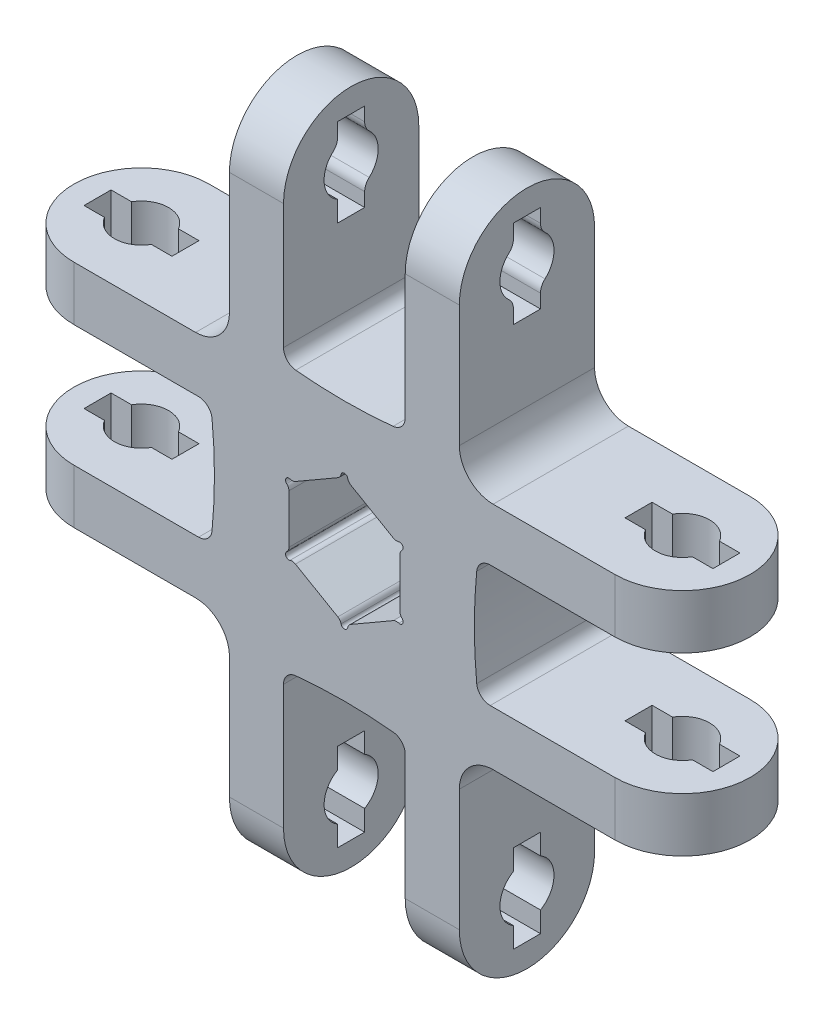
ISO-10303-21;
HEADER;
FILE_DESCRIPTION(('STEP AP214'),'2;1');
FILE_NAME('part.step','',(''),(''),'','','');
FILE_SCHEMA(('AUTOMOTIVE_DESIGN { 1 0 10303 214 1 1 1 1 }'));
ENDSEC;
DATA;
#1=APPLICATION_CONTEXT('core data for automotive mechanical design processes');
#2=APPLICATION_PROTOCOL_DEFINITION('international standard','automotive_design',2000,#1);
#3=PRODUCT_CONTEXT('',#1,'mechanical');
#4=PRODUCT('Part','Part','',(#3));
#5=PRODUCT_RELATED_PRODUCT_CATEGORY('part','',(#4));
#6=PRODUCT_DEFINITION_FORMATION('','',#4);
#7=PRODUCT_DEFINITION_CONTEXT('part definition',#1,'design');
#8=PRODUCT_DEFINITION('design','',#6,#7);
#9=PRODUCT_DEFINITION_SHAPE('','',#8);
#10=(LENGTH_UNIT() NAMED_UNIT(*) SI_UNIT(.MILLI.,.METRE.));
#11=(NAMED_UNIT(*) PLANE_ANGLE_UNIT() SI_UNIT($,.RADIAN.));
#12=(NAMED_UNIT(*) SI_UNIT($,.STERADIAN.) SOLID_ANGLE_UNIT());
#13=UNCERTAINTY_MEASURE_WITH_UNIT(LENGTH_MEASURE(1.E-05),#10,'distance_accuracy_value','');
#14=(GEOMETRIC_REPRESENTATION_CONTEXT(3) GLOBAL_UNCERTAINTY_ASSIGNED_CONTEXT((#13)) GLOBAL_UNIT_ASSIGNED_CONTEXT((#10,
#11,#12)) REPRESENTATION_CONTEXT('',''));
#15=CARTESIAN_POINT('',(0.,0.,0.));
#16=DIRECTION('',(0.,0.,1.));
#17=DIRECTION('',(1.,0.,0.));
#18=AXIS2_PLACEMENT_3D('',#15,#16,#17);
#19=CARTESIAN_POINT('',(0.,8.5,10.));
#20=DIRECTION('',(0.,1.,0.));
#21=DIRECTION('',(0.,0.,1.));
#22=AXIS2_PLACEMENT_3D('',#19,#20,#21);
#23=PLANE('',#22);
#24=DIRECTION('',(0.,0.,-1.));
#25=VECTOR('',#24,1.);
#26=CARTESIAN_POINT('',(-23.25,8.5,10.));
#27=LINE('',#26,#25);
#28=CARTESIAN_POINT('',(-23.25,8.5,6.));
#29=VERTEX_POINT('',#28);
#30=CARTESIAN_POINT('',(-23.25,8.5,4.));
#31=VERTEX_POINT('',#30);
#32=EDGE_CURVE('E1344',#29,#31,#27,.T.);
#33=ORIENTED_EDGE('',*,*,#32,.T.);
#34=DIRECTION('',(1.,0.,0.));
#35=VECTOR('',#34,1.);
#36=CARTESIAN_POINT('',(0.,8.5,4.));
#37=LINE('',#36,#35);
#38=CARTESIAN_POINT('',(-21.7320508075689,8.5,4.));
#39=VERTEX_POINT('',#38);
#40=EDGE_CURVE('E1365',#31,#39,#37,.T.);
#41=ORIENTED_EDGE('',*,*,#40,.T.);
#42=CARTESIAN_POINT('',(-20.,8.5,5.));
#43=DIRECTION('',(0.,1.,0.));
#44=DIRECTION('',(0.,0.,1.));
#45=AXIS2_PLACEMENT_3D('',#42,#43,#44);
#46=CIRCLE('',#45,2.);
#47=CARTESIAN_POINT('',(-18.2679491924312,8.5,4.));
#48=VERTEX_POINT('',#47);
#49=EDGE_CURVE('E1334',#48,#39,#46,.T.);
#50=ORIENTED_EDGE('',*,*,#49,.F.);
#51=DIRECTION('',(1.,0.,0.));
#52=VECTOR('',#51,1.);
#53=CARTESIAN_POINT('',(0.,8.5,4.));
#54=LINE('',#53,#52);
#55=CARTESIAN_POINT('',(-16.75,8.5,4.));
#56=VERTEX_POINT('',#55);
#57=EDGE_CURVE('E1267',#48,#56,#54,.T.);
#58=ORIENTED_EDGE('',*,*,#57,.T.);
#59=DIRECTION('',(0.,0.,-1.));
#60=VECTOR('',#59,1.);
#61=CARTESIAN_POINT('',(-16.75,8.5,10.));
#62=LINE('',#61,#60);
#63=CARTESIAN_POINT('',(-16.75,8.5,6.));
#64=VERTEX_POINT('',#63);
#65=EDGE_CURVE('E1326',#64,#56,#62,.T.);
#66=ORIENTED_EDGE('',*,*,#65,.F.);
#67=DIRECTION('',(1.,0.,0.));
#68=VECTOR('',#67,1.);
#69=CARTESIAN_POINT('',(0.,8.5,6.));
#70=LINE('',#69,#68);
#71=CARTESIAN_POINT('',(-18.2679491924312,8.5,6.));
#72=VERTEX_POINT('',#71);
#73=EDGE_CURVE('E1231',#72,#64,#70,.T.);
#74=ORIENTED_EDGE('',*,*,#73,.F.);
#75=CARTESIAN_POINT('',(-20.,8.5,5.));
#76=DIRECTION('',(0.,1.,0.));
#77=DIRECTION('',(0.,0.,1.));
#78=AXIS2_PLACEMENT_3D('',#75,#76,#77);
#79=CIRCLE('',#78,2.);
#80=CARTESIAN_POINT('',(-21.7320508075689,8.5,6.));
#81=VERTEX_POINT('',#80);
#82=EDGE_CURVE('E1319',#81,#72,#79,.T.);
#83=ORIENTED_EDGE('',*,*,#82,.F.);
#84=DIRECTION('',(1.,0.,0.));
#85=VECTOR('',#84,1.);
#86=CARTESIAN_POINT('',(0.,8.5,6.));
#87=LINE('',#86,#85);
#88=EDGE_CURVE('E1354',#29,#81,#87,.T.);
#89=ORIENTED_EDGE('',*,*,#88,.F.);
#90=EDGE_LOOP('',(#33,#41,#50,#58,#66,#74,#83,#89));
#91=FACE_BOUND('',#90,.T.);
#92=DIRECTION('',(1.,0.,0.));
#93=VECTOR('',#92,1.);
#94=CARTESIAN_POINT('',(0.,8.5,10.));
#95=LINE('',#94,#93);
#96=CARTESIAN_POINT('',(-20.,8.5,10.));
#97=VERTEX_POINT('',#96);
#98=CARTESIAN_POINT('',(-11.,8.5,10.));
#99=VERTEX_POINT('',#98);
#100=EDGE_CURVE('E1502',#97,#99,#95,.T.);
#101=ORIENTED_EDGE('',*,*,#100,.T.);
#102=DIRECTION('',(0.,0.,-1.));
#103=VECTOR('',#102,1.);
#104=CARTESIAN_POINT('',(-11.,8.5,10.));
#105=LINE('',#104,#103);
#106=CARTESIAN_POINT('',(-11.,8.5,0.));
#107=VERTEX_POINT('',#106);
#108=EDGE_CURVE('E1716',#99,#107,#105,.T.);
#109=ORIENTED_EDGE('',*,*,#108,.T.);
#110=DIRECTION('',(1.,0.,0.));
#111=VECTOR('',#110,1.);
#112=CARTESIAN_POINT('',(0.,8.5,0.));
#113=LINE('',#112,#111);
#114=CARTESIAN_POINT('',(-20.,8.5,0.));
#115=VERTEX_POINT('',#114);
#116=EDGE_CURVE('E1565',#115,#107,#113,.T.);
#117=ORIENTED_EDGE('',*,*,#116,.F.);
#118=CARTESIAN_POINT('',(-20.,8.5,5.));
#119=DIRECTION('',(0.,1.,0.));
#120=DIRECTION('',(0.,0.,1.));
#121=AXIS2_PLACEMENT_3D('',#118,#119,#120);
#122=CIRCLE('',#121,5.);
#123=EDGE_CURVE('E1046',#115,#97,#122,.T.);
#124=ORIENTED_EDGE('',*,*,#123,.T.);
#125=EDGE_LOOP('',(#101,#109,#117,#124));
#126=FACE_BOUND('',#125,.T.);
#127=ADVANCED_FACE('F42',(#91,#126),#23,.T.);
#128=CARTESIAN_POINT('',(0.,4.5,10.));
#129=DIRECTION('',(0.,-1.,0.));
#130=DIRECTION('',(1.,0.,0.));
#131=AXIS2_PLACEMENT_3D('',#128,#129,#130);
#132=PLANE('',#131);
#133=CARTESIAN_POINT('',(-20.,4.5,5.));
#134=DIRECTION('',(0.,-1.,0.));
#135=DIRECTION('',(1.,0.,0.));
#136=AXIS2_PLACEMENT_3D('',#133,#134,#135);
#137=CIRCLE('',#136,2.);
#138=CARTESIAN_POINT('',(-21.7320508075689,4.5,4.));
#139=VERTEX_POINT('',#138);
#140=CARTESIAN_POINT('',(-18.2679491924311,4.50000000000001,4.));
#141=VERTEX_POINT('',#140);
#142=EDGE_CURVE('E1331',#139,#141,#137,.T.);
#143=ORIENTED_EDGE('',*,*,#142,.F.);
#144=DIRECTION('',(-1.,0.,0.));
#145=VECTOR('',#144,1.);
#146=CARTESIAN_POINT('',(0.,4.5,4.));
#147=LINE('',#146,#145);
#148=CARTESIAN_POINT('',(-23.25,4.5,4.));
#149=VERTEX_POINT('',#148);
#150=EDGE_CURVE('E1361',#139,#149,#147,.T.);
#151=ORIENTED_EDGE('',*,*,#150,.T.);
#152=DIRECTION('',(0.,0.,1.));
#153=VECTOR('',#152,1.);
#154=CARTESIAN_POINT('',(-23.25,4.5,10.));
#155=LINE('',#154,#153);
#156=CARTESIAN_POINT('',(-23.25,4.5,6.));
#157=VERTEX_POINT('',#156);
#158=EDGE_CURVE('E1340',#149,#157,#155,.T.);
#159=ORIENTED_EDGE('',*,*,#158,.T.);
#160=DIRECTION('',(-1.,0.,0.));
#161=VECTOR('',#160,1.);
#162=CARTESIAN_POINT('',(0.,4.5,6.));
#163=LINE('',#162,#161);
#164=CARTESIAN_POINT('',(-21.7320508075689,4.5,6.));
#165=VERTEX_POINT('',#164);
#166=EDGE_CURVE('E1351',#165,#157,#163,.T.);
#167=ORIENTED_EDGE('',*,*,#166,.F.);
#168=CARTESIAN_POINT('',(-20.,4.5,5.));
#169=DIRECTION('',(0.,-1.,0.));
#170=DIRECTION('',(1.,0.,0.));
#171=AXIS2_PLACEMENT_3D('',#168,#169,#170);
#172=CIRCLE('',#171,2.);
#173=CARTESIAN_POINT('',(-18.2679491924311,4.5,6.));
#174=VERTEX_POINT('',#173);
#175=EDGE_CURVE('E1317',#174,#165,#172,.T.);
#176=ORIENTED_EDGE('',*,*,#175,.F.);
#177=DIRECTION('',(-1.,0.,0.));
#178=VECTOR('',#177,1.);
#179=CARTESIAN_POINT('',(0.,4.5,6.));
#180=LINE('',#179,#178);
#181=CARTESIAN_POINT('',(-16.75,4.5,6.));
#182=VERTEX_POINT('',#181);
#183=EDGE_CURVE('E1228',#182,#174,#180,.T.);
#184=ORIENTED_EDGE('',*,*,#183,.F.);
#185=DIRECTION('',(0.,0.,1.));
#186=VECTOR('',#185,1.);
#187=CARTESIAN_POINT('',(-16.75,4.5,10.));
#188=LINE('',#187,#186);
#189=CARTESIAN_POINT('',(-16.75,4.5,4.));
#190=VERTEX_POINT('',#189);
#191=EDGE_CURVE('E1324',#190,#182,#188,.T.);
#192=ORIENTED_EDGE('',*,*,#191,.F.);
#193=DIRECTION('',(-1.,0.,0.));
#194=VECTOR('',#193,1.);
#195=CARTESIAN_POINT('',(0.,4.5,4.));
#196=LINE('',#195,#194);
#197=EDGE_CURVE('E1264',#190,#141,#196,.T.);
#198=ORIENTED_EDGE('',*,*,#197,.T.);
#199=EDGE_LOOP('',(#143,#151,#159,#167,#176,#184,#192,#198));
#200=FACE_BOUND('',#199,.T.);
#201=DIRECTION('',(-1.,0.,0.));
#202=VECTOR('',#201,1.);
#203=CARTESIAN_POINT('',(0.,4.5,0.));
#204=LINE('',#203,#202);
#205=CARTESIAN_POINT('',(-10.7797831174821,4.5,0.));
#206=VERTEX_POINT('',#205);
#207=CARTESIAN_POINT('',(-20.,4.5,0.));
#208=VERTEX_POINT('',#207);
#209=EDGE_CURVE('E1569',#206,#208,#204,.T.);
#210=ORIENTED_EDGE('',*,*,#209,.F.);
#211=DIRECTION('',(0.,0.,-1.));
#212=VECTOR('',#211,1.);
#213=CARTESIAN_POINT('',(-10.7797831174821,4.5,10.));
#214=LINE('',#213,#212);
#215=CARTESIAN_POINT('',(-10.7797831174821,4.5,10.));
#216=VERTEX_POINT('',#215);
#217=EDGE_CURVE('E1802',#206,#216,#214,.F.);
#218=ORIENTED_EDGE('',*,*,#217,.T.);
#219=DIRECTION('',(-1.,0.,0.));
#220=VECTOR('',#219,1.);
#221=CARTESIAN_POINT('',(0.,4.5,10.));
#222=LINE('',#221,#220);
#223=CARTESIAN_POINT('',(-20.,4.5,10.));
#224=VERTEX_POINT('',#223);
#225=EDGE_CURVE('E1507',#216,#224,#222,.T.);
#226=ORIENTED_EDGE('',*,*,#225,.T.);
#227=CARTESIAN_POINT('',(-20.,4.5,5.));
#228=DIRECTION('',(0.,-1.,0.));
#229=DIRECTION('',(1.,0.,0.));
#230=AXIS2_PLACEMENT_3D('',#227,#228,#229);
#231=CIRCLE('',#230,5.);
#232=EDGE_CURVE('E1042',#224,#208,#231,.T.);
#233=ORIENTED_EDGE('',*,*,#232,.T.);
#234=EDGE_LOOP('',(#210,#218,#226,#233));
#235=FACE_BOUND('',#234,.T.);
#236=ADVANCED_FACE('F2150',(#200,#235),#132,.T.);
#237=CARTESIAN_POINT('',(0.,-4.5,10.));
#238=DIRECTION('',(0.,1.,0.));
#239=DIRECTION('',(-1.,0.,0.));
#240=AXIS2_PLACEMENT_3D('',#237,#238,#239);
#241=PLANE('',#240);
#242=DIRECTION('',(0.,0.,-1.));
#243=VECTOR('',#242,1.);
#244=CARTESIAN_POINT('',(-23.25,-4.5,10.));
#245=LINE('',#244,#243);
#246=CARTESIAN_POINT('',(-23.25,-4.5,6.));
#247=VERTEX_POINT('',#246);
#248=CARTESIAN_POINT('',(-23.25,-4.5,4.));
#249=VERTEX_POINT('',#248);
#250=EDGE_CURVE('E1337',#247,#249,#245,.T.);
#251=ORIENTED_EDGE('',*,*,#250,.T.);
#252=DIRECTION('',(1.,0.,0.));
#253=VECTOR('',#252,1.);
#254=CARTESIAN_POINT('',(0.,-4.5,4.));
#255=LINE('',#254,#253);
#256=CARTESIAN_POINT('',(-21.7320508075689,-4.5,4.));
#257=VERTEX_POINT('',#256);
#258=EDGE_CURVE('E1358',#249,#257,#255,.T.);
#259=ORIENTED_EDGE('',*,*,#258,.T.);
#260=CARTESIAN_POINT('',(-20.,-4.5,5.));
#261=DIRECTION('',(0.,1.,0.));
#262=DIRECTION('',(-1.,0.,0.));
#263=AXIS2_PLACEMENT_3D('',#260,#261,#262);
#264=CIRCLE('',#263,2.);
#265=CARTESIAN_POINT('',(-18.2679491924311,-4.5,4.));
#266=VERTEX_POINT('',#265);
#267=EDGE_CURVE('E1329',#266,#257,#264,.T.);
#268=ORIENTED_EDGE('',*,*,#267,.F.);
#269=DIRECTION('',(1.,0.,0.));
#270=VECTOR('',#269,1.);
#271=CARTESIAN_POINT('',(0.,-4.5,4.));
#272=LINE('',#271,#270);
#273=CARTESIAN_POINT('',(-16.75,-4.5,4.));
#274=VERTEX_POINT('',#273);
#275=EDGE_CURVE('E1261',#266,#274,#272,.T.);
#276=ORIENTED_EDGE('',*,*,#275,.T.);
#277=DIRECTION('',(0.,0.,-1.));
#278=VECTOR('',#277,1.);
#279=CARTESIAN_POINT('',(-16.75,-4.5,10.));
#280=LINE('',#279,#278);
#281=CARTESIAN_POINT('',(-16.75,-4.5,6.));
#282=VERTEX_POINT('',#281);
#283=EDGE_CURVE('E1322',#282,#274,#280,.T.);
#284=ORIENTED_EDGE('',*,*,#283,.F.);
#285=DIRECTION('',(1.,0.,0.));
#286=VECTOR('',#285,1.);
#287=CARTESIAN_POINT('',(0.,-4.5,6.));
#288=LINE('',#287,#286);
#289=CARTESIAN_POINT('',(-18.2679491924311,-4.5,6.));
#290=VERTEX_POINT('',#289);
#291=EDGE_CURVE('E1226',#290,#282,#288,.T.);
#292=ORIENTED_EDGE('',*,*,#291,.F.);
#293=CARTESIAN_POINT('',(-20.,-4.5,5.));
#294=DIRECTION('',(0.,1.,0.));
#295=DIRECTION('',(-1.,0.,0.));
#296=AXIS2_PLACEMENT_3D('',#293,#294,#295);
#297=CIRCLE('',#296,2.);
#298=CARTESIAN_POINT('',(-21.7320508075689,-4.5,5.99999999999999));
#299=VERTEX_POINT('',#298);
#300=EDGE_CURVE('E1315',#299,#290,#297,.T.);
#301=ORIENTED_EDGE('',*,*,#300,.F.);
#302=DIRECTION('',(1.,0.,0.));
#303=VECTOR('',#302,1.);
#304=CARTESIAN_POINT('',(0.,-4.5,6.));
#305=LINE('',#304,#303);
#306=EDGE_CURVE('E1348',#247,#299,#305,.T.);
#307=ORIENTED_EDGE('',*,*,#306,.F.);
#308=EDGE_LOOP('',(#251,#259,#268,#276,#284,#292,#301,#307));
#309=FACE_BOUND('',#308,.T.);
#310=DIRECTION('',(1.,0.,0.));
#311=VECTOR('',#310,1.);
#312=CARTESIAN_POINT('',(0.,-4.5,10.));
#313=LINE('',#312,#311);
#314=CARTESIAN_POINT('',(-20.,-4.5,10.));
#315=VERTEX_POINT('',#314);
#316=CARTESIAN_POINT('',(-10.7797831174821,-4.5,10.));
#317=VERTEX_POINT('',#316);
#318=EDGE_CURVE('E1512',#315,#317,#313,.T.);
#319=ORIENTED_EDGE('',*,*,#318,.T.);
#320=DIRECTION('',(0.,0.,-1.));
#321=VECTOR('',#320,1.);
#322=CARTESIAN_POINT('',(-10.7797831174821,-4.5,10.));
#323=LINE('',#322,#321);
#324=CARTESIAN_POINT('',(-10.7797831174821,-4.5,0.));
#325=VERTEX_POINT('',#324);
#326=EDGE_CURVE('E1794',#317,#325,#323,.T.);
#327=ORIENTED_EDGE('',*,*,#326,.T.);
#328=DIRECTION('',(1.,0.,0.));
#329=VECTOR('',#328,1.);
#330=CARTESIAN_POINT('',(0.,-4.5,0.));
#331=LINE('',#330,#329);
#332=CARTESIAN_POINT('',(-20.,-4.5,0.));
#333=VERTEX_POINT('',#332);
#334=EDGE_CURVE('E1575',#333,#325,#331,.T.);
#335=ORIENTED_EDGE('',*,*,#334,.F.);
#336=CARTESIAN_POINT('',(-20.,-4.5,5.));
#337=DIRECTION('',(0.,1.,0.));
#338=DIRECTION('',(-1.,0.,0.));
#339=AXIS2_PLACEMENT_3D('',#336,#337,#338);
#340=CIRCLE('',#339,5.);
#341=EDGE_CURVE('E1039',#333,#315,#340,.T.);
#342=ORIENTED_EDGE('',*,*,#341,.T.);
#343=EDGE_LOOP('',(#319,#327,#335,#342));
#344=FACE_BOUND('',#343,.T.);
#345=ADVANCED_FACE('F2169',(#309,#344),#241,.T.);
#346=CARTESIAN_POINT('',(0.,-8.50000000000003,10.));
#347=DIRECTION('',(0.,-1.,0.));
#348=DIRECTION('',(1.,0.,0.));
#349=AXIS2_PLACEMENT_3D('',#346,#347,#348);
#350=PLANE('',#349);
#351=CARTESIAN_POINT('',(-20.,-8.49999999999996,5.));
#352=DIRECTION('',(0.,-1.,0.));
#353=DIRECTION('',(1.,0.,0.));
#354=AXIS2_PLACEMENT_3D('',#351,#352,#353);
#355=CIRCLE('',#354,2.);
#356=CARTESIAN_POINT('',(-21.7320508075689,-8.49999999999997,4.));
#357=VERTEX_POINT('',#356);
#358=CARTESIAN_POINT('',(-18.2679491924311,-8.49999999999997,4.));
#359=VERTEX_POINT('',#358);
#360=EDGE_CURVE('E1698',#357,#359,#355,.T.);
#361=ORIENTED_EDGE('',*,*,#360,.F.);
#362=DIRECTION('',(-1.,0.,0.));
#363=VECTOR('',#362,1.);
#364=CARTESIAN_POINT('',(0.,-8.50000000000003,4.));
#365=LINE('',#364,#363);
#366=CARTESIAN_POINT('',(-23.25,-8.49999999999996,4.));
#367=VERTEX_POINT('',#366);
#368=EDGE_CURVE('E1703',#357,#367,#365,.T.);
#369=ORIENTED_EDGE('',*,*,#368,.T.);
#370=DIRECTION('',(0.,0.,1.));
#371=VECTOR('',#370,1.);
#372=CARTESIAN_POINT('',(-23.25,-8.49999999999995,10.));
#373=LINE('',#372,#371);
#374=CARTESIAN_POINT('',(-23.25,-8.49999999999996,6.));
#375=VERTEX_POINT('',#374);
#376=EDGE_CURVE('E1700',#367,#375,#373,.T.);
#377=ORIENTED_EDGE('',*,*,#376,.T.);
#378=DIRECTION('',(-1.,0.,0.));
#379=VECTOR('',#378,1.);
#380=CARTESIAN_POINT('',(0.,-8.50000000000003,6.));
#381=LINE('',#380,#379);
#382=CARTESIAN_POINT('',(-21.7320508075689,-8.49999999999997,6.));
#383=VERTEX_POINT('',#382);
#384=EDGE_CURVE('E1696',#383,#375,#381,.T.);
#385=ORIENTED_EDGE('',*,*,#384,.F.);
#386=CARTESIAN_POINT('',(-20.,-8.49999999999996,5.));
#387=DIRECTION('',(0.,-1.,0.));
#388=DIRECTION('',(1.,0.,0.));
#389=AXIS2_PLACEMENT_3D('',#386,#387,#388);
#390=CIRCLE('',#389,2.);
#391=CARTESIAN_POINT('',(-18.2679491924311,-8.49999999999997,6.00000000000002));
#392=VERTEX_POINT('',#391);
#393=EDGE_CURVE('E1692',#392,#383,#390,.T.);
#394=ORIENTED_EDGE('',*,*,#393,.F.);
#395=DIRECTION('',(-1.,0.,0.));
#396=VECTOR('',#395,1.);
#397=CARTESIAN_POINT('',(0.,-8.50000000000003,6.));
#398=LINE('',#397,#396);
#399=CARTESIAN_POINT('',(-16.75,-8.49999999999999,6.));
#400=VERTEX_POINT('',#399);
#401=EDGE_CURVE('E1223',#400,#392,#398,.T.);
#402=ORIENTED_EDGE('',*,*,#401,.F.);
#403=DIRECTION('',(0.,0.,1.));
#404=VECTOR('',#403,1.);
#405=CARTESIAN_POINT('',(-16.75,-8.49999999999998,10.));
#406=LINE('',#405,#404);
#407=CARTESIAN_POINT('',(-16.75,-8.49999999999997,4.));
#408=VERTEX_POINT('',#407);
#409=EDGE_CURVE('E1694',#408,#400,#406,.T.);
#410=ORIENTED_EDGE('',*,*,#409,.F.);
#411=DIRECTION('',(-1.,0.,0.));
#412=VECTOR('',#411,1.);
#413=CARTESIAN_POINT('',(0.,-8.50000000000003,4.));
#414=LINE('',#413,#412);
#415=EDGE_CURVE('E1258',#408,#359,#414,.T.);
#416=ORIENTED_EDGE('',*,*,#415,.T.);
#417=EDGE_LOOP('',(#361,#369,#377,#385,#394,#402,#410,#416));
#418=FACE_BOUND('',#417,.T.);
#419=DIRECTION('',(-1.,0.,0.));
#420=VECTOR('',#419,1.);
#421=CARTESIAN_POINT('',(0.,-8.50000000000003,0.));
#422=LINE('',#421,#420);
#423=CARTESIAN_POINT('',(-11.,-8.49999999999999,0.));
#424=VERTEX_POINT('',#423);
#425=CARTESIAN_POINT('',(-20.,-8.5,0.));
#426=VERTEX_POINT('',#425);
#427=EDGE_CURVE('E1578',#424,#426,#422,.T.);
#428=ORIENTED_EDGE('',*,*,#427,.F.);
#429=DIRECTION('',(0.,0.,-1.));
#430=VECTOR('',#429,1.);
#431=CARTESIAN_POINT('',(-11.,-8.49999999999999,10.));
#432=LINE('',#431,#430);
#433=CARTESIAN_POINT('',(-11.,-8.49999999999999,10.));
#434=VERTEX_POINT('',#433);
#435=EDGE_CURVE('E1737',#424,#434,#432,.F.);
#436=ORIENTED_EDGE('',*,*,#435,.T.);
#437=DIRECTION('',(-1.,0.,0.));
#438=VECTOR('',#437,1.);
#439=CARTESIAN_POINT('',(0.,-8.50000000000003,10.));
#440=LINE('',#439,#438);
#441=CARTESIAN_POINT('',(-20.,-8.5,10.));
#442=VERTEX_POINT('',#441);
#443=EDGE_CURVE('E1515',#434,#442,#440,.T.);
#444=ORIENTED_EDGE('',*,*,#443,.T.);
#445=CARTESIAN_POINT('',(-20.,-8.49999999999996,5.));
#446=DIRECTION('',(0.,-1.,0.));
#447=DIRECTION('',(1.,0.,0.));
#448=AXIS2_PLACEMENT_3D('',#445,#446,#447);
#449=CIRCLE('',#448,5.);
#450=EDGE_CURVE('E1036',#442,#426,#449,.T.);
#451=ORIENTED_EDGE('',*,*,#450,.T.);
#452=EDGE_LOOP('',(#428,#436,#444,#451));
#453=FACE_BOUND('',#452,.T.);
#454=ADVANCED_FACE('F2179',(#418,#453),#350,.T.);
#455=CARTESIAN_POINT('',(-8.5,0.,10.));
#456=DIRECTION('',(-1.,0.,0.));
#457=DIRECTION('',(0.,0.,1.));
#458=AXIS2_PLACEMENT_3D('',#455,#456,#457);
#459=PLANE('',#458);
#460=CARTESIAN_POINT('',(-8.5,-20.,5.));
#461=DIRECTION('',(-1.,0.,0.));
#462=DIRECTION('',(0.,0.,1.));
#463=AXIS2_PLACEMENT_3D('',#460,#461,#462);
#464=CIRCLE('',#463,2.);
#465=CARTESIAN_POINT('',(-8.5,-18.2679491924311,4.));
#466=VERTEX_POINT('',#465);
#467=CARTESIAN_POINT('',(-8.5,-21.7320508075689,4.));
#468=VERTEX_POINT('',#467);
#469=EDGE_CURVE('E1287',#466,#468,#464,.T.);
#470=ORIENTED_EDGE('',*,*,#469,.F.);
#471=DIRECTION('',(0.,1.,0.));
#472=VECTOR('',#471,1.);
#473=CARTESIAN_POINT('',(-8.5,0.,4.));
#474=LINE('',#473,#472);
#475=CARTESIAN_POINT('',(-8.5,-16.75,4.));
#476=VERTEX_POINT('',#475);
#477=EDGE_CURVE('E1255',#466,#476,#474,.T.);
#478=ORIENTED_EDGE('',*,*,#477,.T.);
#479=DIRECTION('',(0.,0.,-1.));
#480=VECTOR('',#479,1.);
#481=CARTESIAN_POINT('',(-8.5,-16.75,10.));
#482=LINE('',#481,#480);
#483=CARTESIAN_POINT('',(-8.5,-16.75,6.));
#484=VERTEX_POINT('',#483);
#485=EDGE_CURVE('E1281',#484,#476,#482,.T.);
#486=ORIENTED_EDGE('',*,*,#485,.F.);
#487=DIRECTION('',(0.,1.,0.));
#488=VECTOR('',#487,1.);
#489=CARTESIAN_POINT('',(-8.5,0.,6.));
#490=LINE('',#489,#488);
#491=CARTESIAN_POINT('',(-8.5,-18.2679491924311,6.));
#492=VERTEX_POINT('',#491);
#493=EDGE_CURVE('E1221',#492,#484,#490,.T.);
#494=ORIENTED_EDGE('',*,*,#493,.F.);
#495=CARTESIAN_POINT('',(-8.5,-20.,5.));
#496=DIRECTION('',(-1.,0.,0.));
#497=DIRECTION('',(0.,0.,1.));
#498=AXIS2_PLACEMENT_3D('',#495,#496,#497);
#499=CIRCLE('',#498,2.);
#500=CARTESIAN_POINT('',(-8.5,-21.7320508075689,6.));
#501=VERTEX_POINT('',#500);
#502=EDGE_CURVE('E1275',#501,#492,#499,.T.);
#503=ORIENTED_EDGE('',*,*,#502,.F.);
#504=DIRECTION('',(0.,1.,0.));
#505=VECTOR('',#504,1.);
#506=CARTESIAN_POINT('',(-8.5,0.,6.));
#507=LINE('',#506,#505);
#508=CARTESIAN_POINT('',(-8.5,-23.25,6.));
#509=VERTEX_POINT('',#508);
#510=EDGE_CURVE('E1303',#509,#501,#507,.T.);
#511=ORIENTED_EDGE('',*,*,#510,.F.);
#512=DIRECTION('',(0.,0.,-1.));
#513=VECTOR('',#512,1.);
#514=CARTESIAN_POINT('',(-8.5,-23.25,10.));
#515=LINE('',#514,#513);
#516=CARTESIAN_POINT('',(-8.5,-23.25,4.));
#517=VERTEX_POINT('',#516);
#518=EDGE_CURVE('E1295',#509,#517,#515,.T.);
#519=ORIENTED_EDGE('',*,*,#518,.T.);
#520=DIRECTION('',(0.,1.,0.));
#521=VECTOR('',#520,1.);
#522=CARTESIAN_POINT('',(-8.5,0.,4.));
#523=LINE('',#522,#521);
#524=EDGE_CURVE('E1312',#517,#468,#523,.T.);
#525=ORIENTED_EDGE('',*,*,#524,.T.);
#526=EDGE_LOOP('',(#470,#478,#486,#494,#503,#511,#519,#525));
#527=FACE_BOUND('',#526,.T.);
#528=DIRECTION('',(0.,1.,0.));
#529=VECTOR('',#528,1.);
#530=CARTESIAN_POINT('',(-8.5,0.,10.));
#531=LINE('',#530,#529);
#532=CARTESIAN_POINT('',(-8.5,-20.,10.));
#533=VERTEX_POINT('',#532);
#534=CARTESIAN_POINT('',(-8.5,-11.,10.));
#535=VERTEX_POINT('',#534);
#536=EDGE_CURVE('E1517',#533,#535,#531,.T.);
#537=ORIENTED_EDGE('',*,*,#536,.T.);
#538=DIRECTION('',(0.,0.,-1.));
#539=VECTOR('',#538,1.);
#540=CARTESIAN_POINT('',(-8.5,-11.,0.));
#541=LINE('',#540,#539);
#542=CARTESIAN_POINT('',(-8.5,-11.,0.));
#543=VERTEX_POINT('',#542);
#544=EDGE_CURVE('E1734',#535,#543,#541,.T.);
#545=ORIENTED_EDGE('',*,*,#544,.T.);
#546=DIRECTION('',(0.,1.,0.));
#547=VECTOR('',#546,1.);
#548=CARTESIAN_POINT('',(-8.5,0.,0.));
#549=LINE('',#548,#547);
#550=CARTESIAN_POINT('',(-8.5,-20.,0.));
#551=VERTEX_POINT('',#550);
#552=EDGE_CURVE('E1580',#551,#543,#549,.T.);
#553=ORIENTED_EDGE('',*,*,#552,.F.);
#554=CARTESIAN_POINT('',(-8.5,-20.,5.));
#555=DIRECTION('',(-1.,0.,0.));
#556=DIRECTION('',(0.,0.,1.));
#557=AXIS2_PLACEMENT_3D('',#554,#555,#556);
#558=CIRCLE('',#557,5.);
#559=EDGE_CURVE('E1033',#551,#533,#558,.T.);
#560=ORIENTED_EDGE('',*,*,#559,.T.);
#561=EDGE_LOOP('',(#537,#545,#553,#560));
#562=FACE_BOUND('',#561,.T.);
#563=ADVANCED_FACE('F2187',(#527,#562),#459,.T.);
#564=CARTESIAN_POINT('',(-4.5,0.,10.));
#565=DIRECTION('',(1.,0.,0.));
#566=DIRECTION('',(0.,0.,-1.));
#567=AXIS2_PLACEMENT_3D('',#564,#565,#566);
#568=PLANE('',#567);
#569=CARTESIAN_POINT('',(-4.5,-20.,5.));
#570=DIRECTION('',(1.,0.,0.));
#571=DIRECTION('',(0.,0.,-1.));
#572=AXIS2_PLACEMENT_3D('',#569,#570,#571);
#573=CIRCLE('',#572,2.);
#574=CARTESIAN_POINT('',(-4.5,-21.7320508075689,4.));
#575=VERTEX_POINT('',#574);
#576=CARTESIAN_POINT('',(-4.5,-18.2679491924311,4.));
#577=VERTEX_POINT('',#576);
#578=EDGE_CURVE('E1285',#575,#577,#573,.T.);
#579=ORIENTED_EDGE('',*,*,#578,.F.);
#580=DIRECTION('',(0.,-1.,0.));
#581=VECTOR('',#580,1.);
#582=CARTESIAN_POINT('',(-4.5,0.,4.));
#583=LINE('',#582,#581);
#584=CARTESIAN_POINT('',(-4.5,-23.25,4.));
#585=VERTEX_POINT('',#584);
#586=EDGE_CURVE('E1309',#575,#585,#583,.T.);
#587=ORIENTED_EDGE('',*,*,#586,.T.);
#588=DIRECTION('',(0.,0.,1.));
#589=VECTOR('',#588,1.);
#590=CARTESIAN_POINT('',(-4.5,-23.25,10.));
#591=LINE('',#590,#589);
#592=CARTESIAN_POINT('',(-4.5,-23.25,6.));
#593=VERTEX_POINT('',#592);
#594=EDGE_CURVE('E1292',#585,#593,#591,.T.);
#595=ORIENTED_EDGE('',*,*,#594,.T.);
#596=DIRECTION('',(0.,-1.,0.));
#597=VECTOR('',#596,1.);
#598=CARTESIAN_POINT('',(-4.5,0.,6.));
#599=LINE('',#598,#597);
#600=CARTESIAN_POINT('',(-4.5,-21.7320508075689,6.));
#601=VERTEX_POINT('',#600);
#602=EDGE_CURVE('E1301',#601,#593,#599,.T.);
#603=ORIENTED_EDGE('',*,*,#602,.F.);
#604=CARTESIAN_POINT('',(-4.5,-20.,5.));
#605=DIRECTION('',(1.,0.,0.));
#606=DIRECTION('',(0.,0.,-1.));
#607=AXIS2_PLACEMENT_3D('',#604,#605,#606);
#608=CIRCLE('',#607,2.);
#609=CARTESIAN_POINT('',(-4.5,-18.2679491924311,6.));
#610=VERTEX_POINT('',#609);
#611=EDGE_CURVE('E1273',#610,#601,#608,.T.);
#612=ORIENTED_EDGE('',*,*,#611,.F.);
#613=DIRECTION('',(0.,-1.,0.));
#614=VECTOR('',#613,1.);
#615=CARTESIAN_POINT('',(-4.5,0.,6.));
#616=LINE('',#615,#614);
#617=CARTESIAN_POINT('',(-4.5,-16.75,6.));
#618=VERTEX_POINT('',#617);
#619=EDGE_CURVE('E1218',#618,#610,#616,.T.);
#620=ORIENTED_EDGE('',*,*,#619,.F.);
#621=DIRECTION('',(0.,0.,1.));
#622=VECTOR('',#621,1.);
#623=CARTESIAN_POINT('',(-4.5,-16.75,10.));
#624=LINE('',#623,#622);
#625=CARTESIAN_POINT('',(-4.5,-16.75,4.));
#626=VERTEX_POINT('',#625);
#627=EDGE_CURVE('E1279',#626,#618,#624,.T.);
#628=ORIENTED_EDGE('',*,*,#627,.F.);
#629=DIRECTION('',(0.,-1.,0.));
#630=VECTOR('',#629,1.);
#631=CARTESIAN_POINT('',(-4.5,0.,4.));
#632=LINE('',#631,#630);
#633=EDGE_CURVE('E1252',#626,#577,#632,.T.);
#634=ORIENTED_EDGE('',*,*,#633,.T.);
#635=EDGE_LOOP('',(#579,#587,#595,#603,#612,#620,#628,#634));
#636=FACE_BOUND('',#635,.T.);
#637=DIRECTION('',(0.,-1.,0.));
#638=VECTOR('',#637,1.);
#639=CARTESIAN_POINT('',(-4.5,0.,0.));
#640=LINE('',#639,#638);
#641=CARTESIAN_POINT('',(-4.5,-10.7797831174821,0.));
#642=VERTEX_POINT('',#641);
#643=CARTESIAN_POINT('',(-4.5,-20.,0.));
#644=VERTEX_POINT('',#643);
#645=EDGE_CURVE('E1582',#642,#644,#640,.T.);
#646=ORIENTED_EDGE('',*,*,#645,.F.);
#647=DIRECTION('',(0.,0.,-1.));
#648=VECTOR('',#647,1.);
#649=CARTESIAN_POINT('',(-4.5,-10.7797831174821,10.));
#650=LINE('',#649,#648);
#651=CARTESIAN_POINT('',(-4.5,-10.7797831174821,10.));
#652=VERTEX_POINT('',#651);
#653=EDGE_CURVE('E1766',#642,#652,#650,.F.);
#654=ORIENTED_EDGE('',*,*,#653,.T.);
#655=DIRECTION('',(0.,-1.,0.));
#656=VECTOR('',#655,1.);
#657=CARTESIAN_POINT('',(-4.5,0.,10.));
#658=LINE('',#657,#656);
#659=CARTESIAN_POINT('',(-4.5,-20.,10.));
#660=VERTEX_POINT('',#659);
#661=EDGE_CURVE('E1520',#652,#660,#658,.T.);
#662=ORIENTED_EDGE('',*,*,#661,.T.);
#663=CARTESIAN_POINT('',(-4.5,-20.,5.));
#664=DIRECTION('',(1.,0.,0.));
#665=DIRECTION('',(0.,0.,-1.));
#666=AXIS2_PLACEMENT_3D('',#663,#664,#665);
#667=CIRCLE('',#666,5.);
#668=EDGE_CURVE('E1030',#660,#644,#667,.T.);
#669=ORIENTED_EDGE('',*,*,#668,.T.);
#670=EDGE_LOOP('',(#646,#654,#662,#669));
#671=FACE_BOUND('',#670,.T.);
#672=ADVANCED_FACE('F2198',(#636,#671),#568,.T.);
#673=CARTESIAN_POINT('',(4.5,0.,10.));
#674=DIRECTION('',(-1.,0.,0.));
#675=DIRECTION('',(0.,-1.,0.));
#676=AXIS2_PLACEMENT_3D('',#673,#674,#675);
#677=PLANE('',#676);
#678=CARTESIAN_POINT('',(4.5,-20.,5.));
#679=DIRECTION('',(-1.,0.,0.));
#680=DIRECTION('',(0.,-1.,0.));
#681=AXIS2_PLACEMENT_3D('',#678,#679,#680);
#682=CIRCLE('',#681,2.);
#683=CARTESIAN_POINT('',(4.5,-18.2679491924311,4.));
#684=VERTEX_POINT('',#683);
#685=CARTESIAN_POINT('',(4.5,-21.7320508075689,4.));
#686=VERTEX_POINT('',#685);
#687=EDGE_CURVE('E1283',#684,#686,#682,.T.);
#688=ORIENTED_EDGE('',*,*,#687,.F.);
#689=DIRECTION('',(0.,1.,0.));
#690=VECTOR('',#689,1.);
#691=CARTESIAN_POINT('',(4.5,0.,4.));
#692=LINE('',#691,#690);
#693=CARTESIAN_POINT('',(4.5,-16.75,4.));
#694=VERTEX_POINT('',#693);
#695=EDGE_CURVE('E1249',#684,#694,#692,.T.);
#696=ORIENTED_EDGE('',*,*,#695,.T.);
#697=DIRECTION('',(0.,0.,-1.));
#698=VECTOR('',#697,1.);
#699=CARTESIAN_POINT('',(4.5,-16.75,10.));
#700=LINE('',#699,#698);
#701=CARTESIAN_POINT('',(4.5,-16.75,6.));
#702=VERTEX_POINT('',#701);
#703=EDGE_CURVE('E1277',#702,#694,#700,.T.);
#704=ORIENTED_EDGE('',*,*,#703,.F.);
#705=DIRECTION('',(0.,1.,0.));
#706=VECTOR('',#705,1.);
#707=CARTESIAN_POINT('',(4.5,0.,6.));
#708=LINE('',#707,#706);
#709=CARTESIAN_POINT('',(4.5,-18.2679491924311,6.));
#710=VERTEX_POINT('',#709);
#711=EDGE_CURVE('E1216',#710,#702,#708,.T.);
#712=ORIENTED_EDGE('',*,*,#711,.F.);
#713=CARTESIAN_POINT('',(4.5,-20.,5.));
#714=DIRECTION('',(-1.,0.,0.));
#715=DIRECTION('',(0.,-1.,0.));
#716=AXIS2_PLACEMENT_3D('',#713,#714,#715);
#717=CIRCLE('',#716,2.);
#718=CARTESIAN_POINT('',(4.5,-21.7320508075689,6.));
#719=VERTEX_POINT('',#718);
#720=EDGE_CURVE('E1271',#719,#710,#717,.T.);
#721=ORIENTED_EDGE('',*,*,#720,.F.);
#722=DIRECTION('',(0.,1.,0.));
#723=VECTOR('',#722,1.);
#724=CARTESIAN_POINT('',(4.5,0.,6.));
#725=LINE('',#724,#723);
#726=CARTESIAN_POINT('',(4.5,-23.25,6.));
#727=VERTEX_POINT('',#726);
#728=EDGE_CURVE('E1298',#727,#719,#725,.T.);
#729=ORIENTED_EDGE('',*,*,#728,.F.);
#730=DIRECTION('',(0.,0.,-1.));
#731=VECTOR('',#730,1.);
#732=CARTESIAN_POINT('',(4.5,-23.25,10.));
#733=LINE('',#732,#731);
#734=CARTESIAN_POINT('',(4.5,-23.25,4.));
#735=VERTEX_POINT('',#734);
#736=EDGE_CURVE('E1289',#727,#735,#733,.T.);
#737=ORIENTED_EDGE('',*,*,#736,.T.);
#738=DIRECTION('',(0.,1.,0.));
#739=VECTOR('',#738,1.);
#740=CARTESIAN_POINT('',(4.5,0.,4.));
#741=LINE('',#740,#739);
#742=EDGE_CURVE('E1306',#735,#686,#741,.T.);
#743=ORIENTED_EDGE('',*,*,#742,.T.);
#744=EDGE_LOOP('',(#688,#696,#704,#712,#721,#729,#737,#743));
#745=FACE_BOUND('',#744,.T.);
#746=DIRECTION('',(0.,1.,0.));
#747=VECTOR('',#746,1.);
#748=CARTESIAN_POINT('',(4.5,0.,10.));
#749=LINE('',#748,#747);
#750=CARTESIAN_POINT('',(4.5,-20.,10.));
#751=VERTEX_POINT('',#750);
#752=CARTESIAN_POINT('',(4.5,-10.7797831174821,10.));
#753=VERTEX_POINT('',#752);
#754=EDGE_CURVE('E1525',#751,#753,#749,.T.);
#755=ORIENTED_EDGE('',*,*,#754,.T.);
#756=DIRECTION('',(0.,0.,-1.));
#757=VECTOR('',#756,1.);
#758=CARTESIAN_POINT('',(4.5,-10.7797831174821,10.));
#759=LINE('',#758,#757);
#760=CARTESIAN_POINT('',(4.5,-10.7797831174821,0.));
#761=VERTEX_POINT('',#760);
#762=EDGE_CURVE('E1758',#753,#761,#759,.T.);
#763=ORIENTED_EDGE('',*,*,#762,.T.);
#764=DIRECTION('',(0.,1.,0.));
#765=VECTOR('',#764,1.);
#766=CARTESIAN_POINT('',(4.5,0.,0.));
#767=LINE('',#766,#765);
#768=CARTESIAN_POINT('',(4.5,-20.,0.));
#769=VERTEX_POINT('',#768);
#770=EDGE_CURVE('E1587',#769,#761,#767,.T.);
#771=ORIENTED_EDGE('',*,*,#770,.F.);
#772=CARTESIAN_POINT('',(4.5,-20.,5.));
#773=DIRECTION('',(-1.,0.,0.));
#774=DIRECTION('',(0.,-1.,0.));
#775=AXIS2_PLACEMENT_3D('',#772,#773,#774);
#776=CIRCLE('',#775,5.);
#777=EDGE_CURVE('E1027',#769,#751,#776,.T.);
#778=ORIENTED_EDGE('',*,*,#777,.T.);
#779=EDGE_LOOP('',(#755,#763,#771,#778));
#780=FACE_BOUND('',#779,.T.);
#781=ADVANCED_FACE('F2215',(#745,#780),#677,.T.);
#782=CARTESIAN_POINT('',(8.50000000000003,0.,10.));
#783=DIRECTION('',(1.,0.,0.));
#784=DIRECTION('',(0.,1.,0.));
#785=AXIS2_PLACEMENT_3D('',#782,#783,#784);
#786=PLANE('',#785);
#787=CARTESIAN_POINT('',(8.49999999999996,-20.,5.));
#788=DIRECTION('',(1.,0.,0.));
#789=DIRECTION('',(0.,1.,0.));
#790=AXIS2_PLACEMENT_3D('',#787,#788,#789);
#791=CIRCLE('',#790,2.);
#792=CARTESIAN_POINT('',(8.49999999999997,-21.7320508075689,4.));
#793=VERTEX_POINT('',#792);
#794=CARTESIAN_POINT('',(8.49999999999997,-18.2679491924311,4.));
#795=VERTEX_POINT('',#794);
#796=EDGE_CURVE('E1690',#793,#795,#791,.T.);
#797=ORIENTED_EDGE('',*,*,#796,.F.);
#798=DIRECTION('',(0.,-1.,0.));
#799=VECTOR('',#798,1.);
#800=CARTESIAN_POINT('',(8.50000000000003,0.,4.));
#801=LINE('',#800,#799);
#802=CARTESIAN_POINT('',(8.49999999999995,-23.25,4.));
#803=VERTEX_POINT('',#802);
#804=EDGE_CURVE('E1687',#793,#803,#801,.T.);
#805=ORIENTED_EDGE('',*,*,#804,.T.);
#806=DIRECTION('',(0.,0.,1.));
#807=VECTOR('',#806,1.);
#808=CARTESIAN_POINT('',(8.49999999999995,-23.25,10.));
#809=LINE('',#808,#807);
#810=CARTESIAN_POINT('',(8.49999999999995,-23.25,6.));
#811=VERTEX_POINT('',#810);
#812=EDGE_CURVE('E1684',#803,#811,#809,.T.);
#813=ORIENTED_EDGE('',*,*,#812,.T.);
#814=DIRECTION('',(0.,-1.,0.));
#815=VECTOR('',#814,1.);
#816=CARTESIAN_POINT('',(8.50000000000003,0.,6.));
#817=LINE('',#816,#815);
#818=CARTESIAN_POINT('',(8.49999999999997,-21.7320508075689,6.));
#819=VERTEX_POINT('',#818);
#820=EDGE_CURVE('E1680',#819,#811,#817,.T.);
#821=ORIENTED_EDGE('',*,*,#820,.F.);
#822=CARTESIAN_POINT('',(8.49999999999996,-20.,5.));
#823=DIRECTION('',(1.,0.,0.));
#824=DIRECTION('',(0.,1.,0.));
#825=AXIS2_PLACEMENT_3D('',#822,#823,#824);
#826=CIRCLE('',#825,2.);
#827=CARTESIAN_POINT('',(8.49999999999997,-18.2679491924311,6.));
#828=VERTEX_POINT('',#827);
#829=EDGE_CURVE('E1678',#828,#819,#826,.T.);
#830=ORIENTED_EDGE('',*,*,#829,.F.);
#831=DIRECTION('',(0.,-1.,0.));
#832=VECTOR('',#831,1.);
#833=CARTESIAN_POINT('',(8.50000000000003,0.,6.));
#834=LINE('',#833,#832);
#835=CARTESIAN_POINT('',(8.49999999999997,-16.75,6.));
#836=VERTEX_POINT('',#835);
#837=EDGE_CURVE('E1213',#836,#828,#834,.T.);
#838=ORIENTED_EDGE('',*,*,#837,.F.);
#839=DIRECTION('',(0.,0.,1.));
#840=VECTOR('',#839,1.);
#841=CARTESIAN_POINT('',(8.49999999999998,-16.75,10.));
#842=LINE('',#841,#840);
#843=CARTESIAN_POINT('',(8.49999999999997,-16.75,4.));
#844=VERTEX_POINT('',#843);
#845=EDGE_CURVE('E1682',#844,#836,#842,.T.);
#846=ORIENTED_EDGE('',*,*,#845,.F.);
#847=DIRECTION('',(0.,-1.,0.));
#848=VECTOR('',#847,1.);
#849=CARTESIAN_POINT('',(8.50000000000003,0.,4.));
#850=LINE('',#849,#848);
#851=EDGE_CURVE('E1246',#844,#795,#850,.T.);
#852=ORIENTED_EDGE('',*,*,#851,.T.);
#853=EDGE_LOOP('',(#797,#805,#813,#821,#830,#838,#846,#852));
#854=FACE_BOUND('',#853,.T.);
#855=DIRECTION('',(0.,-1.,0.));
#856=VECTOR('',#855,1.);
#857=CARTESIAN_POINT('',(8.50000000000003,0.,0.));
#858=LINE('',#857,#856);
#859=CARTESIAN_POINT('',(8.49999999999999,-11.,0.));
#860=VERTEX_POINT('',#859);
#861=CARTESIAN_POINT('',(8.5,-20.,0.));
#862=VERTEX_POINT('',#861);
#863=EDGE_CURVE('E1590',#860,#862,#858,.T.);
#864=ORIENTED_EDGE('',*,*,#863,.F.);
#865=DIRECTION('',(0.,0.,-1.));
#866=VECTOR('',#865,1.);
#867=CARTESIAN_POINT('',(8.49999999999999,-11.,10.));
#868=LINE('',#867,#866);
#869=CARTESIAN_POINT('',(8.49999999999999,-11.,10.));
#870=VERTEX_POINT('',#869);
#871=EDGE_CURVE('E1732',#860,#870,#868,.F.);
#872=ORIENTED_EDGE('',*,*,#871,.T.);
#873=DIRECTION('',(0.,-1.,0.));
#874=VECTOR('',#873,1.);
#875=CARTESIAN_POINT('',(8.50000000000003,0.,10.));
#876=LINE('',#875,#874);
#877=CARTESIAN_POINT('',(8.5,-20.,10.));
#878=VERTEX_POINT('',#877);
#879=EDGE_CURVE('E1528',#870,#878,#876,.T.);
#880=ORIENTED_EDGE('',*,*,#879,.T.);
#881=CARTESIAN_POINT('',(8.49999999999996,-20.,5.));
#882=DIRECTION('',(1.,0.,0.));
#883=DIRECTION('',(0.,1.,0.));
#884=AXIS2_PLACEMENT_3D('',#881,#882,#883);
#885=CIRCLE('',#884,5.);
#886=EDGE_CURVE('E1024',#878,#862,#885,.T.);
#887=ORIENTED_EDGE('',*,*,#886,.T.);
#888=EDGE_LOOP('',(#864,#872,#880,#887));
#889=FACE_BOUND('',#888,.T.);
#890=ADVANCED_FACE('F2226',(#854,#889),#786,.T.);
#891=CARTESIAN_POINT('',(0.,-8.5,10.));
#892=DIRECTION('',(0.,-1.,0.));
#893=DIRECTION('',(0.,0.,-1.));
#894=AXIS2_PLACEMENT_3D('',#891,#892,#893);
#895=PLANE('',#894);
#896=CARTESIAN_POINT('',(20.0000000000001,-8.50000000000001,5.));
#897=DIRECTION('',(0.,-1.,0.));
#898=DIRECTION('',(0.,0.,-1.));
#899=AXIS2_PLACEMENT_3D('',#896,#897,#898);
#900=CIRCLE('',#899,2.);
#901=CARTESIAN_POINT('',(18.2679491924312,-8.50000000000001,4.));
#902=VERTEX_POINT('',#901);
#903=CARTESIAN_POINT('',(21.732050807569,-8.5,4.));
#904=VERTEX_POINT('',#903);
#905=EDGE_CURVE('E1173',#902,#904,#900,.T.);
#906=ORIENTED_EDGE('',*,*,#905,.F.);
#907=DIRECTION('',(-1.,0.,0.));
#908=VECTOR('',#907,1.);
#909=CARTESIAN_POINT('',(0.,-8.5,4.));
#910=LINE('',#909,#908);
#911=CARTESIAN_POINT('',(16.7500000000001,-8.5,4.));
#912=VERTEX_POINT('',#911);
#913=EDGE_CURVE('E1242',#902,#912,#910,.T.);
#914=ORIENTED_EDGE('',*,*,#913,.T.);
#915=DIRECTION('',(0.,0.,-1.));
#916=VECTOR('',#915,1.);
#917=CARTESIAN_POINT('',(16.7500000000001,-8.5,10.));
#918=LINE('',#917,#916);
#919=CARTESIAN_POINT('',(16.7500000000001,-8.5,6.));
#920=VERTEX_POINT('',#919);
#921=EDGE_CURVE('E1165',#920,#912,#918,.T.);
#922=ORIENTED_EDGE('',*,*,#921,.F.);
#923=DIRECTION('',(-1.,0.,0.));
#924=VECTOR('',#923,1.);
#925=CARTESIAN_POINT('',(0.,-8.5,6.));
#926=LINE('',#925,#924);
#927=CARTESIAN_POINT('',(18.2679491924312,-8.50000000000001,6.));
#928=VERTEX_POINT('',#927);
#929=EDGE_CURVE('E1211',#928,#920,#926,.T.);
#930=ORIENTED_EDGE('',*,*,#929,.F.);
#931=CARTESIAN_POINT('',(20.0000000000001,-8.50000000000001,5.));
#932=DIRECTION('',(0.,-1.,0.));
#933=DIRECTION('',(0.,0.,-1.));
#934=AXIS2_PLACEMENT_3D('',#931,#932,#933);
#935=CIRCLE('',#934,2.);
#936=CARTESIAN_POINT('',(21.7320508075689,-8.50000000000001,6.00000000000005));
#937=VERTEX_POINT('',#936);
#938=EDGE_CURVE('E1157',#937,#928,#935,.T.);
#939=ORIENTED_EDGE('',*,*,#938,.F.);
#940=DIRECTION('',(-1.,0.,0.));
#941=VECTOR('',#940,1.);
#942=CARTESIAN_POINT('',(0.,-8.5,6.));
#943=LINE('',#942,#941);
#944=CARTESIAN_POINT('',(23.2500000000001,-8.5,6.));
#945=VERTEX_POINT('',#944);
#946=EDGE_CURVE('E1192',#945,#937,#943,.T.);
#947=ORIENTED_EDGE('',*,*,#946,.F.);
#948=DIRECTION('',(0.,0.,-1.));
#949=VECTOR('',#948,1.);
#950=CARTESIAN_POINT('',(23.2500000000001,-8.5,10.));
#951=LINE('',#950,#949);
#952=CARTESIAN_POINT('',(23.2500000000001,-8.5,4.));
#953=VERTEX_POINT('',#952);
#954=EDGE_CURVE('E1183',#945,#953,#951,.T.);
#955=ORIENTED_EDGE('',*,*,#954,.T.);
#956=DIRECTION('',(-1.,0.,0.));
#957=VECTOR('',#956,1.);
#958=CARTESIAN_POINT('',(0.,-8.5,4.));
#959=LINE('',#958,#957);
#960=EDGE_CURVE('E1202',#953,#904,#959,.T.);
#961=ORIENTED_EDGE('',*,*,#960,.T.);
#962=EDGE_LOOP('',(#906,#914,#922,#930,#939,#947,#955,#961));
#963=FACE_BOUND('',#962,.T.);
#964=DIRECTION('',(-1.,0.,0.));
#965=VECTOR('',#964,1.);
#966=CARTESIAN_POINT('',(0.,-8.5,10.));
#967=LINE('',#966,#965);
#968=CARTESIAN_POINT('',(20.0000000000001,-8.5,10.));
#969=VERTEX_POINT('',#968);
#970=CARTESIAN_POINT('',(11.,-8.5,10.));
#971=VERTEX_POINT('',#970);
#972=EDGE_CURVE('E1530',#969,#971,#967,.T.);
#973=ORIENTED_EDGE('',*,*,#972,.T.);
#974=DIRECTION('',(0.,0.,-1.));
#975=VECTOR('',#974,1.);
#976=CARTESIAN_POINT('',(11.,-8.5,0.));
#977=LINE('',#976,#975);
#978=CARTESIAN_POINT('',(11.,-8.5,0.));
#979=VERTEX_POINT('',#978);
#980=EDGE_CURVE('E1729',#971,#979,#977,.T.);
#981=ORIENTED_EDGE('',*,*,#980,.T.);
#982=DIRECTION('',(-1.,0.,0.));
#983=VECTOR('',#982,1.);
#984=CARTESIAN_POINT('',(0.,-8.5,0.));
#985=LINE('',#984,#983);
#986=CARTESIAN_POINT('',(20.,-8.5,0.));
#987=VERTEX_POINT('',#986);
#988=EDGE_CURVE('E1592',#987,#979,#985,.T.);
#989=ORIENTED_EDGE('',*,*,#988,.F.);
#990=CARTESIAN_POINT('',(20.0000000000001,-8.5,5.));
#991=DIRECTION('',(0.,-1.,0.));
#992=DIRECTION('',(0.,0.,-1.));
#993=AXIS2_PLACEMENT_3D('',#990,#991,#992);
#994=CIRCLE('',#993,5.);
#995=EDGE_CURVE('E1020',#987,#969,#994,.T.);
#996=ORIENTED_EDGE('',*,*,#995,.T.);
#997=EDGE_LOOP('',(#973,#981,#989,#996));
#998=FACE_BOUND('',#997,.T.);
#999=ADVANCED_FACE('F2235',(#963,#998),#895,.T.);
#1000=CARTESIAN_POINT('',(0.,-4.5,10.));
#1001=DIRECTION('',(0.,1.,0.));
#1002=DIRECTION('',(-1.,0.,0.));
#1003=AXIS2_PLACEMENT_3D('',#1000,#1001,#1002);
#1004=PLANE('',#1003);
#1005=CARTESIAN_POINT('',(20.0000000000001,-4.5,5.));
#1006=DIRECTION('',(0.,1.,0.));
#1007=DIRECTION('',(-1.,0.,0.));
#1008=AXIS2_PLACEMENT_3D('',#1005,#1006,#1007);
#1009=CIRCLE('',#1008,2.);
#1010=CARTESIAN_POINT('',(21.7320508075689,-4.5,4.));
#1011=VERTEX_POINT('',#1010);
#1012=CARTESIAN_POINT('',(18.2679491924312,-4.5,4.));
#1013=VERTEX_POINT('',#1012);
#1014=EDGE_CURVE('E1171',#1011,#1013,#1009,.T.);
#1015=ORIENTED_EDGE('',*,*,#1014,.F.);
#1016=DIRECTION('',(1.,0.,0.));
#1017=VECTOR('',#1016,1.);
#1018=CARTESIAN_POINT('',(0.,-4.5,4.));
#1019=LINE('',#1018,#1017);
#1020=CARTESIAN_POINT('',(23.2500000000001,-4.5,4.));
#1021=VERTEX_POINT('',#1020);
#1022=EDGE_CURVE('E1199',#1011,#1021,#1019,.T.);
#1023=ORIENTED_EDGE('',*,*,#1022,.T.);
#1024=DIRECTION('',(0.,0.,1.));
#1025=VECTOR('',#1024,1.);
#1026=CARTESIAN_POINT('',(23.2500000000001,-4.5,10.));
#1027=LINE('',#1026,#1025);
#1028=CARTESIAN_POINT('',(23.2500000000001,-4.5,6.));
#1029=VERTEX_POINT('',#1028);
#1030=EDGE_CURVE('E1180',#1021,#1029,#1027,.T.);
#1031=ORIENTED_EDGE('',*,*,#1030,.T.);
#1032=DIRECTION('',(1.,0.,0.));
#1033=VECTOR('',#1032,1.);
#1034=CARTESIAN_POINT('',(0.,-4.5,6.));
#1035=LINE('',#1034,#1033);
#1036=CARTESIAN_POINT('',(21.7320508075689,-4.5,6.));
#1037=VERTEX_POINT('',#1036);
#1038=EDGE_CURVE('E1190',#1037,#1029,#1035,.T.);
#1039=ORIENTED_EDGE('',*,*,#1038,.F.);
#1040=CARTESIAN_POINT('',(20.0000000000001,-4.5,5.));
#1041=DIRECTION('',(0.,1.,0.));
#1042=DIRECTION('',(-1.,0.,0.));
#1043=AXIS2_PLACEMENT_3D('',#1040,#1041,#1042);
#1044=CIRCLE('',#1043,2.);
#1045=CARTESIAN_POINT('',(18.2679491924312,-4.5,5.99999999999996));
#1046=VERTEX_POINT('',#1045);
#1047=EDGE_CURVE('E1155',#1046,#1037,#1044,.T.);
#1048=ORIENTED_EDGE('',*,*,#1047,.F.);
#1049=DIRECTION('',(1.,0.,0.));
#1050=VECTOR('',#1049,1.);
#1051=CARTESIAN_POINT('',(0.,-4.5,6.));
#1052=LINE('',#1051,#1050);
#1053=CARTESIAN_POINT('',(16.7500000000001,-4.5,6.));
#1054=VERTEX_POINT('',#1053);
#1055=EDGE_CURVE('E1208',#1054,#1046,#1052,.T.);
#1056=ORIENTED_EDGE('',*,*,#1055,.F.);
#1057=DIRECTION('',(0.,0.,1.));
#1058=VECTOR('',#1057,1.);
#1059=CARTESIAN_POINT('',(16.7500000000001,-4.5,10.));
#1060=LINE('',#1059,#1058);
#1061=CARTESIAN_POINT('',(16.7500000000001,-4.5,4.));
#1062=VERTEX_POINT('',#1061);
#1063=EDGE_CURVE('E1162',#1062,#1054,#1060,.T.);
#1064=ORIENTED_EDGE('',*,*,#1063,.F.);
#1065=DIRECTION('',(1.,0.,0.));
#1066=VECTOR('',#1065,1.);
#1067=CARTESIAN_POINT('',(0.,-4.5,4.));
#1068=LINE('',#1067,#1066);
#1069=EDGE_CURVE('E1238',#1062,#1013,#1068,.T.);
#1070=ORIENTED_EDGE('',*,*,#1069,.T.);
#1071=EDGE_LOOP('',(#1015,#1023,#1031,#1039,#1048,#1056,#1064,#1070));
#1072=FACE_BOUND('',#1071,.T.);
#1073=DIRECTION('',(1.,0.,0.));
#1074=VECTOR('',#1073,1.);
#1075=CARTESIAN_POINT('',(0.,-4.5,0.));
#1076=LINE('',#1075,#1074);
#1077=CARTESIAN_POINT('',(10.7797831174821,-4.5,0.));
#1078=VERTEX_POINT('',#1077);
#1079=CARTESIAN_POINT('',(20.0000000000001,-4.5,0.));
#1080=VERTEX_POINT('',#1079);
#1081=EDGE_CURVE('E1596',#1078,#1080,#1076,.T.);
#1082=ORIENTED_EDGE('',*,*,#1081,.F.);
#1083=DIRECTION('',(0.,0.,-1.));
#1084=VECTOR('',#1083,1.);
#1085=CARTESIAN_POINT('',(10.7797831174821,-4.5,10.));
#1086=LINE('',#1085,#1084);
#1087=CARTESIAN_POINT('',(10.7797831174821,-4.5,10.));
#1088=VERTEX_POINT('',#1087);
#1089=EDGE_CURVE('E1778',#1078,#1088,#1086,.F.);
#1090=ORIENTED_EDGE('',*,*,#1089,.T.);
#1091=DIRECTION('',(1.,0.,0.));
#1092=VECTOR('',#1091,1.);
#1093=CARTESIAN_POINT('',(0.,-4.5,10.));
#1094=LINE('',#1093,#1092);
#1095=CARTESIAN_POINT('',(20.0000000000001,-4.5,10.));
#1096=VERTEX_POINT('',#1095);
#1097=EDGE_CURVE('E1533',#1088,#1096,#1094,.T.);
#1098=ORIENTED_EDGE('',*,*,#1097,.T.);
#1099=CARTESIAN_POINT('',(20.0000000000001,-4.5,5.));
#1100=DIRECTION('',(0.,1.,0.));
#1101=DIRECTION('',(-1.,0.,0.));
#1102=AXIS2_PLACEMENT_3D('',#1099,#1100,#1101);
#1103=CIRCLE('',#1102,5.);
#1104=EDGE_CURVE('E1012',#1096,#1080,#1103,.T.);
#1105=ORIENTED_EDGE('',*,*,#1104,.T.);
#1106=EDGE_LOOP('',(#1082,#1090,#1098,#1105));
#1107=FACE_BOUND('',#1106,.T.);
#1108=ADVANCED_FACE('F2245',(#1072,#1107),#1004,.T.);
#1109=CARTESIAN_POINT('',(0.,4.5,10.));
#1110=DIRECTION('',(0.,-1.,0.));
#1111=DIRECTION('',(0.,0.,-1.));
#1112=AXIS2_PLACEMENT_3D('',#1109,#1110,#1111);
#1113=PLANE('',#1112);
#1114=CARTESIAN_POINT('',(20.,4.5,5.));
#1115=DIRECTION('',(0.,-1.,0.));
#1116=DIRECTION('',(0.,0.,-1.));
#1117=AXIS2_PLACEMENT_3D('',#1114,#1115,#1116);
#1118=CIRCLE('',#1117,2.);
#1119=CARTESIAN_POINT('',(18.2679491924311,4.5,4.));
#1120=VERTEX_POINT('',#1119);
#1121=CARTESIAN_POINT('',(21.7320508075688,4.5,4.));
#1122=VERTEX_POINT('',#1121);
#1123=EDGE_CURVE('E1168',#1120,#1122,#1118,.T.);
#1124=ORIENTED_EDGE('',*,*,#1123,.F.);
#1125=DIRECTION('',(-1.,0.,0.));
#1126=VECTOR('',#1125,1.);
#1127=CARTESIAN_POINT('',(0.,4.5,4.));
#1128=LINE('',#1127,#1126);
#1129=CARTESIAN_POINT('',(16.75,4.5,4.));
#1130=VERTEX_POINT('',#1129);
#1131=EDGE_CURVE('E1234',#1120,#1130,#1128,.T.);
#1132=ORIENTED_EDGE('',*,*,#1131,.T.);
#1133=DIRECTION('',(0.,0.,-1.));
#1134=VECTOR('',#1133,1.);
#1135=CARTESIAN_POINT('',(16.75,4.5,10.));
#1136=LINE('',#1135,#1134);
#1137=CARTESIAN_POINT('',(16.75,4.5,6.));
#1138=VERTEX_POINT('',#1137);
#1139=EDGE_CURVE('E1159',#1138,#1130,#1136,.T.);
#1140=ORIENTED_EDGE('',*,*,#1139,.F.);
#1141=DIRECTION('',(-1.,0.,0.));
#1142=VECTOR('',#1141,1.);
#1143=CARTESIAN_POINT('',(0.,4.5,6.));
#1144=LINE('',#1143,#1142);
#1145=CARTESIAN_POINT('',(18.2679491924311,4.5,6.));
#1146=VERTEX_POINT('',#1145);
#1147=EDGE_CURVE('E1205',#1146,#1138,#1144,.T.);
#1148=ORIENTED_EDGE('',*,*,#1147,.F.);
#1149=CARTESIAN_POINT('',(20.,4.5,5.));
#1150=DIRECTION('',(0.,-1.,0.));
#1151=DIRECTION('',(0.,0.,-1.));
#1152=AXIS2_PLACEMENT_3D('',#1149,#1150,#1151);
#1153=CIRCLE('',#1152,2.);
#1154=CARTESIAN_POINT('',(21.7320508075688,4.5,5.99999999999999));
#1155=VERTEX_POINT('',#1154);
#1156=EDGE_CURVE('E1152',#1155,#1146,#1153,.T.);
#1157=ORIENTED_EDGE('',*,*,#1156,.F.);
#1158=DIRECTION('',(-1.,0.,0.));
#1159=VECTOR('',#1158,1.);
#1160=CARTESIAN_POINT('',(0.,4.5,6.));
#1161=LINE('',#1160,#1159);
#1162=CARTESIAN_POINT('',(23.25,4.5,6.));
#1163=VERTEX_POINT('',#1162);
#1164=EDGE_CURVE('E1186',#1163,#1155,#1161,.T.);
#1165=ORIENTED_EDGE('',*,*,#1164,.F.);
#1166=DIRECTION('',(0.,0.,-1.));
#1167=VECTOR('',#1166,1.);
#1168=CARTESIAN_POINT('',(23.25,4.5,10.));
#1169=LINE('',#1168,#1167);
#1170=CARTESIAN_POINT('',(23.25,4.5,4.));
#1171=VERTEX_POINT('',#1170);
#1172=EDGE_CURVE('E1176',#1163,#1171,#1169,.T.);
#1173=ORIENTED_EDGE('',*,*,#1172,.T.);
#1174=DIRECTION('',(-1.,0.,0.));
#1175=VECTOR('',#1174,1.);
#1176=CARTESIAN_POINT('',(0.,4.5,4.));
#1177=LINE('',#1176,#1175);
#1178=EDGE_CURVE('E1195',#1171,#1122,#1177,.T.);
#1179=ORIENTED_EDGE('',*,*,#1178,.T.);
#1180=EDGE_LOOP('',(#1124,#1132,#1140,#1148,#1157,#1165,#1173,#1179));
#1181=FACE_BOUND('',#1180,.T.);
#1182=DIRECTION('',(-1.,0.,0.));
#1183=VECTOR('',#1182,1.);
#1184=CARTESIAN_POINT('',(0.,4.5,10.));
#1185=LINE('',#1184,#1183);
#1186=CARTESIAN_POINT('',(20.,4.5,10.));
#1187=VERTEX_POINT('',#1186);
#1188=CARTESIAN_POINT('',(10.7797831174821,4.5,10.));
#1189=VERTEX_POINT('',#1188);
#1190=EDGE_CURVE('E1539',#1187,#1189,#1185,.T.);
#1191=ORIENTED_EDGE('',*,*,#1190,.T.);
#1192=DIRECTION('',(0.,0.,-1.));
#1193=VECTOR('',#1192,1.);
#1194=CARTESIAN_POINT('',(10.7797831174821,4.5,10.));
#1195=LINE('',#1194,#1193);
#1196=CARTESIAN_POINT('',(10.7797831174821,4.5,0.));
#1197=VERTEX_POINT('',#1196);
#1198=EDGE_CURVE('E1768',#1189,#1197,#1195,.T.);
#1199=ORIENTED_EDGE('',*,*,#1198,.T.);
#1200=DIRECTION('',(-1.,0.,0.));
#1201=VECTOR('',#1200,1.);
#1202=CARTESIAN_POINT('',(0.,4.5,0.));
#1203=LINE('',#1202,#1201);
#1204=CARTESIAN_POINT('',(20.,4.5,0.));
#1205=VERTEX_POINT('',#1204);
#1206=EDGE_CURVE('E991',#1205,#1197,#1203,.T.);
#1207=ORIENTED_EDGE('',*,*,#1206,.F.);
#1208=CARTESIAN_POINT('',(20.,4.5,5.));
#1209=DIRECTION('',(0.,-1.,0.));
#1210=DIRECTION('',(0.,0.,-1.));
#1211=AXIS2_PLACEMENT_3D('',#1208,#1209,#1210);
#1212=CIRCLE('',#1211,5.);
#1213=EDGE_CURVE('E999',#1205,#1187,#1212,.T.);
#1214=ORIENTED_EDGE('',*,*,#1213,.T.);
#1215=EDGE_LOOP('',(#1191,#1199,#1207,#1214));
#1216=FACE_BOUND('',#1215,.T.);
#1217=ADVANCED_FACE('F2261',(#1181,#1216),#1113,.T.);
#1218=CARTESIAN_POINT('',(0.,8.50000000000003,10.));
#1219=DIRECTION('',(0.,1.,0.));
#1220=DIRECTION('',(-1.,0.,0.));
#1221=AXIS2_PLACEMENT_3D('',#1218,#1219,#1220);
#1222=PLANE('',#1221);
#1223=CARTESIAN_POINT('',(19.9999999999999,8.49999999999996,5.));
#1224=DIRECTION('',(0.,1.,0.));
#1225=DIRECTION('',(-1.,0.,0.));
#1226=AXIS2_PLACEMENT_3D('',#1223,#1224,#1225);
#1227=CIRCLE('',#1226,2.);
#1228=CARTESIAN_POINT('',(21.7320508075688,8.49999999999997,4.));
#1229=VERTEX_POINT('',#1228);
#1230=CARTESIAN_POINT('',(18.267949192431,8.49999999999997,4.));
#1231=VERTEX_POINT('',#1230);
#1232=EDGE_CURVE('E1675',#1229,#1231,#1227,.T.);
#1233=ORIENTED_EDGE('',*,*,#1232,.F.);
#1234=DIRECTION('',(1.,0.,0.));
#1235=VECTOR('',#1234,1.);
#1236=CARTESIAN_POINT('',(0.,8.50000000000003,4.));
#1237=LINE('',#1236,#1235);
#1238=CARTESIAN_POINT('',(23.2499999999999,8.49999999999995,4.));
#1239=VERTEX_POINT('',#1238);
#1240=EDGE_CURVE('E1667',#1229,#1239,#1237,.T.);
#1241=ORIENTED_EDGE('',*,*,#1240,.T.);
#1242=DIRECTION('',(0.,0.,1.));
#1243=VECTOR('',#1242,1.);
#1244=CARTESIAN_POINT('',(23.2499999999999,8.49999999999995,10.));
#1245=LINE('',#1244,#1243);
#1246=CARTESIAN_POINT('',(23.2499999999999,8.49999999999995,6.));
#1247=VERTEX_POINT('',#1246);
#1248=EDGE_CURVE('E1663',#1239,#1247,#1245,.T.);
#1249=ORIENTED_EDGE('',*,*,#1248,.T.);
#1250=DIRECTION('',(1.,0.,0.));
#1251=VECTOR('',#1250,1.);
#1252=CARTESIAN_POINT('',(0.,8.50000000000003,6.));
#1253=LINE('',#1252,#1251);
#1254=CARTESIAN_POINT('',(21.7320508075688,8.49999999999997,6.));
#1255=VERTEX_POINT('',#1254);
#1256=EDGE_CURVE('E1653',#1255,#1247,#1253,.T.);
#1257=ORIENTED_EDGE('',*,*,#1256,.F.);
#1258=CARTESIAN_POINT('',(19.9999999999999,8.49999999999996,5.));
#1259=DIRECTION('',(0.,1.,0.));
#1260=DIRECTION('',(-1.,0.,0.));
#1261=AXIS2_PLACEMENT_3D('',#1258,#1259,#1260);
#1262=CIRCLE('',#1261,2.);
#1263=CARTESIAN_POINT('',(18.2679491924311,8.49999999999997,6.00000000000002));
#1264=VERTEX_POINT('',#1263);
#1265=EDGE_CURVE('E1650',#1264,#1255,#1262,.T.);
#1266=ORIENTED_EDGE('',*,*,#1265,.F.);
#1267=DIRECTION('',(1.,0.,0.));
#1268=VECTOR('',#1267,1.);
#1269=CARTESIAN_POINT('',(0.,8.50000000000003,6.));
#1270=LINE('',#1269,#1268);
#1271=CARTESIAN_POINT('',(16.7499999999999,8.49999999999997,6.));
#1272=VERTEX_POINT('',#1271);
#1273=EDGE_CURVE('E1656',#1272,#1264,#1270,.T.);
#1274=ORIENTED_EDGE('',*,*,#1273,.F.);
#1275=DIRECTION('',(0.,0.,1.));
#1276=VECTOR('',#1275,1.);
#1277=CARTESIAN_POINT('',(16.7499999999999,8.49999999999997,10.));
#1278=LINE('',#1277,#1276);
#1279=CARTESIAN_POINT('',(16.7499999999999,8.49999999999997,4.));
#1280=VERTEX_POINT('',#1279);
#1281=EDGE_CURVE('E1660',#1280,#1272,#1278,.T.);
#1282=ORIENTED_EDGE('',*,*,#1281,.F.);
#1283=DIRECTION('',(1.,0.,0.));
#1284=VECTOR('',#1283,1.);
#1285=CARTESIAN_POINT('',(0.,8.50000000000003,4.));
#1286=LINE('',#1285,#1284);
#1287=EDGE_CURVE('E1671',#1280,#1231,#1286,.T.);
#1288=ORIENTED_EDGE('',*,*,#1287,.T.);
#1289=EDGE_LOOP('',(#1233,#1241,#1249,#1257,#1266,#1274,#1282,#1288));
#1290=FACE_BOUND('',#1289,.T.);
#1291=DIRECTION('',(1.,0.,0.));
#1292=VECTOR('',#1291,1.);
#1293=CARTESIAN_POINT('',(0.,8.50000000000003,0.));
#1294=LINE('',#1293,#1292);
#1295=CARTESIAN_POINT('',(11.,8.49999999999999,0.));
#1296=VERTEX_POINT('',#1295);
#1297=CARTESIAN_POINT('',(19.9999999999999,8.5,0.));
#1298=VERTEX_POINT('',#1297);
#1299=EDGE_CURVE('E977',#1296,#1298,#1294,.T.);
#1300=ORIENTED_EDGE('',*,*,#1299,.F.);
#1301=DIRECTION('',(0.,0.,-1.));
#1302=VECTOR('',#1301,1.);
#1303=CARTESIAN_POINT('',(11.,8.49999999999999,10.));
#1304=LINE('',#1303,#1302);
#1305=CARTESIAN_POINT('',(11.,8.49999999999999,10.));
#1306=VERTEX_POINT('',#1305);
#1307=EDGE_CURVE('E1726',#1296,#1306,#1304,.F.);
#1308=ORIENTED_EDGE('',*,*,#1307,.T.);
#1309=DIRECTION('',(1.,0.,0.));
#1310=VECTOR('',#1309,1.);
#1311=CARTESIAN_POINT('',(0.,8.50000000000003,10.));
#1312=LINE('',#1311,#1310);
#1313=CARTESIAN_POINT('',(19.9999999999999,8.5,10.));
#1314=VERTEX_POINT('',#1313);
#1315=EDGE_CURVE('E1006',#1306,#1314,#1312,.T.);
#1316=ORIENTED_EDGE('',*,*,#1315,.T.);
#1317=CARTESIAN_POINT('',(19.9999999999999,8.49999999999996,5.));
#1318=DIRECTION('',(0.,1.,0.));
#1319=DIRECTION('',(-1.,0.,0.));
#1320=AXIS2_PLACEMENT_3D('',#1317,#1318,#1319);
#1321=CIRCLE('',#1320,5.);
#1322=EDGE_CURVE('E996',#1314,#1298,#1321,.T.);
#1323=ORIENTED_EDGE('',*,*,#1322,.T.);
#1324=EDGE_LOOP('',(#1300,#1308,#1316,#1323));
#1325=FACE_BOUND('',#1324,.T.);
#1326=ADVANCED_FACE('F1004',(#1290,#1325),#1222,.T.);
#1327=CARTESIAN_POINT('',(-8.49999999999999,0.,10.));
#1328=DIRECTION('',(1.,0.,0.));
#1329=DIRECTION('',(0.,1.,0.));
#1330=AXIS2_PLACEMENT_3D('',#1327,#1328,#1329);
#1331=PLANE('',#1330);
#1332=CARTESIAN_POINT('',(-8.5,20.,5.));
#1333=DIRECTION('',(1.,0.,0.));
#1334=DIRECTION('',(0.,1.,0.));
#1335=AXIS2_PLACEMENT_3D('',#1332,#1333,#1334);
#1336=CIRCLE('',#1335,2.);
#1337=CARTESIAN_POINT('',(-8.5,18.5092880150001,3.66666666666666));
#1338=VERTEX_POINT('',#1337);
#1339=CARTESIAN_POINT('',(-8.5,21.4907119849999,3.66666666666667));
#1340=VERTEX_POINT('',#1339);
#1341=EDGE_CURVE('E1461',#1338,#1340,#1336,.T.);
#1342=ORIENTED_EDGE('',*,*,#1341,.T.);
#1343=CARTESIAN_POINT('',(-8.5,22.2360679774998,3.));
#1344=DIRECTION('',(1.,0.,0.));
#1345=DIRECTION('',(0.,1.,0.));
#1346=AXIS2_PLACEMENT_3D('',#1343,#1344,#1345);
#1347=CIRCLE('',#1346,1.);
#1348=CARTESIAN_POINT('',(-8.5,22.2360679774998,4.));
#1349=VERTEX_POINT('',#1348);
#1350=EDGE_CURVE('E2048',#1340,#1349,#1347,.F.);
#1351=ORIENTED_EDGE('',*,*,#1350,.T.);
#1352=DIRECTION('',(0.,-1.,0.));
#1353=VECTOR('',#1352,1.);
#1354=CARTESIAN_POINT('',(-8.49999999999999,0.,4.));
#1355=LINE('',#1354,#1353);
#1356=CARTESIAN_POINT('',(-8.5,23.25,4.));
#1357=VERTEX_POINT('',#1356);
#1358=EDGE_CURVE('E1473',#1357,#1349,#1355,.T.);
#1359=ORIENTED_EDGE('',*,*,#1358,.F.);
#1360=DIRECTION('',(0.,0.,-1.));
#1361=VECTOR('',#1360,1.);
#1362=CARTESIAN_POINT('',(-8.5,23.25,10.));
#1363=LINE('',#1362,#1361);
#1364=CARTESIAN_POINT('',(-8.5,23.25,6.));
#1365=VERTEX_POINT('',#1364);
#1366=EDGE_CURVE('E1484',#1365,#1357,#1363,.T.);
#1367=ORIENTED_EDGE('',*,*,#1366,.F.);
#1368=DIRECTION('',(0.,-1.,0.));
#1369=VECTOR('',#1368,1.);
#1370=CARTESIAN_POINT('',(-8.49999999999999,0.,6.));
#1371=LINE('',#1370,#1369);
#1372=CARTESIAN_POINT('',(-8.5,22.2360679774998,6.));
#1373=VERTEX_POINT('',#1372);
#1374=EDGE_CURVE('E1494',#1365,#1373,#1371,.T.);
#1375=ORIENTED_EDGE('',*,*,#1374,.T.);
#1376=CARTESIAN_POINT('',(-8.5,22.2360679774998,7.));
#1377=DIRECTION('',(1.,0.,0.));
#1378=DIRECTION('',(0.,1.,0.));
#1379=AXIS2_PLACEMENT_3D('',#1376,#1377,#1378);
#1380=CIRCLE('',#1379,1.);
#1381=CARTESIAN_POINT('',(-8.5,21.4907119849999,6.33333333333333));
#1382=VERTEX_POINT('',#1381);
#1383=EDGE_CURVE('E72',#1373,#1382,#1380,.F.);
#1384=ORIENTED_EDGE('',*,*,#1383,.T.);
#1385=CARTESIAN_POINT('',(-8.5,20.,5.));
#1386=DIRECTION('',(1.,0.,0.));
#1387=DIRECTION('',(0.,1.,0.));
#1388=AXIS2_PLACEMENT_3D('',#1385,#1386,#1387);
#1389=CIRCLE('',#1388,2.);
#1390=CARTESIAN_POINT('',(-8.5,18.2679491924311,6.));
#1391=VERTEX_POINT('',#1390);
#1392=EDGE_CURVE('E1419',#1382,#1391,#1389,.T.);
#1393=ORIENTED_EDGE('',*,*,#1392,.T.);
#1394=DIRECTION('',(0.,-1.,0.));
#1395=VECTOR('',#1394,1.);
#1396=CARTESIAN_POINT('',(-8.49999999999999,0.,6.));
#1397=LINE('',#1396,#1395);
#1398=CARTESIAN_POINT('',(-8.49999999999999,16.75,6.));
#1399=VERTEX_POINT('',#1398);
#1400=EDGE_CURVE('E1428',#1391,#1399,#1397,.T.);
#1401=ORIENTED_EDGE('',*,*,#1400,.T.);
#1402=DIRECTION('',(0.,0.,-1.));
#1403=VECTOR('',#1402,1.);
#1404=CARTESIAN_POINT('',(-8.49999999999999,16.75,10.));
#1405=LINE('',#1404,#1403);
#1406=CARTESIAN_POINT('',(-8.49999999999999,16.75,4.));
#1407=VERTEX_POINT('',#1406);
#1408=EDGE_CURVE('E1440',#1399,#1407,#1405,.T.);
#1409=ORIENTED_EDGE('',*,*,#1408,.T.);
#1410=DIRECTION('',(0.,-1.,0.));
#1411=VECTOR('',#1410,1.);
#1412=CARTESIAN_POINT('',(-8.49999999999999,0.,4.));
#1413=LINE('',#1412,#1411);
#1414=CARTESIAN_POINT('',(-8.49999999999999,17.7639320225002,4.));
#1415=VERTEX_POINT('',#1414);
#1416=EDGE_CURVE('E1450',#1415,#1407,#1413,.T.);
#1417=ORIENTED_EDGE('',*,*,#1416,.F.);
#1418=CARTESIAN_POINT('',(-8.5,17.7639320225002,3.));
#1419=DIRECTION('',(1.,0.,0.));
#1420=DIRECTION('',(0.,1.,0.));
#1421=AXIS2_PLACEMENT_3D('',#1418,#1419,#1420);
#1422=CIRCLE('',#1421,1.);
#1423=EDGE_CURVE('E2045',#1415,#1338,#1422,.F.);
#1424=ORIENTED_EDGE('',*,*,#1423,.T.);
#1425=EDGE_LOOP('',(#1342,#1351,#1359,#1367,#1375,#1384,#1393,#1401,#1409,#1417,#1424));
#1426=FACE_BOUND('',#1425,.T.);
#1427=DIRECTION('',(0.,-1.,0.));
#1428=VECTOR('',#1427,1.);
#1429=CARTESIAN_POINT('',(-8.49999999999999,0.,0.));
#1430=LINE('',#1429,#1428);
#1431=CARTESIAN_POINT('',(-8.5,20.,0.));
#1432=VERTEX_POINT('',#1431);
#1433=CARTESIAN_POINT('',(-8.49999999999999,11.,0.));
#1434=VERTEX_POINT('',#1433);
#1435=EDGE_CURVE('E1497',#1432,#1434,#1430,.T.);
#1436=ORIENTED_EDGE('',*,*,#1435,.T.);
#1437=DIRECTION('',(0.,0.,-1.));
#1438=VECTOR('',#1437,1.);
#1439=CARTESIAN_POINT('',(-8.49999999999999,11.,10.));
#1440=LINE('',#1439,#1438);
#1441=CARTESIAN_POINT('',(-8.49999999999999,11.,10.));
#1442=VERTEX_POINT('',#1441);
#1443=EDGE_CURVE('E1720',#1434,#1442,#1440,.F.);
#1444=ORIENTED_EDGE('',*,*,#1443,.T.);
#1445=DIRECTION('',(0.,-1.,0.));
#1446=VECTOR('',#1445,1.);
#1447=CARTESIAN_POINT('',(-8.49999999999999,0.,10.));
#1448=LINE('',#1447,#1446);
#1449=CARTESIAN_POINT('',(-8.5,20.,10.));
#1450=VERTEX_POINT('',#1449);
#1451=EDGE_CURVE('E1498',#1450,#1442,#1448,.T.);
#1452=ORIENTED_EDGE('',*,*,#1451,.F.);
#1453=CARTESIAN_POINT('',(-8.5,20.,5.));
#1454=DIRECTION('',(1.,0.,0.));
#1455=DIRECTION('',(0.,1.,0.));
#1456=AXIS2_PLACEMENT_3D('',#1453,#1454,#1455);
#1457=CIRCLE('',#1456,5.);
#1458=EDGE_CURVE('E1384',#1432,#1450,#1457,.T.);
#1459=ORIENTED_EDGE('',*,*,#1458,.F.);
#1460=EDGE_LOOP('',(#1436,#1444,#1452,#1459));
#1461=FACE_BOUND('',#1460,.T.);
#1462=ADVANCED_FACE('F2079',(#1426,#1461),#1331,.F.);
#1463=CARTESIAN_POINT('',(8.5,0.,10.));
#1464=DIRECTION('',(1.,0.,0.));
#1465=DIRECTION('',(0.,0.,-1.));
#1466=AXIS2_PLACEMENT_3D('',#1463,#1464,#1465);
#1467=PLANE('',#1466);
#1468=DIRECTION('',(0.,-1.,0.));
#1469=VECTOR('',#1468,1.);
#1470=CARTESIAN_POINT('',(8.5,0.,4.));
#1471=LINE('',#1470,#1469);
#1472=CARTESIAN_POINT('',(8.50000000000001,23.25,4.));
#1473=VERTEX_POINT('',#1472);
#1474=CARTESIAN_POINT('',(8.5,22.2360679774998,4.));
#1475=VERTEX_POINT('',#1474);
#1476=EDGE_CURVE('E1469',#1473,#1475,#1471,.T.);
#1477=ORIENTED_EDGE('',*,*,#1476,.T.);
#1478=CARTESIAN_POINT('',(8.50000000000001,22.2360679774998,3.));
#1479=DIRECTION('',(1.,0.,0.));
#1480=DIRECTION('',(0.,0.,-1.));
#1481=AXIS2_PLACEMENT_3D('',#1478,#1479,#1480);
#1482=CIRCLE('',#1481,1.);
#1483=CARTESIAN_POINT('',(8.50000000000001,21.4907119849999,3.66666666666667));
#1484=VERTEX_POINT('',#1483);
#1485=EDGE_CURVE('E2001',#1475,#1484,#1482,.T.);
#1486=ORIENTED_EDGE('',*,*,#1485,.T.);
#1487=CARTESIAN_POINT('',(8.50000000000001,20.,5.));
#1488=DIRECTION('',(1.,0.,0.));
#1489=DIRECTION('',(0.,0.,-1.));
#1490=AXIS2_PLACEMENT_3D('',#1487,#1488,#1489);
#1491=CIRCLE('',#1490,2.);
#1492=CARTESIAN_POINT('',(8.50000000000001,18.5092880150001,3.66666666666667));
#1493=VERTEX_POINT('',#1492);
#1494=EDGE_CURVE('E1457',#1493,#1484,#1491,.T.);
#1495=ORIENTED_EDGE('',*,*,#1494,.F.);
#1496=CARTESIAN_POINT('',(8.50000000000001,17.7639320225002,3.));
#1497=DIRECTION('',(1.,0.,0.));
#1498=DIRECTION('',(0.,0.,-1.));
#1499=AXIS2_PLACEMENT_3D('',#1496,#1497,#1498);
#1500=CIRCLE('',#1499,1.);
#1501=CARTESIAN_POINT('',(8.5,17.7639320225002,4.));
#1502=VERTEX_POINT('',#1501);
#1503=EDGE_CURVE('E1998',#1493,#1502,#1500,.T.);
#1504=ORIENTED_EDGE('',*,*,#1503,.T.);
#1505=DIRECTION('',(0.,-1.,0.));
#1506=VECTOR('',#1505,1.);
#1507=CARTESIAN_POINT('',(8.5,0.,4.));
#1508=LINE('',#1507,#1506);
#1509=CARTESIAN_POINT('',(8.50000000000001,16.75,4.));
#1510=VERTEX_POINT('',#1509);
#1511=EDGE_CURVE('E1447',#1502,#1510,#1508,.T.);
#1512=ORIENTED_EDGE('',*,*,#1511,.T.);
#1513=DIRECTION('',(0.,0.,-1.));
#1514=VECTOR('',#1513,1.);
#1515=CARTESIAN_POINT('',(8.5,16.75,10.));
#1516=LINE('',#1515,#1514);
#1517=CARTESIAN_POINT('',(8.50000000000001,16.75,6.));
#1518=VERTEX_POINT('',#1517);
#1519=EDGE_CURVE('E1436',#1518,#1510,#1516,.T.);
#1520=ORIENTED_EDGE('',*,*,#1519,.F.);
#1521=DIRECTION('',(0.,-1.,0.));
#1522=VECTOR('',#1521,1.);
#1523=CARTESIAN_POINT('',(8.5,0.,6.));
#1524=LINE('',#1523,#1522);
#1525=CARTESIAN_POINT('',(8.5,17.7639320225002,6.));
#1526=VERTEX_POINT('',#1525);
#1527=EDGE_CURVE('E1425',#1526,#1518,#1524,.T.);
#1528=ORIENTED_EDGE('',*,*,#1527,.F.);
#1529=CARTESIAN_POINT('',(8.50000000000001,17.7639320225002,7.));
#1530=DIRECTION('',(1.,0.,0.));
#1531=DIRECTION('',(0.,0.,-1.));
#1532=AXIS2_PLACEMENT_3D('',#1529,#1530,#1531);
#1533=CIRCLE('',#1532,1.);
#1534=CARTESIAN_POINT('',(8.50000000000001,18.5092880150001,6.33333333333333));
#1535=VERTEX_POINT('',#1534);
#1536=EDGE_CURVE('E1995',#1526,#1535,#1533,.T.);
#1537=ORIENTED_EDGE('',*,*,#1536,.T.);
#1538=CARTESIAN_POINT('',(8.50000000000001,20.,5.));
#1539=DIRECTION('',(1.,0.,0.));
#1540=DIRECTION('',(0.,0.,-1.));
#1541=AXIS2_PLACEMENT_3D('',#1538,#1539,#1540);
#1542=CIRCLE('',#1541,2.);
#1543=CARTESIAN_POINT('',(8.50000000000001,21.4907119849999,6.33333333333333));
#1544=VERTEX_POINT('',#1543);
#1545=EDGE_CURVE('E1415',#1544,#1535,#1542,.T.);
#1546=ORIENTED_EDGE('',*,*,#1545,.F.);
#1547=CARTESIAN_POINT('',(8.50000000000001,22.2360679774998,7.));
#1548=DIRECTION('',(1.,0.,0.));
#1549=DIRECTION('',(0.,0.,-1.));
#1550=AXIS2_PLACEMENT_3D('',#1547,#1548,#1549);
#1551=CIRCLE('',#1550,1.);
#1552=CARTESIAN_POINT('',(8.5,22.2360679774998,6.));
#1553=VERTEX_POINT('',#1552);
#1554=EDGE_CURVE('E1992',#1544,#1553,#1551,.T.);
#1555=ORIENTED_EDGE('',*,*,#1554,.T.);
#1556=DIRECTION('',(0.,-1.,0.));
#1557=VECTOR('',#1556,1.);
#1558=CARTESIAN_POINT('',(8.5,0.,6.));
#1559=LINE('',#1558,#1557);
#1560=CARTESIAN_POINT('',(8.50000000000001,23.25,6.));
#1561=VERTEX_POINT('',#1560);
#1562=EDGE_CURVE('E1490',#1561,#1553,#1559,.T.);
#1563=ORIENTED_EDGE('',*,*,#1562,.F.);
#1564=DIRECTION('',(0.,0.,-1.));
#1565=VECTOR('',#1564,1.);
#1566=CARTESIAN_POINT('',(8.5,23.25,10.));
#1567=LINE('',#1566,#1565);
#1568=EDGE_CURVE('E1480',#1561,#1473,#1567,.T.);
#1569=ORIENTED_EDGE('',*,*,#1568,.T.);
#1570=EDGE_LOOP('',(#1477,#1486,#1495,#1504,#1512,#1520,#1528,#1537,#1546,#1555,#1563,#1569));
#1571=FACE_BOUND('',#1570,.T.);
#1572=DIRECTION('',(0.,-1.,0.));
#1573=VECTOR('',#1572,1.);
#1574=CARTESIAN_POINT('',(8.5,0.,10.));
#1575=LINE('',#1574,#1573);
#1576=CARTESIAN_POINT('',(8.50000000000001,20.,10.));
#1577=VERTEX_POINT('',#1576);
#1578=CARTESIAN_POINT('',(8.5,11.,10.));
#1579=VERTEX_POINT('',#1578);
#1580=EDGE_CURVE('E1545',#1577,#1579,#1575,.T.);
#1581=ORIENTED_EDGE('',*,*,#1580,.T.);
#1582=DIRECTION('',(0.,0.,-1.));
#1583=VECTOR('',#1582,1.);
#1584=CARTESIAN_POINT('',(8.5,11.,0.));
#1585=LINE('',#1584,#1583);
#1586=CARTESIAN_POINT('',(8.5,11.,0.));
#1587=VERTEX_POINT('',#1586);
#1588=EDGE_CURVE('E1722',#1579,#1587,#1585,.T.);
#1589=ORIENTED_EDGE('',*,*,#1588,.T.);
#1590=DIRECTION('',(0.,-1.,0.));
#1591=VECTOR('',#1590,1.);
#1592=CARTESIAN_POINT('',(8.5,0.,0.));
#1593=LINE('',#1592,#1591);
#1594=CARTESIAN_POINT('',(8.5,20.,0.));
#1595=VERTEX_POINT('',#1594);
#1596=EDGE_CURVE('E990',#1595,#1587,#1593,.T.);
#1597=ORIENTED_EDGE('',*,*,#1596,.F.);
#1598=CARTESIAN_POINT('',(8.50000000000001,20.,5.));
#1599=DIRECTION('',(1.,0.,0.));
#1600=DIRECTION('',(0.,0.,-1.));
#1601=AXIS2_PLACEMENT_3D('',#1598,#1599,#1600);
#1602=CIRCLE('',#1601,5.);
#1603=EDGE_CURVE('E1380',#1595,#1577,#1602,.T.);
#1604=ORIENTED_EDGE('',*,*,#1603,.T.);
#1605=EDGE_LOOP('',(#1581,#1589,#1597,#1604));
#1606=FACE_BOUND('',#1605,.T.);
#1607=ADVANCED_FACE('F2287',(#1571,#1606),#1467,.T.);
#1608=CARTESIAN_POINT('',(4.5,0.,10.));
#1609=DIRECTION('',(1.,0.,0.));
#1610=DIRECTION('',(0.,1.,0.));
#1611=AXIS2_PLACEMENT_3D('',#1608,#1609,#1610);
#1612=PLANE('',#1611);
#1613=CARTESIAN_POINT('',(4.5,20.,5.));
#1614=DIRECTION('',(1.,0.,0.));
#1615=DIRECTION('',(0.,1.,0.));
#1616=AXIS2_PLACEMENT_3D('',#1613,#1614,#1615);
#1617=CIRCLE('',#1616,2.);
#1618=CARTESIAN_POINT('',(4.5,18.5092880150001,3.66666666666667));
#1619=VERTEX_POINT('',#1618);
#1620=CARTESIAN_POINT('',(4.5,21.4907119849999,3.66666666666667));
#1621=VERTEX_POINT('',#1620);
#1622=EDGE_CURVE('E1453',#1619,#1621,#1617,.T.);
#1623=ORIENTED_EDGE('',*,*,#1622,.T.);
#1624=CARTESIAN_POINT('',(4.5,22.2360679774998,3.));
#1625=DIRECTION('',(1.,0.,0.));
#1626=DIRECTION('',(0.,1.,0.));
#1627=AXIS2_PLACEMENT_3D('',#1624,#1625,#1626);
#1628=CIRCLE('',#1627,1.);
#1629=CARTESIAN_POINT('',(4.5,22.2360679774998,4.));
#1630=VERTEX_POINT('',#1629);
#1631=EDGE_CURVE('E2020',#1621,#1630,#1628,.F.);
#1632=ORIENTED_EDGE('',*,*,#1631,.T.);
#1633=DIRECTION('',(0.,-1.,0.));
#1634=VECTOR('',#1633,1.);
#1635=CARTESIAN_POINT('',(4.5,0.,4.));
#1636=LINE('',#1635,#1634);
#1637=CARTESIAN_POINT('',(4.5,23.25,4.));
#1638=VERTEX_POINT('',#1637);
#1639=EDGE_CURVE('E1465',#1638,#1630,#1636,.T.);
#1640=ORIENTED_EDGE('',*,*,#1639,.F.);
#1641=DIRECTION('',(0.,0.,-1.));
#1642=VECTOR('',#1641,1.);
#1643=CARTESIAN_POINT('',(4.5,23.25,10.));
#1644=LINE('',#1643,#1642);
#1645=CARTESIAN_POINT('',(4.5,23.25,6.));
#1646=VERTEX_POINT('',#1645);
#1647=EDGE_CURVE('E1477',#1646,#1638,#1644,.T.);
#1648=ORIENTED_EDGE('',*,*,#1647,.F.);
#1649=DIRECTION('',(0.,-1.,0.));
#1650=VECTOR('',#1649,1.);
#1651=CARTESIAN_POINT('',(4.5,0.,6.));
#1652=LINE('',#1651,#1650);
#1653=CARTESIAN_POINT('',(4.5,22.2360679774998,6.));
#1654=VERTEX_POINT('',#1653);
#1655=EDGE_CURVE('E1486',#1646,#1654,#1652,.T.);
#1656=ORIENTED_EDGE('',*,*,#1655,.T.);
#1657=CARTESIAN_POINT('',(4.5,22.2360679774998,7.));
#1658=DIRECTION('',(1.,0.,0.));
#1659=DIRECTION('',(0.,1.,0.));
#1660=AXIS2_PLACEMENT_3D('',#1657,#1658,#1659);
#1661=CIRCLE('',#1660,1.);
#1662=CARTESIAN_POINT('',(4.5,21.4907119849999,6.33333333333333));
#1663=VERTEX_POINT('',#1662);
#1664=EDGE_CURVE('E2011',#1654,#1663,#1661,.F.);
#1665=ORIENTED_EDGE('',*,*,#1664,.T.);
#1666=CARTESIAN_POINT('',(4.5,20.,5.));
#1667=DIRECTION('',(1.,0.,0.));
#1668=DIRECTION('',(0.,1.,0.));
#1669=AXIS2_PLACEMENT_3D('',#1666,#1667,#1668);
#1670=CIRCLE('',#1669,2.);
#1671=CARTESIAN_POINT('',(4.5,18.5092880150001,6.33333333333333));
#1672=VERTEX_POINT('',#1671);
#1673=EDGE_CURVE('E1411',#1663,#1672,#1670,.T.);
#1674=ORIENTED_EDGE('',*,*,#1673,.T.);
#1675=CARTESIAN_POINT('',(4.5,17.7639320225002,7.));
#1676=DIRECTION('',(1.,0.,0.));
#1677=DIRECTION('',(0.,1.,0.));
#1678=AXIS2_PLACEMENT_3D('',#1675,#1676,#1677);
#1679=CIRCLE('',#1678,1.);
#1680=CARTESIAN_POINT('',(4.5,17.7639320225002,6.));
#1681=VERTEX_POINT('',#1680);
#1682=EDGE_CURVE('E2014',#1672,#1681,#1679,.F.);
#1683=ORIENTED_EDGE('',*,*,#1682,.T.);
#1684=DIRECTION('',(0.,-1.,0.));
#1685=VECTOR('',#1684,1.);
#1686=CARTESIAN_POINT('',(4.5,0.,6.));
#1687=LINE('',#1686,#1685);
#1688=CARTESIAN_POINT('',(4.5,16.75,6.));
#1689=VERTEX_POINT('',#1688);
#1690=EDGE_CURVE('E1422',#1681,#1689,#1687,.T.);
#1691=ORIENTED_EDGE('',*,*,#1690,.T.);
#1692=DIRECTION('',(0.,0.,-1.));
#1693=VECTOR('',#1692,1.);
#1694=CARTESIAN_POINT('',(4.5,16.75,10.));
#1695=LINE('',#1694,#1693);
#1696=CARTESIAN_POINT('',(4.5,16.75,4.));
#1697=VERTEX_POINT('',#1696);
#1698=EDGE_CURVE('E1432',#1689,#1697,#1695,.T.);
#1699=ORIENTED_EDGE('',*,*,#1698,.T.);
#1700=DIRECTION('',(0.,-1.,0.));
#1701=VECTOR('',#1700,1.);
#1702=CARTESIAN_POINT('',(4.5,0.,4.));
#1703=LINE('',#1702,#1701);
#1704=CARTESIAN_POINT('',(4.5,17.7639320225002,4.));
#1705=VERTEX_POINT('',#1704);
#1706=EDGE_CURVE('E1444',#1705,#1697,#1703,.T.);
#1707=ORIENTED_EDGE('',*,*,#1706,.F.);
#1708=CARTESIAN_POINT('',(4.5,17.7639320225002,3.));
#1709=DIRECTION('',(1.,0.,0.));
#1710=DIRECTION('',(0.,1.,0.));
#1711=AXIS2_PLACEMENT_3D('',#1708,#1709,#1710);
#1712=CIRCLE('',#1711,1.);
#1713=EDGE_CURVE('E2017',#1705,#1619,#1712,.F.);
#1714=ORIENTED_EDGE('',*,*,#1713,.T.);
#1715=EDGE_LOOP('',(#1623,#1632,#1640,#1648,#1656,#1665,#1674,#1683,#1691,#1699,#1707,#1714));
#1716=FACE_BOUND('',#1715,.T.);
#1717=DIRECTION('',(0.,-1.,0.));
#1718=VECTOR('',#1717,1.);
#1719=CARTESIAN_POINT('',(4.5,0.,0.));
#1720=LINE('',#1719,#1718);
#1721=CARTESIAN_POINT('',(4.5,20.,0.));
#1722=VERTEX_POINT('',#1721);
#1723=CARTESIAN_POINT('',(4.5,10.7797831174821,0.));
#1724=VERTEX_POINT('',#1723);
#1725=EDGE_CURVE('E1606',#1722,#1724,#1720,.T.);
#1726=ORIENTED_EDGE('',*,*,#1725,.T.);
#1727=DIRECTION('',(0.,0.,1.));
#1728=VECTOR('',#1727,1.);
#1729=CARTESIAN_POINT('',(4.5,10.7797831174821,10.));
#1730=LINE('',#1729,#1728);
#1731=CARTESIAN_POINT('',(4.5,10.7797831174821,10.));
#1732=VERTEX_POINT('',#1731);
#1733=EDGE_CURVE('E1791',#1724,#1732,#1730,.T.);
#1734=ORIENTED_EDGE('',*,*,#1733,.T.);
#1735=DIRECTION('',(0.,-1.,0.));
#1736=VECTOR('',#1735,1.);
#1737=CARTESIAN_POINT('',(4.5,0.,10.));
#1738=LINE('',#1737,#1736);
#1739=CARTESIAN_POINT('',(4.5,20.,10.));
#1740=VERTEX_POINT('',#1739);
#1741=EDGE_CURVE('E1549',#1740,#1732,#1738,.T.);
#1742=ORIENTED_EDGE('',*,*,#1741,.F.);
#1743=CARTESIAN_POINT('',(4.5,20.,5.));
#1744=DIRECTION('',(1.,0.,0.));
#1745=DIRECTION('',(0.,1.,0.));
#1746=AXIS2_PLACEMENT_3D('',#1743,#1744,#1745);
#1747=CIRCLE('',#1746,5.);
#1748=EDGE_CURVE('E1377',#1722,#1740,#1747,.T.);
#1749=ORIENTED_EDGE('',*,*,#1748,.F.);
#1750=EDGE_LOOP('',(#1726,#1734,#1742,#1749));
#1751=FACE_BOUND('',#1750,.T.);
#1752=ADVANCED_FACE('F2397',(#1716,#1751),#1612,.F.);
#1753=CARTESIAN_POINT('',(-4.5,0.,10.));
#1754=DIRECTION('',(1.,0.,0.));
#1755=DIRECTION('',(0.,0.,-1.));
#1756=AXIS2_PLACEMENT_3D('',#1753,#1754,#1755);
#1757=PLANE('',#1756);
#1758=DIRECTION('',(0.,-1.,0.));
#1759=VECTOR('',#1758,1.);
#1760=CARTESIAN_POINT('',(-4.5,0.,4.));
#1761=LINE('',#1760,#1759);
#1762=CARTESIAN_POINT('',(-4.5,23.25,4.));
#1763=VERTEX_POINT('',#1762);
#1764=CARTESIAN_POINT('',(-4.5,22.2360679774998,4.));
#1765=VERTEX_POINT('',#1764);
#1766=EDGE_CURVE('E1633',#1763,#1765,#1761,.T.);
#1767=ORIENTED_EDGE('',*,*,#1766,.T.);
#1768=CARTESIAN_POINT('',(-4.5,22.2360679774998,3.));
#1769=DIRECTION('',(1.,0.,0.));
#1770=DIRECTION('',(0.,0.,-1.));
#1771=AXIS2_PLACEMENT_3D('',#1768,#1769,#1770);
#1772=CIRCLE('',#1771,1.);
#1773=CARTESIAN_POINT('',(-4.5,21.4907119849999,3.66666666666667));
#1774=VERTEX_POINT('',#1773);
#1775=EDGE_CURVE('E2033',#1765,#1774,#1772,.T.);
#1776=ORIENTED_EDGE('',*,*,#1775,.T.);
#1777=CARTESIAN_POINT('',(-4.5,20.,5.));
#1778=DIRECTION('',(1.,0.,0.));
#1779=DIRECTION('',(0.,0.,-1.));
#1780=AXIS2_PLACEMENT_3D('',#1777,#1778,#1779);
#1781=CIRCLE('',#1780,2.);
#1782=CARTESIAN_POINT('',(-4.5,18.5092880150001,3.66666666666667));
#1783=VERTEX_POINT('',#1782);
#1784=EDGE_CURVE('E1629',#1783,#1774,#1781,.T.);
#1785=ORIENTED_EDGE('',*,*,#1784,.F.);
#1786=CARTESIAN_POINT('',(-4.5,17.7639320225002,3.));
#1787=DIRECTION('',(1.,0.,0.));
#1788=DIRECTION('',(0.,0.,-1.));
#1789=AXIS2_PLACEMENT_3D('',#1786,#1787,#1788);
#1790=CIRCLE('',#1789,1.);
#1791=CARTESIAN_POINT('',(-4.5,17.7639320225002,4.));
#1792=VERTEX_POINT('',#1791);
#1793=EDGE_CURVE('E2030',#1783,#1792,#1790,.T.);
#1794=ORIENTED_EDGE('',*,*,#1793,.T.);
#1795=DIRECTION('',(0.,-1.,0.));
#1796=VECTOR('',#1795,1.);
#1797=CARTESIAN_POINT('',(-4.5,0.,4.));
#1798=LINE('',#1797,#1796);
#1799=CARTESIAN_POINT('',(-4.5,16.75,4.));
#1800=VERTEX_POINT('',#1799);
#1801=EDGE_CURVE('E1626',#1792,#1800,#1798,.T.);
#1802=ORIENTED_EDGE('',*,*,#1801,.T.);
#1803=DIRECTION('',(0.,0.,-1.));
#1804=VECTOR('',#1803,1.);
#1805=CARTESIAN_POINT('',(-4.5,16.75,10.));
#1806=LINE('',#1805,#1804);
#1807=CARTESIAN_POINT('',(-4.5,16.75,6.));
#1808=VERTEX_POINT('',#1807);
#1809=EDGE_CURVE('E1622',#1808,#1800,#1806,.T.);
#1810=ORIENTED_EDGE('',*,*,#1809,.F.);
#1811=DIRECTION('',(0.,-1.,0.));
#1812=VECTOR('',#1811,1.);
#1813=CARTESIAN_POINT('',(-4.5,0.,6.));
#1814=LINE('',#1813,#1812);
#1815=CARTESIAN_POINT('',(-4.5,18.2679491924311,6.));
#1816=VERTEX_POINT('',#1815);
#1817=EDGE_CURVE('E1619',#1816,#1808,#1814,.T.);
#1818=ORIENTED_EDGE('',*,*,#1817,.F.);
#1819=CARTESIAN_POINT('',(-4.5,20.,5.));
#1820=DIRECTION('',(1.,0.,0.));
#1821=DIRECTION('',(0.,0.,-1.));
#1822=AXIS2_PLACEMENT_3D('',#1819,#1820,#1821);
#1823=CIRCLE('',#1822,2.);
#1824=CARTESIAN_POINT('',(-4.5,21.4907119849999,6.33333333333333));
#1825=VERTEX_POINT('',#1824);
#1826=EDGE_CURVE('E1561',#1825,#1816,#1823,.T.);
#1827=ORIENTED_EDGE('',*,*,#1826,.F.);
#1828=CARTESIAN_POINT('',(-4.5,22.2360679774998,7.));
#1829=DIRECTION('',(1.,0.,0.));
#1830=DIRECTION('',(0.,0.,-1.));
#1831=AXIS2_PLACEMENT_3D('',#1828,#1829,#1830);
#1832=CIRCLE('',#1831,1.);
#1833=CARTESIAN_POINT('',(-4.5,22.2360679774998,6.));
#1834=VERTEX_POINT('',#1833);
#1835=EDGE_CURVE('E2027',#1825,#1834,#1832,.T.);
#1836=ORIENTED_EDGE('',*,*,#1835,.T.);
#1837=DIRECTION('',(0.,-1.,0.));
#1838=VECTOR('',#1837,1.);
#1839=CARTESIAN_POINT('',(-4.5,0.,6.));
#1840=LINE('',#1839,#1838);
#1841=CARTESIAN_POINT('',(-4.5,23.25,6.));
#1842=VERTEX_POINT('',#1841);
#1843=EDGE_CURVE('E1641',#1842,#1834,#1840,.T.);
#1844=ORIENTED_EDGE('',*,*,#1843,.F.);
#1845=DIRECTION('',(0.,0.,-1.));
#1846=VECTOR('',#1845,1.);
#1847=CARTESIAN_POINT('',(-4.5,23.25,10.));
#1848=LINE('',#1847,#1846);
#1849=EDGE_CURVE('E1637',#1842,#1763,#1848,.T.);
#1850=ORIENTED_EDGE('',*,*,#1849,.T.);
#1851=EDGE_LOOP('',(#1767,#1776,#1785,#1794,#1802,#1810,#1818,#1827,#1836,#1844,#1850));
#1852=FACE_BOUND('',#1851,.T.);
#1853=DIRECTION('',(0.,-1.,0.));
#1854=VECTOR('',#1853,1.);
#1855=CARTESIAN_POINT('',(-4.5,0.,10.));
#1856=LINE('',#1855,#1854);
#1857=CARTESIAN_POINT('',(-4.5,20.,10.));
#1858=VERTEX_POINT('',#1857);
#1859=CARTESIAN_POINT('',(-4.5,10.7797831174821,10.));
#1860=VERTEX_POINT('',#1859);
#1861=EDGE_CURVE('E1557',#1858,#1860,#1856,.T.);
#1862=ORIENTED_EDGE('',*,*,#1861,.T.);
#1863=DIRECTION('',(0.,0.,-1.));
#1864=VECTOR('',#1863,1.);
#1865=CARTESIAN_POINT('',(-4.5,10.7797831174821,10.));
#1866=LINE('',#1865,#1864);
#1867=CARTESIAN_POINT('',(-4.5,10.7797831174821,0.));
#1868=VERTEX_POINT('',#1867);
#1869=EDGE_CURVE('E1780',#1860,#1868,#1866,.T.);
#1870=ORIENTED_EDGE('',*,*,#1869,.T.);
#1871=DIRECTION('',(0.,-1.,0.));
#1872=VECTOR('',#1871,1.);
#1873=CARTESIAN_POINT('',(-4.5,0.,0.));
#1874=LINE('',#1873,#1872);
#1875=CARTESIAN_POINT('',(-4.5,20.,0.));
#1876=VERTEX_POINT('',#1875);
#1877=EDGE_CURVE('E1503',#1876,#1868,#1874,.T.);
#1878=ORIENTED_EDGE('',*,*,#1877,.F.);
#1879=CARTESIAN_POINT('',(-4.5,20.,5.));
#1880=DIRECTION('',(1.,0.,0.));
#1881=DIRECTION('',(0.,0.,-1.));
#1882=AXIS2_PLACEMENT_3D('',#1879,#1880,#1881);
#1883=CIRCLE('',#1882,5.);
#1884=EDGE_CURVE('E1373',#1876,#1858,#1883,.T.);
#1885=ORIENTED_EDGE('',*,*,#1884,.T.);
#1886=EDGE_LOOP('',(#1862,#1870,#1878,#1885));
#1887=FACE_BOUND('',#1886,.T.);
#1888=ADVANCED_FACE('F2090',(#1852,#1887),#1757,.T.);
#1889=CARTESIAN_POINT('',(-46.2743053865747,0.,10.));
#1890=DIRECTION('',(0.,0.,-1.));
#1891=DIRECTION('',(-1.,0.,0.));
#1892=AXIS2_PLACEMENT_3D('',#1889,#1890,#1891);
#1893=CYLINDRICAL_SURFACE('',#1892,36.6666666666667);
#1894=CARTESIAN_POINT('',(-46.2743053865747,0.,0.));
#1895=DIRECTION('',(0.,0.,1.));
#1896=DIRECTION('',(1.,0.,0.));
#1897=AXIS2_PLACEMENT_3D('',#1894,#1895,#1896);
#1898=CIRCLE('',#1897,36.6666666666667);
#1899=CARTESIAN_POINT('',(-9.78460959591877,3.5981308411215,0.));
#1900=VERTEX_POINT('',#1899);
#1901=CARTESIAN_POINT('',(-9.78460959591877,-3.59813084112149,0.));
#1902=VERTEX_POINT('',#1901);
#1903=EDGE_CURVE('E1572',#1900,#1902,#1898,.F.);
#1904=ORIENTED_EDGE('',*,*,#1903,.T.);
#1905=DIRECTION('',(0.,0.,-1.));
#1906=VECTOR('',#1905,1.);
#1907=CARTESIAN_POINT('',(-9.78460959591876,-3.59813084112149,10.));
#1908=LINE('',#1907,#1906);
#1909=CARTESIAN_POINT('',(-9.78460959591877,-3.59813084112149,10.));
#1910=VERTEX_POINT('',#1909);
#1911=EDGE_CURVE('E1800',#1902,#1910,#1908,.F.);
#1912=ORIENTED_EDGE('',*,*,#1911,.T.);
#1913=CARTESIAN_POINT('',(-46.2743053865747,0.,10.));
#1914=DIRECTION('',(0.,0.,1.));
#1915=DIRECTION('',(1.,0.,0.));
#1916=AXIS2_PLACEMENT_3D('',#1913,#1914,#1915);
#1917=CIRCLE('',#1916,36.6666666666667);
#1918=CARTESIAN_POINT('',(-9.78460959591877,3.5981308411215,10.));
#1919=VERTEX_POINT('',#1918);
#1920=EDGE_CURVE('E1509',#1919,#1910,#1917,.F.);
#1921=ORIENTED_EDGE('',*,*,#1920,.F.);
#1922=DIRECTION('',(0.,0.,-1.));
#1923=VECTOR('',#1922,1.);
#1924=CARTESIAN_POINT('',(-9.78460959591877,3.5981308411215,10.));
#1925=LINE('',#1924,#1923);
#1926=EDGE_CURVE('E1797',#1919,#1900,#1925,.T.);
#1927=ORIENTED_EDGE('',*,*,#1926,.T.);
#1928=EDGE_LOOP('',(#1904,#1912,#1921,#1927));
#1929=FACE_BOUND('',#1928,.T.);
#1930=ADVANCED_FACE('F2160',(#1929),#1893,.F.);
#1931=CARTESIAN_POINT('',(0.,-46.2743053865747,10.));
#1932=DIRECTION('',(0.,0.,-1.));
#1933=DIRECTION('',(-1.,0.,0.));
#1934=AXIS2_PLACEMENT_3D('',#1931,#1932,#1933);
#1935=CYLINDRICAL_SURFACE('',#1934,36.6666666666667);
#1936=CARTESIAN_POINT('',(0.,-46.2743053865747,0.));
#1937=DIRECTION('',(0.,0.,1.));
#1938=DIRECTION('',(1.,0.,0.));
#1939=AXIS2_PLACEMENT_3D('',#1936,#1937,#1938);
#1940=CIRCLE('',#1939,36.6666666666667);
#1941=CARTESIAN_POINT('',(-3.5981308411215,-9.78460959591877,0.));
#1942=VERTEX_POINT('',#1941);
#1943=CARTESIAN_POINT('',(3.59813084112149,-9.78460959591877,0.));
#1944=VERTEX_POINT('',#1943);
#1945=EDGE_CURVE('E1584',#1942,#1944,#1940,.F.);
#1946=ORIENTED_EDGE('',*,*,#1945,.T.);
#1947=DIRECTION('',(0.,0.,-1.));
#1948=VECTOR('',#1947,1.);
#1949=CARTESIAN_POINT('',(3.59813084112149,-9.78460959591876,10.));
#1950=LINE('',#1949,#1948);
#1951=CARTESIAN_POINT('',(3.59813084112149,-9.78460959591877,10.));
#1952=VERTEX_POINT('',#1951);
#1953=EDGE_CURVE('E1764',#1944,#1952,#1950,.F.);
#1954=ORIENTED_EDGE('',*,*,#1953,.T.);
#1955=CARTESIAN_POINT('',(0.,-46.2743053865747,10.));
#1956=DIRECTION('',(0.,0.,1.));
#1957=DIRECTION('',(1.,0.,0.));
#1958=AXIS2_PLACEMENT_3D('',#1955,#1956,#1957);
#1959=CIRCLE('',#1958,36.6666666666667);
#1960=CARTESIAN_POINT('',(-3.5981308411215,-9.78460959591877,10.));
#1961=VERTEX_POINT('',#1960);
#1962=EDGE_CURVE('E1522',#1961,#1952,#1959,.F.);
#1963=ORIENTED_EDGE('',*,*,#1962,.F.);
#1964=DIRECTION('',(0.,0.,-1.));
#1965=VECTOR('',#1964,1.);
#1966=CARTESIAN_POINT('',(-3.5981308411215,-9.78460959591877,10.));
#1967=LINE('',#1966,#1965);
#1968=EDGE_CURVE('E1761',#1961,#1942,#1967,.T.);
#1969=ORIENTED_EDGE('',*,*,#1968,.T.);
#1970=EDGE_LOOP('',(#1946,#1954,#1963,#1969));
#1971=FACE_BOUND('',#1970,.T.);
#1972=ADVANCED_FACE('F2207',(#1971),#1935,.F.);
#1973=CARTESIAN_POINT('',(46.2743053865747,0.,10.));
#1974=DIRECTION('',(0.,0.,-1.));
#1975=DIRECTION('',(-1.,0.,0.));
#1976=AXIS2_PLACEMENT_3D('',#1973,#1974,#1975);
#1977=CYLINDRICAL_SURFACE('',#1976,36.6666666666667);
#1978=CARTESIAN_POINT('',(46.2743053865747,0.,0.));
#1979=DIRECTION('',(0.,0.,1.));
#1980=DIRECTION('',(1.,0.,0.));
#1981=AXIS2_PLACEMENT_3D('',#1978,#1979,#1980);
#1982=CIRCLE('',#1981,36.6666666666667);
#1983=CARTESIAN_POINT('',(9.78460959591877,-3.5981308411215,0.));
#1984=VERTEX_POINT('',#1983);
#1985=CARTESIAN_POINT('',(9.78460959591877,3.59813084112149,0.));
#1986=VERTEX_POINT('',#1985);
#1987=EDGE_CURVE('E1598',#1984,#1986,#1982,.F.);
#1988=ORIENTED_EDGE('',*,*,#1987,.T.);
#1989=DIRECTION('',(0.,0.,-1.));
#1990=VECTOR('',#1989,1.);
#1991=CARTESIAN_POINT('',(9.78460959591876,3.59813084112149,10.));
#1992=LINE('',#1991,#1990);
#1993=CARTESIAN_POINT('',(9.78460959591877,3.59813084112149,10.));
#1994=VERTEX_POINT('',#1993);
#1995=EDGE_CURVE('E1775',#1986,#1994,#1992,.F.);
#1996=ORIENTED_EDGE('',*,*,#1995,.T.);
#1997=CARTESIAN_POINT('',(46.2743053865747,0.,10.));
#1998=DIRECTION('',(0.,0.,1.));
#1999=DIRECTION('',(1.,0.,0.));
#2000=AXIS2_PLACEMENT_3D('',#1997,#1998,#1999);
#2001=CIRCLE('',#2000,36.6666666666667);
#2002=CARTESIAN_POINT('',(9.78460959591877,-3.5981308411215,10.));
#2003=VERTEX_POINT('',#2002);
#2004=EDGE_CURVE('E1535',#2003,#1994,#2001,.F.);
#2005=ORIENTED_EDGE('',*,*,#2004,.F.);
#2006=DIRECTION('',(0.,0.,-1.));
#2007=VECTOR('',#2006,1.);
#2008=CARTESIAN_POINT('',(9.78460959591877,-3.5981308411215,10.));
#2009=LINE('',#2008,#2007);
#2010=EDGE_CURVE('E1772',#2003,#1984,#2009,.T.);
#2011=ORIENTED_EDGE('',*,*,#2010,.T.);
#2012=EDGE_LOOP('',(#1988,#1996,#2005,#2011));
#2013=FACE_BOUND('',#2012,.T.);
#2014=ADVANCED_FACE('F2254',(#2013),#1977,.F.);
#2015=CARTESIAN_POINT('',(0.,46.2743053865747,10.));
#2016=DIRECTION('',(0.,0.,-1.));
#2017=DIRECTION('',(-1.,0.,0.));
#2018=AXIS2_PLACEMENT_3D('',#2015,#2016,#2017);
#2019=CYLINDRICAL_SURFACE('',#2018,36.6666666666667);
#2020=CARTESIAN_POINT('',(0.,46.2743053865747,0.));
#2021=DIRECTION('',(0.,0.,1.));
#2022=DIRECTION('',(1.,0.,0.));
#2023=AXIS2_PLACEMENT_3D('',#2020,#2021,#2022);
#2024=CIRCLE('',#2023,36.6666666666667);
#2025=CARTESIAN_POINT('',(3.5981308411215,9.78460959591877,0.));
#2026=VERTEX_POINT('',#2025);
#2027=CARTESIAN_POINT('',(-3.59813084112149,9.78460959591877,0.));
#2028=VERTEX_POINT('',#2027);
#2029=EDGE_CURVE('E1610',#2026,#2028,#2024,.F.);
#2030=ORIENTED_EDGE('',*,*,#2029,.T.);
#2031=DIRECTION('',(0.,0.,-1.));
#2032=VECTOR('',#2031,1.);
#2033=CARTESIAN_POINT('',(-3.59813084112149,9.78460959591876,10.));
#2034=LINE('',#2033,#2032);
#2035=CARTESIAN_POINT('',(-3.59813084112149,9.78460959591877,10.));
#2036=VERTEX_POINT('',#2035);
#2037=EDGE_CURVE('E1788',#2028,#2036,#2034,.F.);
#2038=ORIENTED_EDGE('',*,*,#2037,.T.);
#2039=CARTESIAN_POINT('',(0.,46.2743053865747,10.));
#2040=DIRECTION('',(0.,0.,1.));
#2041=DIRECTION('',(1.,0.,0.));
#2042=AXIS2_PLACEMENT_3D('',#2039,#2040,#2041);
#2043=CIRCLE('',#2042,36.6666666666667);
#2044=CARTESIAN_POINT('',(3.5981308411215,9.78460959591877,10.));
#2045=VERTEX_POINT('',#2044);
#2046=EDGE_CURVE('E1553',#2045,#2036,#2043,.F.);
#2047=ORIENTED_EDGE('',*,*,#2046,.F.);
#2048=DIRECTION('',(0.,0.,-1.));
#2049=VECTOR('',#2048,1.);
#2050=CARTESIAN_POINT('',(3.5981308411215,9.78460959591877,10.));
#2051=LINE('',#2050,#2049);
#2052=EDGE_CURVE('E1784',#2045,#2026,#2051,.T.);
#2053=ORIENTED_EDGE('',*,*,#2052,.T.);
#2054=EDGE_LOOP('',(#2030,#2038,#2047,#2053));
#2055=FACE_BOUND('',#2054,.T.);
#2056=ADVANCED_FACE('F2455',(#2055),#2019,.F.);
#2057=CARTESIAN_POINT('',(0.,0.,10.));
#2058=DIRECTION('',(0.,0.,1.));
#2059=DIRECTION('',(1.,0.,0.));
#2060=AXIS2_PLACEMENT_3D('',#2057,#2058,#2059);
#2061=PLANE('',#2060);
#2062=CARTESIAN_POINT('',(-4.1,2.36713610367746,10.));
#2063=DIRECTION('',(0.,0.,1.));
#2064=DIRECTION('',(1.,0.,0.));
#2065=AXIS2_PLACEMENT_3D('',#2062,#2063,#2064);
#2066=CIRCLE('',#2065,0.25);
#2067=CARTESIAN_POINT('',(-4.02195902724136,2.60464317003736,10.));
#2068=VERTEX_POINT('',#2067);
#2069=CARTESIAN_POINT('',(-4.26666666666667,2.18079710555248,10.));
#2070=VERTEX_POINT('',#2069);
#2071=EDGE_CURVE('E1846',#2068,#2070,#2066,.T.);
#2072=ORIENTED_EDGE('',*,*,#2071,.F.);
#2073=CARTESIAN_POINT('',(-3.86587708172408,3.07965730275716,10.));
#2074=DIRECTION('',(0.,0.,1.));
#2075=DIRECTION('',(1.,0.,0.));
#2076=AXIS2_PLACEMENT_3D('',#2073,#2074,#2075);
#2077=CIRCLE('',#2076,0.5);
#2078=CARTESIAN_POINT('',(-3.61587708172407,2.64664460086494,10.));
#2079=VERTEX_POINT('',#2078);
#2080=EDGE_CURVE('E1907',#2068,#2079,#2077,.T.);
#2081=ORIENTED_EDGE('',*,*,#2080,.T.);
#2082=DIRECTION('',(-0.866025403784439,-0.5,0.));
#2083=VECTOR('',#2082,1.);
#2084=CARTESIAN_POINT('',(-2.05,3.5507041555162,10.));
#2085=LINE('',#2084,#2083);
#2086=CARTESIAN_POINT('',(-0.484122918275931,4.45476371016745,10.));
#2087=VERTEX_POINT('',#2086);
#2088=EDGE_CURVE('E1843',#2087,#2079,#2085,.T.);
#2089=ORIENTED_EDGE('',*,*,#2088,.F.);
#2090=CARTESIAN_POINT('',(-0.734122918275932,4.88777641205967,10.));
#2091=DIRECTION('',(0.,0.,1.));
#2092=DIRECTION('',(1.,0.,0.));
#2093=AXIS2_PLACEMENT_3D('',#2090,#2091,#2092);
#2094=CIRCLE('',#2093,0.5);
#2095=CARTESIAN_POINT('',(-0.244707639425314,4.78544027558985,10.));
#2096=VERTEX_POINT('',#2095);
#2097=EDGE_CURVE('E1905',#2087,#2096,#2094,.T.);
#2098=ORIENTED_EDGE('',*,*,#2097,.T.);
#2099=CARTESIAN_POINT('',(0.,4.73427220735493,10.));
#2100=DIRECTION('',(0.,0.,1.));
#2101=DIRECTION('',(1.,0.,0.));
#2102=AXIS2_PLACEMENT_3D('',#2099,#2100,#2101);
#2103=CIRCLE('',#2102,0.25);
#2104=CARTESIAN_POINT('',(0.244707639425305,4.78544027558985,10.));
#2105=VERTEX_POINT('',#2104);
#2106=EDGE_CURVE('E1877',#2105,#2096,#2103,.T.);
#2107=ORIENTED_EDGE('',*,*,#2106,.F.);
#2108=CARTESIAN_POINT('',(0.734122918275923,4.88777641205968,10.));
#2109=DIRECTION('',(0.,0.,1.));
#2110=DIRECTION('',(1.,0.,0.));
#2111=AXIS2_PLACEMENT_3D('',#2108,#2109,#2110);
#2112=CIRCLE('',#2111,0.5);
#2113=CARTESIAN_POINT('',(0.484122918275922,4.45476371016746,10.));
#2114=VERTEX_POINT('',#2113);
#2115=EDGE_CURVE('E1903',#2105,#2114,#2112,.T.);
#2116=ORIENTED_EDGE('',*,*,#2115,.T.);
#2117=DIRECTION('',(-0.866025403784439,0.5,0.));
#2118=VECTOR('',#2117,1.);
#2119=CARTESIAN_POINT('',(2.05,3.5507041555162,10.));
#2120=LINE('',#2119,#2118);
#2121=CARTESIAN_POINT('',(3.61587708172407,2.64664460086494,10.));
#2122=VERTEX_POINT('',#2121);
#2123=EDGE_CURVE('E1874',#2122,#2114,#2120,.T.);
#2124=ORIENTED_EDGE('',*,*,#2123,.F.);
#2125=CARTESIAN_POINT('',(3.86587708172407,3.07965730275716,10.));
#2126=DIRECTION('',(0.,0.,1.));
#2127=DIRECTION('',(1.,0.,0.));
#2128=AXIS2_PLACEMENT_3D('',#2125,#2126,#2127);
#2129=CIRCLE('',#2128,0.5);
#2130=CARTESIAN_POINT('',(4.02195902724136,2.60464317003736,10.));
#2131=VERTEX_POINT('',#2130);
#2132=EDGE_CURVE('E1901',#2122,#2131,#2129,.T.);
#2133=ORIENTED_EDGE('',*,*,#2132,.T.);
#2134=CARTESIAN_POINT('',(4.1,2.36713610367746,10.));
#2135=DIRECTION('',(0.,0.,1.));
#2136=DIRECTION('',(1.,0.,0.));
#2137=AXIS2_PLACEMENT_3D('',#2134,#2135,#2136);
#2138=CIRCLE('',#2137,0.25);
#2139=CARTESIAN_POINT('',(4.26666666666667,2.18079710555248,10.));
#2140=VERTEX_POINT('',#2139);
#2141=EDGE_CURVE('E1871',#2140,#2131,#2138,.T.);
#2142=ORIENTED_EDGE('',*,*,#2141,.F.);
#2143=CARTESIAN_POINT('',(4.6,1.80811910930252,10.));
#2144=DIRECTION('',(0.,0.,1.));
#2145=DIRECTION('',(1.,0.,0.));
#2146=AXIS2_PLACEMENT_3D('',#2143,#2144,#2145);
#2147=CIRCLE('',#2146,0.5);
#2148=CARTESIAN_POINT('',(4.1,1.80811910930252,10.));
#2149=VERTEX_POINT('',#2148);
#2150=EDGE_CURVE('E1899',#2140,#2149,#2147,.T.);
#2151=ORIENTED_EDGE('',*,*,#2150,.T.);
#2152=DIRECTION('',(0.,1.,0.));
#2153=VECTOR('',#2152,1.);
#2154=CARTESIAN_POINT('',(4.1,0.,10.));
#2155=LINE('',#2154,#2153);
#2156=CARTESIAN_POINT('',(4.1,-1.80811910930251,10.));
#2157=VERTEX_POINT('',#2156);
#2158=EDGE_CURVE('E1868',#2157,#2149,#2155,.T.);
#2159=ORIENTED_EDGE('',*,*,#2158,.F.);
#2160=CARTESIAN_POINT('',(4.6,-1.80811910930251,10.));
#2161=DIRECTION('',(0.,0.,1.));
#2162=DIRECTION('',(1.,0.,0.));
#2163=AXIS2_PLACEMENT_3D('',#2160,#2161,#2162);
#2164=CIRCLE('',#2163,0.5);
#2165=CARTESIAN_POINT('',(4.26666666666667,-2.18079710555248,10.));
#2166=VERTEX_POINT('',#2165);
#2167=EDGE_CURVE('E1897',#2157,#2166,#2164,.T.);
#2168=ORIENTED_EDGE('',*,*,#2167,.T.);
#2169=CARTESIAN_POINT('',(4.1,-2.36713610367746,10.));
#2170=DIRECTION('',(0.,0.,1.));
#2171=DIRECTION('',(1.,0.,0.));
#2172=AXIS2_PLACEMENT_3D('',#2169,#2170,#2171);
#2173=CIRCLE('',#2172,0.25);
#2174=CARTESIAN_POINT('',(4.02195902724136,-2.60464317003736,10.));
#2175=VERTEX_POINT('',#2174);
#2176=EDGE_CURVE('E1865',#2175,#2166,#2173,.T.);
#2177=ORIENTED_EDGE('',*,*,#2176,.F.);
#2178=CARTESIAN_POINT('',(3.86587708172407,-3.07965730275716,10.));
#2179=DIRECTION('',(0.,0.,1.));
#2180=DIRECTION('',(1.,0.,0.));
#2181=AXIS2_PLACEMENT_3D('',#2178,#2179,#2180);
#2182=CIRCLE('',#2181,0.5);
#2183=CARTESIAN_POINT('',(3.61587708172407,-2.64664460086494,10.));
#2184=VERTEX_POINT('',#2183);
#2185=EDGE_CURVE('E1895',#2175,#2184,#2182,.T.);
#2186=ORIENTED_EDGE('',*,*,#2185,.T.);
#2187=DIRECTION('',(0.866025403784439,0.5,0.));
#2188=VECTOR('',#2187,1.);
#2189=CARTESIAN_POINT('',(2.05,-3.5507041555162,10.));
#2190=LINE('',#2189,#2188);
#2191=CARTESIAN_POINT('',(0.484122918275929,-4.45476371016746,10.));
#2192=VERTEX_POINT('',#2191);
#2193=EDGE_CURVE('E1862',#2192,#2184,#2190,.T.);
#2194=ORIENTED_EDGE('',*,*,#2193,.F.);
#2195=CARTESIAN_POINT('',(0.734122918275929,-4.88777641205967,10.));
#2196=DIRECTION('',(0.,0.,1.));
#2197=DIRECTION('',(1.,0.,0.));
#2198=AXIS2_PLACEMENT_3D('',#2195,#2196,#2197);
#2199=CIRCLE('',#2198,0.5);
#2200=CARTESIAN_POINT('',(0.244707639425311,-4.78544027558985,10.));
#2201=VERTEX_POINT('',#2200);
#2202=EDGE_CURVE('E1893',#2192,#2201,#2199,.T.);
#2203=ORIENTED_EDGE('',*,*,#2202,.T.);
#2204=CARTESIAN_POINT('',(0.,-4.73427220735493,10.));
#2205=DIRECTION('',(0.,0.,1.));
#2206=DIRECTION('',(1.,0.,0.));
#2207=AXIS2_PLACEMENT_3D('',#2204,#2205,#2206);
#2208=CIRCLE('',#2207,0.25);
#2209=CARTESIAN_POINT('',(-0.244707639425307,-4.78544027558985,10.));
#2210=VERTEX_POINT('',#2209);
#2211=EDGE_CURVE('E1859',#2210,#2201,#2208,.T.);
#2212=ORIENTED_EDGE('',*,*,#2211,.F.);
#2213=CARTESIAN_POINT('',(-0.734122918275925,-4.88777641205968,10.));
#2214=DIRECTION('',(0.,0.,1.));
#2215=DIRECTION('',(1.,0.,0.));
#2216=AXIS2_PLACEMENT_3D('',#2213,#2214,#2215);
#2217=CIRCLE('',#2216,0.5);
#2218=CARTESIAN_POINT('',(-0.484122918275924,-4.45476371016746,10.));
#2219=VERTEX_POINT('',#2218);
#2220=EDGE_CURVE('E1891',#2210,#2219,#2217,.T.);
#2221=ORIENTED_EDGE('',*,*,#2220,.T.);
#2222=DIRECTION('',(0.866025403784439,-0.5,0.));
#2223=VECTOR('',#2222,1.);
#2224=CARTESIAN_POINT('',(-2.05,-3.5507041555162,10.));
#2225=LINE('',#2224,#2223);
#2226=CARTESIAN_POINT('',(-3.61587708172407,-2.64664460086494,10.));
#2227=VERTEX_POINT('',#2226);
#2228=EDGE_CURVE('E1856',#2227,#2219,#2225,.T.);
#2229=ORIENTED_EDGE('',*,*,#2228,.F.);
#2230=CARTESIAN_POINT('',(-3.86587708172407,-3.07965730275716,10.));
#2231=DIRECTION('',(0.,0.,1.));
#2232=DIRECTION('',(1.,0.,0.));
#2233=AXIS2_PLACEMENT_3D('',#2230,#2231,#2232);
#2234=CIRCLE('',#2233,0.5);
#2235=CARTESIAN_POINT('',(-4.02195902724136,-2.60464317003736,10.));
#2236=VERTEX_POINT('',#2235);
#2237=EDGE_CURVE('E1889',#2227,#2236,#2234,.T.);
#2238=ORIENTED_EDGE('',*,*,#2237,.T.);
#2239=CARTESIAN_POINT('',(-4.1,-2.36713610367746,10.));
#2240=DIRECTION('',(0.,0.,1.));
#2241=DIRECTION('',(1.,0.,0.));
#2242=AXIS2_PLACEMENT_3D('',#2239,#2240,#2241);
#2243=CIRCLE('',#2242,0.25);
#2244=CARTESIAN_POINT('',(-4.26666666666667,-2.18079710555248,10.));
#2245=VERTEX_POINT('',#2244);
#2246=EDGE_CURVE('E1853',#2245,#2236,#2243,.T.);
#2247=ORIENTED_EDGE('',*,*,#2246,.F.);
#2248=CARTESIAN_POINT('',(-4.6,-1.80811910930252,10.));
#2249=DIRECTION('',(0.,0.,1.));
#2250=DIRECTION('',(1.,0.,0.));
#2251=AXIS2_PLACEMENT_3D('',#2248,#2249,#2250);
#2252=CIRCLE('',#2251,0.5);
#2253=CARTESIAN_POINT('',(-4.1,-1.80811910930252,10.));
#2254=VERTEX_POINT('',#2253);
#2255=EDGE_CURVE('E1887',#2245,#2254,#2252,.T.);
#2256=ORIENTED_EDGE('',*,*,#2255,.T.);
#2257=DIRECTION('',(0.,1.,0.));
#2258=VECTOR('',#2257,1.);
#2259=CARTESIAN_POINT('',(-4.1,0.,10.));
#2260=LINE('',#2259,#2258);
#2261=CARTESIAN_POINT('',(-4.1,1.80811910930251,10.));
#2262=VERTEX_POINT('',#2261);
#2263=EDGE_CURVE('E1850',#2262,#2254,#2260,.F.);
#2264=ORIENTED_EDGE('',*,*,#2263,.F.);
#2265=CARTESIAN_POINT('',(-4.6,1.80811910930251,10.));
#2266=DIRECTION('',(0.,0.,1.));
#2267=DIRECTION('',(1.,0.,0.));
#2268=AXIS2_PLACEMENT_3D('',#2265,#2266,#2267);
#2269=CIRCLE('',#2268,0.5);
#2270=EDGE_CURVE('E1885',#2262,#2070,#2269,.T.);
#2271=ORIENTED_EDGE('',*,*,#2270,.T.);
#2272=EDGE_LOOP('',(#2072,#2081,#2089,#2098,#2107,#2116,#2124,#2133,#2142,#2151,#2159,#2168,
#2177,#2186,#2194,#2203,#2212,#2221,#2229,#2238,#2247,#2256,#2264,#2271));
#2273=FACE_BOUND('',#2272,.T.);
#2274=DIRECTION('',(0.,1.,0.));
#2275=VECTOR('',#2274,1.);
#2276=CARTESIAN_POINT('',(-19.9999999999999,-27.1293199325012,10.));
#2277=LINE('',#2276,#2275);
#2278=EDGE_CURVE('E1008',#442,#315,#2277,.T.);
#2279=ORIENTED_EDGE('',*,*,#2278,.F.);
#2280=ORIENTED_EDGE('',*,*,#443,.F.);
#2281=CARTESIAN_POINT('',(-11.,-11.,10.));
#2282=DIRECTION('',(0.,0.,1.));
#2283=DIRECTION('',(1.,0.,0.));
#2284=AXIS2_PLACEMENT_3D('',#2281,#2282,#2283);
#2285=CIRCLE('',#2284,2.5);
#2286=EDGE_CURVE('E1756',#434,#535,#2285,.F.);
#2287=ORIENTED_EDGE('',*,*,#2286,.T.);
#2288=ORIENTED_EDGE('',*,*,#536,.F.);
#2289=DIRECTION('',(-1.,0.,0.));
#2290=VECTOR('',#2289,1.);
#2291=CARTESIAN_POINT('',(27.1293199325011,-20.,10.));
#2292=LINE('',#2291,#2290);
#2293=EDGE_CURVE('E2193',#660,#533,#2292,.T.);
#2294=ORIENTED_EDGE('',*,*,#2293,.F.);
#2295=ORIENTED_EDGE('',*,*,#661,.F.);
#2296=CARTESIAN_POINT('',(-3.5,-10.7797831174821,10.));
#2297=DIRECTION('',(0.,0.,1.));
#2298=DIRECTION('',(1.,0.,0.));
#2299=AXIS2_PLACEMENT_3D('',#2296,#2297,#2298);
#2300=CIRCLE('',#2299,1.);
#2301=EDGE_CURVE('E1810',#652,#1961,#2300,.F.);
#2302=ORIENTED_EDGE('',*,*,#2301,.T.);
#2303=ORIENTED_EDGE('',*,*,#1962,.T.);
#2304=CARTESIAN_POINT('',(3.5,-10.7797831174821,10.));
#2305=DIRECTION('',(0.,0.,1.));
#2306=DIRECTION('',(1.,0.,0.));
#2307=AXIS2_PLACEMENT_3D('',#2304,#2305,#2306);
#2308=CIRCLE('',#2307,1.);
#2309=EDGE_CURVE('E1806',#1952,#753,#2308,.F.);
#2310=ORIENTED_EDGE('',*,*,#2309,.T.);
#2311=ORIENTED_EDGE('',*,*,#754,.F.);
#2312=EDGE_CURVE('E2222',#878,#751,#2292,.T.);
#2313=ORIENTED_EDGE('',*,*,#2312,.F.);
#2314=ORIENTED_EDGE('',*,*,#879,.F.);
#2315=CARTESIAN_POINT('',(11.,-11.,10.));
#2316=DIRECTION('',(0.,0.,1.));
#2317=DIRECTION('',(1.,0.,0.));
#2318=AXIS2_PLACEMENT_3D('',#2315,#2316,#2317);
#2319=CIRCLE('',#2318,2.5);
#2320=EDGE_CURVE('E1752',#870,#971,#2319,.F.);
#2321=ORIENTED_EDGE('',*,*,#2320,.T.);
#2322=ORIENTED_EDGE('',*,*,#972,.F.);
#2323=DIRECTION('',(0.,-1.,0.));
#2324=VECTOR('',#2323,1.);
#2325=CARTESIAN_POINT('',(19.9999999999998,25.0000000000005,10.));
#2326=LINE('',#2325,#2324);
#2327=EDGE_CURVE('E1880',#1096,#969,#2326,.T.);
#2328=ORIENTED_EDGE('',*,*,#2327,.F.);
#2329=ORIENTED_EDGE('',*,*,#1097,.F.);
#2330=CARTESIAN_POINT('',(10.7797831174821,-3.5,10.));
#2331=DIRECTION('',(0.,0.,1.));
#2332=DIRECTION('',(1.,0.,0.));
#2333=AXIS2_PLACEMENT_3D('',#2330,#2331,#2332);
#2334=CIRCLE('',#2333,1.);
#2335=EDGE_CURVE('E1820',#1088,#2003,#2334,.F.);
#2336=ORIENTED_EDGE('',*,*,#2335,.T.);
#2337=ORIENTED_EDGE('',*,*,#2004,.T.);
#2338=CARTESIAN_POINT('',(10.7797831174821,3.5,10.));
#2339=DIRECTION('',(0.,0.,1.));
#2340=DIRECTION('',(1.,0.,0.));
#2341=AXIS2_PLACEMENT_3D('',#2338,#2339,#2340);
#2342=CIRCLE('',#2341,1.);
#2343=EDGE_CURVE('E1815',#1994,#1189,#2342,.F.);
#2344=ORIENTED_EDGE('',*,*,#2343,.T.);
#2345=ORIENTED_EDGE('',*,*,#1190,.F.);
#2346=EDGE_CURVE('E3965',#1314,#1187,#2326,.T.);
#2347=ORIENTED_EDGE('',*,*,#2346,.F.);
#2348=ORIENTED_EDGE('',*,*,#1315,.F.);
#2349=CARTESIAN_POINT('',(11.,11.,10.));
#2350=DIRECTION('',(0.,0.,1.));
#2351=DIRECTION('',(1.,0.,0.));
#2352=AXIS2_PLACEMENT_3D('',#2349,#2350,#2351);
#2353=CIRCLE('',#2352,2.5);
#2354=EDGE_CURVE('E1747',#1306,#1579,#2353,.F.);
#2355=ORIENTED_EDGE('',*,*,#2354,.T.);
#2356=ORIENTED_EDGE('',*,*,#1580,.F.);
#2357=DIRECTION('',(1.,0.,0.));
#2358=VECTOR('',#2357,1.);
#2359=CARTESIAN_POINT('',(-27.1293199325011,20.,10.));
#2360=LINE('',#2359,#2358);
#2361=EDGE_CURVE('E1369',#1740,#1577,#2360,.T.);
#2362=ORIENTED_EDGE('',*,*,#2361,.F.);
#2363=ORIENTED_EDGE('',*,*,#1741,.T.);
#2364=CARTESIAN_POINT('',(3.5,10.7797831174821,10.));
#2365=DIRECTION('',(0.,0.,1.));
#2366=DIRECTION('',(1.,0.,0.));
#2367=AXIS2_PLACEMENT_3D('',#2364,#2365,#2366);
#2368=CIRCLE('',#2367,1.);
#2369=EDGE_CURVE('E1831',#1732,#2045,#2368,.F.);
#2370=ORIENTED_EDGE('',*,*,#2369,.T.);
#2371=ORIENTED_EDGE('',*,*,#2046,.T.);
#2372=CARTESIAN_POINT('',(-3.5,10.7797831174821,10.));
#2373=DIRECTION('',(0.,0.,1.));
#2374=DIRECTION('',(1.,0.,0.));
#2375=AXIS2_PLACEMENT_3D('',#2372,#2373,#2374);
#2376=CIRCLE('',#2375,1.);
#2377=EDGE_CURVE('E1825',#2036,#1860,#2376,.F.);
#2378=ORIENTED_EDGE('',*,*,#2377,.T.);
#2379=ORIENTED_EDGE('',*,*,#1861,.F.);
#2380=EDGE_CURVE('E1372',#1450,#1858,#2360,.T.);
#2381=ORIENTED_EDGE('',*,*,#2380,.F.);
#2382=ORIENTED_EDGE('',*,*,#1451,.T.);
#2383=CARTESIAN_POINT('',(-11.,11.,10.));
#2384=DIRECTION('',(0.,0.,1.));
#2385=DIRECTION('',(1.,0.,0.));
#2386=AXIS2_PLACEMENT_3D('',#2383,#2384,#2385);
#2387=CIRCLE('',#2386,2.5);
#2388=EDGE_CURVE('E1742',#1442,#99,#2387,.F.);
#2389=ORIENTED_EDGE('',*,*,#2388,.T.);
#2390=ORIENTED_EDGE('',*,*,#100,.F.);
#2391=EDGE_CURVE('E1014',#224,#97,#2277,.T.);
#2392=ORIENTED_EDGE('',*,*,#2391,.F.);
#2393=ORIENTED_EDGE('',*,*,#225,.F.);
#2394=CARTESIAN_POINT('',(-10.7797831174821,3.5,10.));
#2395=DIRECTION('',(0.,0.,1.));
#2396=DIRECTION('',(1.,0.,0.));
#2397=AXIS2_PLACEMENT_3D('',#2394,#2395,#2396);
#2398=CIRCLE('',#2397,1.);
#2399=EDGE_CURVE('E1840',#216,#1919,#2398,.F.);
#2400=ORIENTED_EDGE('',*,*,#2399,.T.);
#2401=ORIENTED_EDGE('',*,*,#1920,.T.);
#2402=CARTESIAN_POINT('',(-10.7797831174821,-3.5,10.));
#2403=DIRECTION('',(0.,0.,1.));
#2404=DIRECTION('',(1.,0.,0.));
#2405=AXIS2_PLACEMENT_3D('',#2402,#2403,#2404);
#2406=CIRCLE('',#2405,1.);
#2407=EDGE_CURVE('E1836',#1910,#317,#2406,.F.);
#2408=ORIENTED_EDGE('',*,*,#2407,.T.);
#2409=ORIENTED_EDGE('',*,*,#318,.F.);
#2410=EDGE_LOOP('',(#2279,#2280,#2287,#2288,#2294,#2295,#2302,#2303,#2310,#2311,#2313,#2314,
#2321,#2322,#2328,#2329,#2336,#2337,#2344,#2345,#2347,#2348,#2355,#2356,#2362,#2363,#2370,#2371,
#2378,#2379,#2381,#2382,#2389,#2390,#2392,#2393,#2400,#2401,#2408,#2409));
#2411=FACE_BOUND('',#2410,.T.);
#2412=ADVANCED_FACE('F2126',(#2273,#2411),#2061,.T.);
#2413=CARTESIAN_POINT('',(0.,0.,0.));
#2414=DIRECTION('',(0.,0.,1.));
#2415=DIRECTION('',(1.,0.,0.));
#2416=AXIS2_PLACEMENT_3D('',#2413,#2414,#2415);
#2417=PLANE('',#2416);
#2418=DIRECTION('',(-0.866025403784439,-0.5,0.));
#2419=VECTOR('',#2418,1.);
#2420=CARTESIAN_POINT('',(-2.05,3.5507041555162,0.));
#2421=LINE('',#2420,#2419);
#2422=CARTESIAN_POINT('',(-0.484122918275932,4.45476371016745,0.));
#2423=VERTEX_POINT('',#2422);
#2424=CARTESIAN_POINT('',(-3.61587708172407,2.64664460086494,0.));
#2425=VERTEX_POINT('',#2424);
#2426=EDGE_CURVE('E3997',#2423,#2425,#2421,.T.);
#2427=ORIENTED_EDGE('',*,*,#2426,.T.);
#2428=CARTESIAN_POINT('',(-3.86587708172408,3.07965730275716,0.));
#2429=DIRECTION('',(0.,0.,1.));
#2430=DIRECTION('',(1.,0.,0.));
#2431=AXIS2_PLACEMENT_3D('',#2428,#2429,#2430);
#2432=CIRCLE('',#2431,0.5);
#2433=CARTESIAN_POINT('',(-4.02195902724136,2.60464317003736,0.));
#2434=VERTEX_POINT('',#2433);
#2435=EDGE_CURVE('E1936',#2425,#2434,#2432,.F.);
#2436=ORIENTED_EDGE('',*,*,#2435,.T.);
#2437=CARTESIAN_POINT('',(-4.1,2.36713610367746,0.));
#2438=DIRECTION('',(0.,0.,1.));
#2439=DIRECTION('',(1.,0.,0.));
#2440=AXIS2_PLACEMENT_3D('',#2437,#2438,#2439);
#2441=CIRCLE('',#2440,0.25);
#2442=CARTESIAN_POINT('',(-4.26666666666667,2.18079710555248,0.));
#2443=VERTEX_POINT('',#2442);
#2444=EDGE_CURVE('E3994',#2434,#2443,#2441,.T.);
#2445=ORIENTED_EDGE('',*,*,#2444,.T.);
#2446=CARTESIAN_POINT('',(-4.6,1.80811910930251,0.));
#2447=DIRECTION('',(0.,0.,1.));
#2448=DIRECTION('',(1.,0.,0.));
#2449=AXIS2_PLACEMENT_3D('',#2446,#2447,#2448);
#2450=CIRCLE('',#2449,0.5);
#2451=CARTESIAN_POINT('',(-4.1,1.80811910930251,0.));
#2452=VERTEX_POINT('',#2451);
#2453=EDGE_CURVE('E1914',#2443,#2452,#2450,.F.);
#2454=ORIENTED_EDGE('',*,*,#2453,.T.);
#2455=DIRECTION('',(0.,-1.,0.));
#2456=VECTOR('',#2455,1.);
#2457=CARTESIAN_POINT('',(-4.1,0.,0.));
#2458=LINE('',#2457,#2456);
#2459=CARTESIAN_POINT('',(-4.1,-1.80811910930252,0.));
#2460=VERTEX_POINT('',#2459);
#2461=EDGE_CURVE('E3991',#2452,#2460,#2458,.T.);
#2462=ORIENTED_EDGE('',*,*,#2461,.T.);
#2463=CARTESIAN_POINT('',(-4.6,-1.80811910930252,0.));
#2464=DIRECTION('',(0.,0.,1.));
#2465=DIRECTION('',(1.,0.,0.));
#2466=AXIS2_PLACEMENT_3D('',#2463,#2464,#2465);
#2467=CIRCLE('',#2466,0.5);
#2468=CARTESIAN_POINT('',(-4.26666666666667,-2.18079710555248,0.));
#2469=VERTEX_POINT('',#2468);
#2470=EDGE_CURVE('E1916',#2460,#2469,#2467,.F.);
#2471=ORIENTED_EDGE('',*,*,#2470,.T.);
#2472=CARTESIAN_POINT('',(-4.1,-2.36713610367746,0.));
#2473=DIRECTION('',(0.,0.,1.));
#2474=DIRECTION('',(1.,0.,0.));
#2475=AXIS2_PLACEMENT_3D('',#2472,#2473,#2474);
#2476=CIRCLE('',#2475,0.25);
#2477=CARTESIAN_POINT('',(-4.02195902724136,-2.60464317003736,0.));
#2478=VERTEX_POINT('',#2477);
#2479=EDGE_CURVE('E3988',#2469,#2478,#2476,.T.);
#2480=ORIENTED_EDGE('',*,*,#2479,.T.);
#2481=CARTESIAN_POINT('',(-3.86587708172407,-3.07965730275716,0.));
#2482=DIRECTION('',(0.,0.,1.));
#2483=DIRECTION('',(1.,0.,0.));
#2484=AXIS2_PLACEMENT_3D('',#2481,#2482,#2483);
#2485=CIRCLE('',#2484,0.5);
#2486=CARTESIAN_POINT('',(-3.61587708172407,-2.64664460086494,0.));
#2487=VERTEX_POINT('',#2486);
#2488=EDGE_CURVE('E1918',#2478,#2487,#2485,.F.);
#2489=ORIENTED_EDGE('',*,*,#2488,.T.);
#2490=DIRECTION('',(0.866025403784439,-0.5,0.));
#2491=VECTOR('',#2490,1.);
#2492=CARTESIAN_POINT('',(-2.05,-3.5507041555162,0.));
#2493=LINE('',#2492,#2491);
#2494=CARTESIAN_POINT('',(-0.484122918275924,-4.45476371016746,0.));
#2495=VERTEX_POINT('',#2494);
#2496=EDGE_CURVE('E3985',#2487,#2495,#2493,.T.);
#2497=ORIENTED_EDGE('',*,*,#2496,.T.);
#2498=CARTESIAN_POINT('',(-0.734122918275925,-4.88777641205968,0.));
#2499=DIRECTION('',(0.,0.,1.));
#2500=DIRECTION('',(1.,0.,0.));
#2501=AXIS2_PLACEMENT_3D('',#2498,#2499,#2500);
#2502=CIRCLE('',#2501,0.5);
#2503=CARTESIAN_POINT('',(-0.244707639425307,-4.78544027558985,0.));
#2504=VERTEX_POINT('',#2503);
#2505=EDGE_CURVE('E1920',#2495,#2504,#2502,.F.);
#2506=ORIENTED_EDGE('',*,*,#2505,.T.);
#2507=CARTESIAN_POINT('',(0.,-4.73427220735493,0.));
#2508=DIRECTION('',(0.,0.,1.));
#2509=DIRECTION('',(1.,0.,0.));
#2510=AXIS2_PLACEMENT_3D('',#2507,#2508,#2509);
#2511=CIRCLE('',#2510,0.25);
#2512=CARTESIAN_POINT('',(0.244707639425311,-4.78544027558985,0.));
#2513=VERTEX_POINT('',#2512);
#2514=EDGE_CURVE('E3982',#2504,#2513,#2511,.T.);
#2515=ORIENTED_EDGE('',*,*,#2514,.T.);
#2516=CARTESIAN_POINT('',(0.734122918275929,-4.88777641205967,0.));
#2517=DIRECTION('',(0.,0.,1.));
#2518=DIRECTION('',(1.,0.,0.));
#2519=AXIS2_PLACEMENT_3D('',#2516,#2517,#2518);
#2520=CIRCLE('',#2519,0.5);
#2521=CARTESIAN_POINT('',(0.484122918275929,-4.45476371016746,0.));
#2522=VERTEX_POINT('',#2521);
#2523=EDGE_CURVE('E1922',#2513,#2522,#2520,.F.);
#2524=ORIENTED_EDGE('',*,*,#2523,.T.);
#2525=DIRECTION('',(0.866025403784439,0.5,0.));
#2526=VECTOR('',#2525,1.);
#2527=CARTESIAN_POINT('',(2.05,-3.5507041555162,0.));
#2528=LINE('',#2527,#2526);
#2529=CARTESIAN_POINT('',(3.61587708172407,-2.64664460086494,0.));
#2530=VERTEX_POINT('',#2529);
#2531=EDGE_CURVE('E3979',#2522,#2530,#2528,.T.);
#2532=ORIENTED_EDGE('',*,*,#2531,.T.);
#2533=CARTESIAN_POINT('',(3.86587708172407,-3.07965730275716,0.));
#2534=DIRECTION('',(0.,0.,1.));
#2535=DIRECTION('',(1.,0.,0.));
#2536=AXIS2_PLACEMENT_3D('',#2533,#2534,#2535);
#2537=CIRCLE('',#2536,0.5);
#2538=CARTESIAN_POINT('',(4.02195902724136,-2.60464317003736,0.));
#2539=VERTEX_POINT('',#2538);
#2540=EDGE_CURVE('E1924',#2530,#2539,#2537,.F.);
#2541=ORIENTED_EDGE('',*,*,#2540,.T.);
#2542=CARTESIAN_POINT('',(4.1,-2.36713610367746,0.));
#2543=DIRECTION('',(0.,0.,1.));
#2544=DIRECTION('',(1.,0.,0.));
#2545=AXIS2_PLACEMENT_3D('',#2542,#2543,#2544);
#2546=CIRCLE('',#2545,0.25);
#2547=CARTESIAN_POINT('',(4.26666666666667,-2.18079710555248,0.));
#2548=VERTEX_POINT('',#2547);
#2549=EDGE_CURVE('E3976',#2539,#2548,#2546,.T.);
#2550=ORIENTED_EDGE('',*,*,#2549,.T.);
#2551=CARTESIAN_POINT('',(4.6,-1.80811910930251,0.));
#2552=DIRECTION('',(0.,0.,1.));
#2553=DIRECTION('',(1.,0.,0.));
#2554=AXIS2_PLACEMENT_3D('',#2551,#2552,#2553);
#2555=CIRCLE('',#2554,0.5);
#2556=CARTESIAN_POINT('',(4.1,-1.80811910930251,0.));
#2557=VERTEX_POINT('',#2556);
#2558=EDGE_CURVE('E1926',#2548,#2557,#2555,.F.);
#2559=ORIENTED_EDGE('',*,*,#2558,.T.);
#2560=DIRECTION('',(0.,1.,0.));
#2561=VECTOR('',#2560,1.);
#2562=CARTESIAN_POINT('',(4.1,0.,0.));
#2563=LINE('',#2562,#2561);
#2564=CARTESIAN_POINT('',(4.1,1.80811910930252,0.));
#2565=VERTEX_POINT('',#2564);
#2566=EDGE_CURVE('E3973',#2557,#2565,#2563,.T.);
#2567=ORIENTED_EDGE('',*,*,#2566,.T.);
#2568=CARTESIAN_POINT('',(4.6,1.80811910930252,0.));
#2569=DIRECTION('',(0.,0.,1.));
#2570=DIRECTION('',(1.,0.,0.));
#2571=AXIS2_PLACEMENT_3D('',#2568,#2569,#2570);
#2572=CIRCLE('',#2571,0.5);
#2573=CARTESIAN_POINT('',(4.26666666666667,2.18079710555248,0.));
#2574=VERTEX_POINT('',#2573);
#2575=EDGE_CURVE('E1928',#2565,#2574,#2572,.F.);
#2576=ORIENTED_EDGE('',*,*,#2575,.T.);
#2577=CARTESIAN_POINT('',(4.1,2.36713610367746,0.));
#2578=DIRECTION('',(0.,0.,1.));
#2579=DIRECTION('',(1.,0.,0.));
#2580=AXIS2_PLACEMENT_3D('',#2577,#2578,#2579);
#2581=CIRCLE('',#2580,0.25);
#2582=CARTESIAN_POINT('',(4.02195902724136,2.60464317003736,0.));
#2583=VERTEX_POINT('',#2582);
#2584=EDGE_CURVE('E3970',#2574,#2583,#2581,.T.);
#2585=ORIENTED_EDGE('',*,*,#2584,.T.);
#2586=CARTESIAN_POINT('',(3.86587708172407,3.07965730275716,0.));
#2587=DIRECTION('',(0.,0.,1.));
#2588=DIRECTION('',(1.,0.,0.));
#2589=AXIS2_PLACEMENT_3D('',#2586,#2587,#2588);
#2590=CIRCLE('',#2589,0.5);
#2591=CARTESIAN_POINT('',(3.61587708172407,2.64664460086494,0.));
#2592=VERTEX_POINT('',#2591);
#2593=EDGE_CURVE('E1930',#2583,#2592,#2590,.F.);
#2594=ORIENTED_EDGE('',*,*,#2593,.T.);
#2595=DIRECTION('',(-0.866025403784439,0.5,0.));
#2596=VECTOR('',#2595,1.);
#2597=CARTESIAN_POINT('',(2.05,3.5507041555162,0.));
#2598=LINE('',#2597,#2596);
#2599=CARTESIAN_POINT('',(0.484122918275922,4.45476371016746,0.));
#2600=VERTEX_POINT('',#2599);
#2601=EDGE_CURVE('E1847',#2592,#2600,#2598,.T.);
#2602=ORIENTED_EDGE('',*,*,#2601,.T.);
#2603=CARTESIAN_POINT('',(0.734122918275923,4.88777641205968,0.));
#2604=DIRECTION('',(0.,0.,1.));
#2605=DIRECTION('',(1.,0.,0.));
#2606=AXIS2_PLACEMENT_3D('',#2603,#2604,#2605);
#2607=CIRCLE('',#2606,0.5);
#2608=CARTESIAN_POINT('',(0.244707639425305,4.78544027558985,0.));
#2609=VERTEX_POINT('',#2608);
#2610=EDGE_CURVE('E1932',#2600,#2609,#2607,.F.);
#2611=ORIENTED_EDGE('',*,*,#2610,.T.);
#2612=CARTESIAN_POINT('',(0.,4.73427220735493,0.));
#2613=DIRECTION('',(0.,0.,1.));
#2614=DIRECTION('',(1.,0.,0.));
#2615=AXIS2_PLACEMENT_3D('',#2612,#2613,#2614);
#2616=CIRCLE('',#2615,0.25);
#2617=CARTESIAN_POINT('',(-0.244707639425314,4.78544027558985,0.));
#2618=VERTEX_POINT('',#2617);
#2619=EDGE_CURVE('E4000',#2609,#2618,#2616,.T.);
#2620=ORIENTED_EDGE('',*,*,#2619,.T.);
#2621=CARTESIAN_POINT('',(-0.734122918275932,4.88777641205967,0.));
#2622=DIRECTION('',(0.,0.,1.));
#2623=DIRECTION('',(1.,0.,0.));
#2624=AXIS2_PLACEMENT_3D('',#2621,#2622,#2623);
#2625=CIRCLE('',#2624,0.5);
#2626=EDGE_CURVE('E1934',#2618,#2423,#2625,.F.);
#2627=ORIENTED_EDGE('',*,*,#2626,.T.);
#2628=EDGE_LOOP('',(#2427,#2436,#2445,#2454,#2462,#2471,#2480,#2489,#2497,#2506,#2515,#2524,
#2532,#2541,#2550,#2559,#2567,#2576,#2585,#2594,#2602,#2611,#2620,#2627));
#2629=FACE_BOUND('',#2628,.T.);
#2630=ORIENTED_EDGE('',*,*,#552,.T.);
#2631=CARTESIAN_POINT('',(-11.,-11.,0.));
#2632=DIRECTION('',(0.,0.,1.));
#2633=DIRECTION('',(1.,0.,0.));
#2634=AXIS2_PLACEMENT_3D('',#2631,#2632,#2633);
#2635=CIRCLE('',#2634,2.5);
#2636=EDGE_CURVE('E1754',#543,#424,#2635,.T.);
#2637=ORIENTED_EDGE('',*,*,#2636,.T.);
#2638=ORIENTED_EDGE('',*,*,#427,.T.);
#2639=DIRECTION('',(0.,1.,0.));
#2640=VECTOR('',#2639,1.);
#2641=CARTESIAN_POINT('',(-19.9999999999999,-27.1293199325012,0.));
#2642=LINE('',#2641,#2640);
#2643=EDGE_CURVE('E1715',#426,#333,#2642,.T.);
#2644=ORIENTED_EDGE('',*,*,#2643,.T.);
#2645=ORIENTED_EDGE('',*,*,#334,.T.);
#2646=CARTESIAN_POINT('',(-10.7797831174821,-3.5,0.));
#2647=DIRECTION('',(0.,0.,1.));
#2648=DIRECTION('',(1.,0.,0.));
#2649=AXIS2_PLACEMENT_3D('',#2646,#2647,#2648);
#2650=CIRCLE('',#2649,1.);
#2651=EDGE_CURVE('E1834',#325,#1902,#2650,.T.);
#2652=ORIENTED_EDGE('',*,*,#2651,.T.);
#2653=ORIENTED_EDGE('',*,*,#1903,.F.);
#2654=CARTESIAN_POINT('',(-10.7797831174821,3.5,0.));
#2655=DIRECTION('',(0.,0.,1.));
#2656=DIRECTION('',(1.,0.,0.));
#2657=AXIS2_PLACEMENT_3D('',#2654,#2655,#2656);
#2658=CIRCLE('',#2657,1.);
#2659=EDGE_CURVE('E1838',#1900,#206,#2658,.T.);
#2660=ORIENTED_EDGE('',*,*,#2659,.T.);
#2661=ORIENTED_EDGE('',*,*,#209,.T.);
#2662=EDGE_CURVE('E1711',#208,#115,#2642,.T.);
#2663=ORIENTED_EDGE('',*,*,#2662,.T.);
#2664=ORIENTED_EDGE('',*,*,#116,.T.);
#2665=CARTESIAN_POINT('',(-11.,11.,0.));
#2666=DIRECTION('',(0.,0.,1.));
#2667=DIRECTION('',(1.,0.,0.));
#2668=AXIS2_PLACEMENT_3D('',#2665,#2666,#2667);
#2669=CIRCLE('',#2668,2.5);
#2670=EDGE_CURVE('E1739',#107,#1434,#2669,.T.);
#2671=ORIENTED_EDGE('',*,*,#2670,.T.);
#2672=ORIENTED_EDGE('',*,*,#1435,.F.);
#2673=DIRECTION('',(1.,0.,0.));
#2674=VECTOR('',#2673,1.);
#2675=CARTESIAN_POINT('',(-27.1293199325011,20.,0.));
#2676=LINE('',#2675,#2674);
#2677=EDGE_CURVE('E1649',#1432,#1876,#2676,.T.);
#2678=ORIENTED_EDGE('',*,*,#2677,.T.);
#2679=ORIENTED_EDGE('',*,*,#1877,.T.);
#2680=CARTESIAN_POINT('',(-3.5,10.7797831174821,0.));
#2681=DIRECTION('',(0.,0.,1.));
#2682=DIRECTION('',(1.,0.,0.));
#2683=AXIS2_PLACEMENT_3D('',#2680,#2681,#2682);
#2684=CIRCLE('',#2683,1.);
#2685=EDGE_CURVE('E1822',#1868,#2028,#2684,.T.);
#2686=ORIENTED_EDGE('',*,*,#2685,.T.);
#2687=ORIENTED_EDGE('',*,*,#2029,.F.);
#2688=CARTESIAN_POINT('',(3.5,10.7797831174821,0.));
#2689=DIRECTION('',(0.,0.,1.));
#2690=DIRECTION('',(1.,0.,0.));
#2691=AXIS2_PLACEMENT_3D('',#2688,#2689,#2690);
#2692=CIRCLE('',#2691,1.);
#2693=EDGE_CURVE('E1828',#2026,#1724,#2692,.T.);
#2694=ORIENTED_EDGE('',*,*,#2693,.T.);
#2695=ORIENTED_EDGE('',*,*,#1725,.F.);
#2696=EDGE_CURVE('E1645',#1722,#1595,#2676,.T.);
#2697=ORIENTED_EDGE('',*,*,#2696,.T.);
#2698=ORIENTED_EDGE('',*,*,#1596,.T.);
#2699=CARTESIAN_POINT('',(11.,11.,0.));
#2700=DIRECTION('',(0.,0.,1.));
#2701=DIRECTION('',(1.,0.,0.));
#2702=AXIS2_PLACEMENT_3D('',#2699,#2700,#2701);
#2703=CIRCLE('',#2702,2.5);
#2704=EDGE_CURVE('E985',#1587,#1296,#2703,.T.);
#2705=ORIENTED_EDGE('',*,*,#2704,.T.);
#2706=ORIENTED_EDGE('',*,*,#1299,.T.);
#2707=DIRECTION('',(0.,-1.,0.));
#2708=VECTOR('',#2707,1.);
#2709=CARTESIAN_POINT('',(19.9999999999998,25.0000000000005,0.));
#2710=LINE('',#2709,#2708);
#2711=EDGE_CURVE('E982',#1298,#1205,#2710,.T.);
#2712=ORIENTED_EDGE('',*,*,#2711,.T.);
#2713=ORIENTED_EDGE('',*,*,#1206,.T.);
#2714=CARTESIAN_POINT('',(10.7797831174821,3.5,0.));
#2715=DIRECTION('',(0.,0.,1.));
#2716=DIRECTION('',(1.,0.,0.));
#2717=AXIS2_PLACEMENT_3D('',#2714,#2715,#2716);
#2718=CIRCLE('',#2717,1.);
#2719=EDGE_CURVE('E1812',#1197,#1986,#2718,.T.);
#2720=ORIENTED_EDGE('',*,*,#2719,.T.);
#2721=ORIENTED_EDGE('',*,*,#1987,.F.);
#2722=CARTESIAN_POINT('',(10.7797831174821,-3.5,0.));
#2723=DIRECTION('',(0.,0.,1.));
#2724=DIRECTION('',(1.,0.,0.));
#2725=AXIS2_PLACEMENT_3D('',#2722,#2723,#2724);
#2726=CIRCLE('',#2725,1.);
#2727=EDGE_CURVE('E1818',#1984,#1078,#2726,.T.);
#2728=ORIENTED_EDGE('',*,*,#2727,.T.);
#2729=ORIENTED_EDGE('',*,*,#1081,.T.);
#2730=EDGE_CURVE('E1002',#1080,#987,#2710,.T.);
#2731=ORIENTED_EDGE('',*,*,#2730,.T.);
#2732=ORIENTED_EDGE('',*,*,#988,.T.);
#2733=CARTESIAN_POINT('',(11.,-11.,0.));
#2734=DIRECTION('',(0.,0.,1.));
#2735=DIRECTION('',(1.,0.,0.));
#2736=AXIS2_PLACEMENT_3D('',#2733,#2734,#2735);
#2737=CIRCLE('',#2736,2.5);
#2738=EDGE_CURVE('E1750',#979,#860,#2737,.T.);
#2739=ORIENTED_EDGE('',*,*,#2738,.T.);
#2740=ORIENTED_EDGE('',*,*,#863,.T.);
#2741=DIRECTION('',(-1.,0.,0.));
#2742=VECTOR('',#2741,1.);
#2743=CARTESIAN_POINT('',(27.1293199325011,-20.,0.));
#2744=LINE('',#2743,#2742);
#2745=EDGE_CURVE('E1710',#862,#769,#2744,.T.);
#2746=ORIENTED_EDGE('',*,*,#2745,.T.);
#2747=ORIENTED_EDGE('',*,*,#770,.T.);
#2748=CARTESIAN_POINT('',(3.5,-10.7797831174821,0.));
#2749=DIRECTION('',(0.,0.,1.));
#2750=DIRECTION('',(1.,0.,0.));
#2751=AXIS2_PLACEMENT_3D('',#2748,#2749,#2750);
#2752=CIRCLE('',#2751,1.);
#2753=EDGE_CURVE('E1804',#761,#1944,#2752,.T.);
#2754=ORIENTED_EDGE('',*,*,#2753,.T.);
#2755=ORIENTED_EDGE('',*,*,#1945,.F.);
#2756=CARTESIAN_POINT('',(-3.5,-10.7797831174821,0.));
#2757=DIRECTION('',(0.,0.,1.));
#2758=DIRECTION('',(1.,0.,0.));
#2759=AXIS2_PLACEMENT_3D('',#2756,#2757,#2758);
#2760=CIRCLE('',#2759,1.);
#2761=EDGE_CURVE('E1808',#1942,#642,#2760,.T.);
#2762=ORIENTED_EDGE('',*,*,#2761,.T.);
#2763=ORIENTED_EDGE('',*,*,#645,.T.);
#2764=EDGE_CURVE('E1001',#644,#551,#2744,.T.);
#2765=ORIENTED_EDGE('',*,*,#2764,.T.);
#2766=EDGE_LOOP('',(#2630,#2637,#2638,#2644,#2645,#2652,#2653,#2660,#2661,#2663,#2664,#2671,
#2672,#2678,#2679,#2686,#2687,#2694,#2695,#2697,#2698,#2705,#2706,#2712,#2713,#2720,#2721,#2728,
#2729,#2731,#2732,#2739,#2740,#2746,#2747,#2754,#2755,#2762,#2763,#2765));
#2767=FACE_BOUND('',#2766,.T.);
#2768=ADVANCED_FACE('F980',(#2629,#2767),#2417,.F.);
#2769=CARTESIAN_POINT('',(-27.1293199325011,20.,5.));
#2770=DIRECTION('',(1.,0.,0.));
#2771=DIRECTION('',(0.,1.,0.));
#2772=AXIS2_PLACEMENT_3D('',#2769,#2770,#2771);
#2773=CYLINDRICAL_SURFACE('',#2772,2.);
#2774=ORIENTED_EDGE('',*,*,#1392,.F.);
#2775=DIRECTION('',(1.,0.,0.));
#2776=VECTOR('',#2775,1.);
#2777=CARTESIAN_POINT('',(-27.1293199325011,21.4907119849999,6.33333333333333));
#2778=LINE('',#2777,#2776);
#2779=EDGE_CURVE('E2067',#1382,#1825,#2778,.T.);
#2780=ORIENTED_EDGE('',*,*,#2779,.T.);
#2781=ORIENTED_EDGE('',*,*,#1826,.T.);
#2782=DIRECTION('',(1.,0.,0.));
#2783=VECTOR('',#2782,1.);
#2784=CARTESIAN_POINT('',(-27.1293199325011,18.2679491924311,6.));
#2785=LINE('',#2784,#2783);
#2786=EDGE_CURVE('E1387',#1391,#1816,#2785,.T.);
#2787=ORIENTED_EDGE('',*,*,#2786,.F.);
#2788=EDGE_LOOP('',(#2774,#2780,#2781,#2787));
#2789=FACE_BOUND('',#2788,.T.);
#2790=ADVANCED_FACE('F2086',(#2789),#2773,.F.);
#2791=CARTESIAN_POINT('',(-27.1293199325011,0.,6.));
#2792=DIRECTION('',(0.,0.,1.));
#2793=DIRECTION('',(0.,-1.,0.));
#2794=AXIS2_PLACEMENT_3D('',#2791,#2792,#2793);
#2795=PLANE('',#2794);
#2796=ORIENTED_EDGE('',*,*,#2786,.T.);
#2797=ORIENTED_EDGE('',*,*,#1817,.T.);
#2798=DIRECTION('',(1.,0.,0.));
#2799=VECTOR('',#2798,1.);
#2800=CARTESIAN_POINT('',(-27.1293199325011,16.75,6.));
#2801=LINE('',#2800,#2799);
#2802=EDGE_CURVE('E1403',#1399,#1808,#2801,.T.);
#2803=ORIENTED_EDGE('',*,*,#2802,.F.);
#2804=ORIENTED_EDGE('',*,*,#1400,.F.);
#2805=EDGE_LOOP('',(#2796,#2797,#2803,#2804));
#2806=FACE_BOUND('',#2805,.T.);
#2807=ADVANCED_FACE('F2096',(#2806),#2795,.F.);
#2808=CARTESIAN_POINT('',(-27.1293199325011,16.75,0.));
#2809=DIRECTION('',(0.,-1.,0.));
#2810=DIRECTION('',(1.,0.,0.));
#2811=AXIS2_PLACEMENT_3D('',#2808,#2809,#2810);
#2812=PLANE('',#2811);
#2813=ORIENTED_EDGE('',*,*,#2802,.T.);
#2814=ORIENTED_EDGE('',*,*,#1809,.T.);
#2815=DIRECTION('',(1.,0.,0.));
#2816=VECTOR('',#2815,1.);
#2817=CARTESIAN_POINT('',(-27.1293199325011,16.75,4.));
#2818=LINE('',#2817,#2816);
#2819=EDGE_CURVE('E1398',#1407,#1800,#2818,.T.);
#2820=ORIENTED_EDGE('',*,*,#2819,.F.);
#2821=ORIENTED_EDGE('',*,*,#1408,.F.);
#2822=EDGE_LOOP('',(#2813,#2814,#2820,#2821));
#2823=FACE_BOUND('',#2822,.T.);
#2824=ADVANCED_FACE('F2099',(#2823),#2812,.F.);
#2825=CARTESIAN_POINT('',(-27.1293199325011,0.,4.));
#2826=DIRECTION('',(0.,0.,1.));
#2827=DIRECTION('',(0.,-1.,0.));
#2828=AXIS2_PLACEMENT_3D('',#2825,#2826,#2827);
#2829=PLANE('',#2828);
#2830=ORIENTED_EDGE('',*,*,#1801,.F.);
#2831=DIRECTION('',(-1.,0.,0.));
#2832=VECTOR('',#2831,1.);
#2833=CARTESIAN_POINT('',(-8.49999999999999,17.7639320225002,4.));
#2834=LINE('',#2833,#2832);
#2835=EDGE_CURVE('E61',#1792,#1415,#2834,.T.);
#2836=ORIENTED_EDGE('',*,*,#2835,.T.);
#2837=ORIENTED_EDGE('',*,*,#1416,.T.);
#2838=ORIENTED_EDGE('',*,*,#2819,.T.);
#2839=EDGE_LOOP('',(#2830,#2836,#2837,#2838));
#2840=FACE_BOUND('',#2839,.T.);
#2841=ADVANCED_FACE('F2523',(#2840),#2829,.T.);
#2842=CARTESIAN_POINT('',(-27.1293199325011,20.,5.));
#2843=DIRECTION('',(1.,0.,0.));
#2844=DIRECTION('',(0.,1.,0.));
#2845=AXIS2_PLACEMENT_3D('',#2842,#2843,#2844);
#2846=CYLINDRICAL_SURFACE('',#2845,2.);
#2847=ORIENTED_EDGE('',*,*,#1784,.T.);
#2848=DIRECTION('',(1.,0.,0.));
#2849=VECTOR('',#2848,1.);
#2850=CARTESIAN_POINT('',(-27.1293199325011,21.4907119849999,3.66666666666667));
#2851=LINE('',#2850,#2849);
#2852=EDGE_CURVE('E2040',#1774,#1340,#2851,.F.);
#2853=ORIENTED_EDGE('',*,*,#2852,.T.);
#2854=ORIENTED_EDGE('',*,*,#1341,.F.);
#2855=DIRECTION('',(1.,0.,0.));
#2856=VECTOR('',#2855,1.);
#2857=CARTESIAN_POINT('',(-27.1293199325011,18.5092880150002,3.66666666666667));
#2858=LINE('',#2857,#2856);
#2859=EDGE_CURVE('E2036',#1338,#1783,#2858,.T.);
#2860=ORIENTED_EDGE('',*,*,#2859,.T.);
#2861=EDGE_LOOP('',(#2847,#2853,#2854,#2860));
#2862=FACE_BOUND('',#2861,.T.);
#2863=ADVANCED_FACE('F2531',(#2862),#2846,.F.);
#2864=CARTESIAN_POINT('',(-27.1293199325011,0.,4.));
#2865=DIRECTION('',(0.,0.,1.));
#2866=DIRECTION('',(0.,-1.,0.));
#2867=AXIS2_PLACEMENT_3D('',#2864,#2865,#2866);
#2868=PLANE('',#2867);
#2869=ORIENTED_EDGE('',*,*,#1358,.T.);
#2870=DIRECTION('',(-1.,0.,0.));
#2871=VECTOR('',#2870,1.);
#2872=CARTESIAN_POINT('',(-4.5,22.2360679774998,4.));
#2873=LINE('',#2872,#2871);
#2874=EDGE_CURVE('E2023',#1349,#1765,#2873,.F.);
#2875=ORIENTED_EDGE('',*,*,#2874,.T.);
#2876=ORIENTED_EDGE('',*,*,#1766,.F.);
#2877=DIRECTION('',(1.,0.,0.));
#2878=VECTOR('',#2877,1.);
#2879=CARTESIAN_POINT('',(-27.1293199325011,23.25,4.));
#2880=LINE('',#2879,#2878);
#2881=EDGE_CURVE('E1393',#1357,#1763,#2880,.T.);
#2882=ORIENTED_EDGE('',*,*,#2881,.F.);
#2883=EDGE_LOOP('',(#2869,#2875,#2876,#2882));
#2884=FACE_BOUND('',#2883,.T.);
#2885=ADVANCED_FACE('F2538',(#2884),#2868,.T.);
#2886=CARTESIAN_POINT('',(-27.1293199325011,23.25,0.));
#2887=DIRECTION('',(0.,-1.,0.));
#2888=DIRECTION('',(1.,0.,0.));
#2889=AXIS2_PLACEMENT_3D('',#2886,#2887,#2888);
#2890=PLANE('',#2889);
#2891=ORIENTED_EDGE('',*,*,#1366,.T.);
#2892=ORIENTED_EDGE('',*,*,#2881,.T.);
#2893=ORIENTED_EDGE('',*,*,#1849,.F.);
#2894=DIRECTION('',(1.,0.,0.));
#2895=VECTOR('',#2894,1.);
#2896=CARTESIAN_POINT('',(-27.1293199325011,23.25,6.));
#2897=LINE('',#2896,#2895);
#2898=EDGE_CURVE('E1392',#1365,#1842,#2897,.T.);
#2899=ORIENTED_EDGE('',*,*,#2898,.F.);
#2900=EDGE_LOOP('',(#2891,#2892,#2893,#2899));
#2901=FACE_BOUND('',#2900,.T.);
#2902=ADVANCED_FACE('F2449',(#2901),#2890,.T.);
#2903=CARTESIAN_POINT('',(-27.1293199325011,0.,6.));
#2904=DIRECTION('',(0.,0.,1.));
#2905=DIRECTION('',(0.,-1.,0.));
#2906=AXIS2_PLACEMENT_3D('',#2903,#2904,#2905);
#2907=PLANE('',#2906);
#2908=ORIENTED_EDGE('',*,*,#1843,.T.);
#2909=DIRECTION('',(1.,0.,0.));
#2910=VECTOR('',#2909,1.);
#2911=CARTESIAN_POINT('',(-27.1293199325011,22.2360679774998,6.));
#2912=LINE('',#2911,#2910);
#2913=EDGE_CURVE('E51',#1834,#1373,#2912,.F.);
#2914=ORIENTED_EDGE('',*,*,#2913,.T.);
#2915=ORIENTED_EDGE('',*,*,#1374,.F.);
#2916=ORIENTED_EDGE('',*,*,#2898,.T.);
#2917=EDGE_LOOP('',(#2908,#2914,#2915,#2916));
#2918=FACE_BOUND('',#2917,.T.);
#2919=ADVANCED_FACE('F2073',(#2918),#2907,.F.);
#2920=ORIENTED_EDGE('',*,*,#1562,.T.);
#2921=DIRECTION('',(1.,0.,0.));
#2922=VECTOR('',#2921,1.);
#2923=CARTESIAN_POINT('',(-27.1293199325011,22.2360679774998,6.));
#2924=LINE('',#2923,#2922);
#2925=EDGE_CURVE('E11',#1553,#1654,#2924,.F.);
#2926=ORIENTED_EDGE('',*,*,#2925,.T.);
#2927=ORIENTED_EDGE('',*,*,#1655,.F.);
#2928=EDGE_CURVE('E1388',#1646,#1561,#2897,.T.);
#2929=ORIENTED_EDGE('',*,*,#2928,.T.);
#2930=EDGE_LOOP('',(#2920,#2926,#2927,#2929));
#2931=FACE_BOUND('',#2930,.T.);
#2932=ADVANCED_FACE('F2441',(#2931),#2907,.F.);
#2933=ORIENTED_EDGE('',*,*,#2928,.F.);
#2934=ORIENTED_EDGE('',*,*,#1647,.T.);
#2935=EDGE_CURVE('E1394',#1638,#1473,#2880,.T.);
#2936=ORIENTED_EDGE('',*,*,#2935,.T.);
#2937=ORIENTED_EDGE('',*,*,#1568,.F.);
#2938=EDGE_LOOP('',(#2933,#2934,#2936,#2937));
#2939=FACE_BOUND('',#2938,.T.);
#2940=ADVANCED_FACE('F2438',(#2939),#2890,.T.);
#2941=ORIENTED_EDGE('',*,*,#1639,.T.);
#2942=DIRECTION('',(-1.,0.,0.));
#2943=VECTOR('',#2942,1.);
#2944=CARTESIAN_POINT('',(8.50000000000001,22.2360679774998,4.));
#2945=LINE('',#2944,#2943);
#2946=EDGE_CURVE('E1988',#1630,#1475,#2945,.F.);
#2947=ORIENTED_EDGE('',*,*,#2946,.T.);
#2948=ORIENTED_EDGE('',*,*,#1476,.F.);
#2949=ORIENTED_EDGE('',*,*,#2935,.F.);
#2950=EDGE_LOOP('',(#2941,#2947,#2948,#2949));
#2951=FACE_BOUND('',#2950,.T.);
#2952=ADVANCED_FACE('F2435',(#2951),#2868,.T.);
#2953=ORIENTED_EDGE('',*,*,#1494,.T.);
#2954=DIRECTION('',(1.,0.,0.));
#2955=VECTOR('',#2954,1.);
#2956=CARTESIAN_POINT('',(-27.1293199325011,21.4907119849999,3.66666666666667));
#2957=LINE('',#2956,#2955);
#2958=EDGE_CURVE('E2008',#1484,#1621,#2957,.F.);
#2959=ORIENTED_EDGE('',*,*,#2958,.T.);
#2960=ORIENTED_EDGE('',*,*,#1622,.F.);
#2961=DIRECTION('',(1.,0.,0.));
#2962=VECTOR('',#2961,1.);
#2963=CARTESIAN_POINT('',(-27.1293199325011,18.5092880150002,3.66666666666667));
#2964=LINE('',#2963,#2962);
#2965=EDGE_CURVE('E2004',#1619,#1493,#2964,.T.);
#2966=ORIENTED_EDGE('',*,*,#2965,.T.);
#2967=EDGE_LOOP('',(#2953,#2959,#2960,#2966));
#2968=FACE_BOUND('',#2967,.T.);
#2969=ADVANCED_FACE('F2429',(#2968),#2846,.F.);
#2970=ORIENTED_EDGE('',*,*,#1511,.F.);
#2971=DIRECTION('',(-1.,0.,0.));
#2972=VECTOR('',#2971,1.);
#2973=CARTESIAN_POINT('',(4.5,17.7639320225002,4.));
#2974=LINE('',#2973,#2972);
#2975=EDGE_CURVE('E2053',#1502,#1705,#2974,.T.);
#2976=ORIENTED_EDGE('',*,*,#2975,.T.);
#2977=ORIENTED_EDGE('',*,*,#1706,.T.);
#2978=EDGE_CURVE('E1399',#1697,#1510,#2818,.T.);
#2979=ORIENTED_EDGE('',*,*,#2978,.T.);
#2980=EDGE_LOOP('',(#2970,#2976,#2977,#2979));
#2981=FACE_BOUND('',#2980,.T.);
#2982=ADVANCED_FACE('F2422',(#2981),#2829,.T.);
#2983=ORIENTED_EDGE('',*,*,#1519,.T.);
#2984=ORIENTED_EDGE('',*,*,#2978,.F.);
#2985=ORIENTED_EDGE('',*,*,#1698,.F.);
#2986=EDGE_CURVE('E1404',#1689,#1518,#2801,.T.);
#2987=ORIENTED_EDGE('',*,*,#2986,.T.);
#2988=EDGE_LOOP('',(#2983,#2984,#2985,#2987));
#2989=FACE_BOUND('',#2988,.T.);
#2990=ADVANCED_FACE('F2414',(#2989),#2812,.F.);
#2991=ORIENTED_EDGE('',*,*,#1690,.F.);
#2992=DIRECTION('',(1.,0.,0.));
#2993=VECTOR('',#2992,1.);
#2994=CARTESIAN_POINT('',(-27.1293199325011,17.7639320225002,6.));
#2995=LINE('',#2994,#2993);
#2996=EDGE_CURVE('E2056',#1681,#1526,#2995,.T.);
#2997=ORIENTED_EDGE('',*,*,#2996,.T.);
#2998=ORIENTED_EDGE('',*,*,#1527,.T.);
#2999=ORIENTED_EDGE('',*,*,#2986,.F.);
#3000=EDGE_LOOP('',(#2991,#2997,#2998,#2999));
#3001=FACE_BOUND('',#3000,.T.);
#3002=ADVANCED_FACE('F2410',(#3001),#2795,.F.);
#3003=ORIENTED_EDGE('',*,*,#1545,.T.);
#3004=DIRECTION('',(1.,0.,0.));
#3005=VECTOR('',#3004,1.);
#3006=CARTESIAN_POINT('',(-27.1293199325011,18.5092880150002,6.33333333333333));
#3007=LINE('',#3006,#3005);
#3008=EDGE_CURVE('E2064',#1535,#1672,#3007,.F.);
#3009=ORIENTED_EDGE('',*,*,#3008,.T.);
#3010=ORIENTED_EDGE('',*,*,#1673,.F.);
#3011=DIRECTION('',(1.,0.,0.));
#3012=VECTOR('',#3011,1.);
#3013=CARTESIAN_POINT('',(-27.1293199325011,21.4907119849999,6.33333333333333));
#3014=LINE('',#3013,#3012);
#3015=EDGE_CURVE('E2060',#1663,#1544,#3014,.T.);
#3016=ORIENTED_EDGE('',*,*,#3015,.T.);
#3017=EDGE_LOOP('',(#3003,#3009,#3010,#3016));
#3018=FACE_BOUND('',#3017,.T.);
#3019=ADVANCED_FACE('F2402',(#3018),#2773,.F.);
#3020=CARTESIAN_POINT('',(-27.1293199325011,20.,5.));
#3021=DIRECTION('',(1.,0.,0.));
#3022=DIRECTION('',(0.,1.,0.));
#3023=AXIS2_PLACEMENT_3D('',#3020,#3021,#3022);
#3024=CYLINDRICAL_SURFACE('',#3023,5.);
#3025=ORIENTED_EDGE('',*,*,#2696,.F.);
#3026=ORIENTED_EDGE('',*,*,#1748,.T.);
#3027=ORIENTED_EDGE('',*,*,#2361,.T.);
#3028=ORIENTED_EDGE('',*,*,#1603,.F.);
#3029=EDGE_LOOP('',(#3025,#3026,#3027,#3028));
#3030=FACE_BOUND('',#3029,.T.);
#3031=ADVANCED_FACE('F2600',(#3030),#3024,.T.);
#3032=ORIENTED_EDGE('',*,*,#1458,.T.);
#3033=ORIENTED_EDGE('',*,*,#2380,.T.);
#3034=ORIENTED_EDGE('',*,*,#1884,.F.);
#3035=ORIENTED_EDGE('',*,*,#2677,.F.);
#3036=EDGE_LOOP('',(#3032,#3033,#3034,#3035));
#3037=FACE_BOUND('',#3036,.T.);
#3038=ADVANCED_FACE('F2117',(#3037),#3024,.T.);
#3039=CARTESIAN_POINT('',(16.7499999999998,25.0000000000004,0.));
#3040=DIRECTION('',(-1.,0.,0.));
#3041=DIRECTION('',(0.,-1.,0.));
#3042=AXIS2_PLACEMENT_3D('',#3039,#3040,#3041);
#3043=PLANE('',#3042);
#3044=ORIENTED_EDGE('',*,*,#1139,.T.);
#3045=DIRECTION('',(0.,-1.,0.));
#3046=VECTOR('',#3045,1.);
#3047=CARTESIAN_POINT('',(16.7499999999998,25.0000000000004,4.));
#3048=LINE('',#3047,#3046);
#3049=EDGE_CURVE('E1068',#1280,#1130,#3048,.T.);
#3050=ORIENTED_EDGE('',*,*,#3049,.F.);
#3051=ORIENTED_EDGE('',*,*,#1281,.T.);
#3052=DIRECTION('',(0.,-1.,0.));
#3053=VECTOR('',#3052,1.);
#3054=CARTESIAN_POINT('',(16.7499999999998,25.0000000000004,6.));
#3055=LINE('',#3054,#3053);
#3056=EDGE_CURVE('E1073',#1272,#1138,#3055,.T.);
#3057=ORIENTED_EDGE('',*,*,#3056,.T.);
#3058=EDGE_LOOP('',(#3044,#3050,#3051,#3057));
#3059=FACE_BOUND('',#3058,.T.);
#3060=ADVANCED_FACE('F3063',(#3059),#3043,.F.);
#3061=CARTESIAN_POINT('',(19.9999999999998,25.0000000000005,5.));
#3062=DIRECTION('',(0.,-1.,0.));
#3063=DIRECTION('',(1.,0.,0.));
#3064=AXIS2_PLACEMENT_3D('',#3061,#3062,#3063);
#3065=CYLINDRICAL_SURFACE('',#3064,2.);
#3066=ORIENTED_EDGE('',*,*,#1123,.T.);
#3067=DIRECTION('',(0.,-1.,0.));
#3068=VECTOR('',#3067,1.);
#3069=CARTESIAN_POINT('',(21.7320508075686,25.0000000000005,4.));
#3070=LINE('',#3069,#3068);
#3071=EDGE_CURVE('E1059',#1229,#1122,#3070,.T.);
#3072=ORIENTED_EDGE('',*,*,#3071,.F.);
#3073=ORIENTED_EDGE('',*,*,#1232,.T.);
#3074=DIRECTION('',(0.,-1.,0.));
#3075=VECTOR('',#3074,1.);
#3076=CARTESIAN_POINT('',(18.2679491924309,25.0000000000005,4.));
#3077=LINE('',#3076,#3075);
#3078=EDGE_CURVE('E1063',#1231,#1120,#3077,.T.);
#3079=ORIENTED_EDGE('',*,*,#3078,.T.);
#3080=EDGE_LOOP('',(#3066,#3072,#3073,#3079));
#3081=FACE_BOUND('',#3080,.T.);
#3082=ADVANCED_FACE('F3070',(#3081),#3065,.F.);
#3083=CARTESIAN_POINT('',(19.9999999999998,25.0000000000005,5.));
#3084=DIRECTION('',(0.,-1.,0.));
#3085=DIRECTION('',(1.,0.,0.));
#3086=AXIS2_PLACEMENT_3D('',#3083,#3084,#3085);
#3087=CYLINDRICAL_SURFACE('',#3086,2.);
#3088=ORIENTED_EDGE('',*,*,#1156,.T.);
#3089=DIRECTION('',(0.,-1.,0.));
#3090=VECTOR('',#3089,1.);
#3091=CARTESIAN_POINT('',(18.2679491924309,25.0000000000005,6.));
#3092=LINE('',#3091,#3090);
#3093=EDGE_CURVE('E1077',#1264,#1146,#3092,.T.);
#3094=ORIENTED_EDGE('',*,*,#3093,.F.);
#3095=ORIENTED_EDGE('',*,*,#1265,.T.);
#3096=DIRECTION('',(0.,-1.,0.));
#3097=VECTOR('',#3096,1.);
#3098=CARTESIAN_POINT('',(21.7320508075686,25.0000000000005,6.));
#3099=LINE('',#3098,#3097);
#3100=EDGE_CURVE('E1081',#1255,#1155,#3099,.T.);
#3101=ORIENTED_EDGE('',*,*,#3100,.T.);
#3102=EDGE_LOOP('',(#3088,#3094,#3095,#3101));
#3103=FACE_BOUND('',#3102,.T.);
#3104=ADVANCED_FACE('F3081',(#3103),#3087,.F.);
#3105=CARTESIAN_POINT('',(23.2499999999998,25.0000000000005,0.));
#3106=DIRECTION('',(-1.,0.,0.));
#3107=DIRECTION('',(0.,-1.,0.));
#3108=AXIS2_PLACEMENT_3D('',#3105,#3106,#3107);
#3109=PLANE('',#3108);
#3110=DIRECTION('',(0.,-1.,0.));
#3111=VECTOR('',#3110,1.);
#3112=CARTESIAN_POINT('',(23.2499999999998,25.0000000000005,6.));
#3113=LINE('',#3112,#3111);
#3114=EDGE_CURVE('E1054',#1247,#1163,#3113,.T.);
#3115=ORIENTED_EDGE('',*,*,#3114,.F.);
#3116=ORIENTED_EDGE('',*,*,#1248,.F.);
#3117=DIRECTION('',(0.,-1.,0.));
#3118=VECTOR('',#3117,1.);
#3119=CARTESIAN_POINT('',(23.2499999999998,25.0000000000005,4.));
#3120=LINE('',#3119,#3118);
#3121=EDGE_CURVE('E1055',#1239,#1171,#3120,.T.);
#3122=ORIENTED_EDGE('',*,*,#3121,.T.);
#3123=ORIENTED_EDGE('',*,*,#1172,.F.);
#3124=EDGE_LOOP('',(#3115,#3116,#3122,#3123));
#3125=FACE_BOUND('',#3124,.T.);
#3126=ADVANCED_FACE('F3092',(#3125),#3109,.T.);
#3127=CARTESIAN_POINT('',(27.1293199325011,0.,6.));
#3128=DIRECTION('',(0.,0.,1.));
#3129=DIRECTION('',(0.,-1.,0.));
#3130=AXIS2_PLACEMENT_3D('',#3127,#3128,#3129);
#3131=PLANE('',#3130);
#3132=ORIENTED_EDGE('',*,*,#1164,.T.);
#3133=ORIENTED_EDGE('',*,*,#3100,.F.);
#3134=ORIENTED_EDGE('',*,*,#1256,.T.);
#3135=ORIENTED_EDGE('',*,*,#3114,.T.);
#3136=EDGE_LOOP('',(#3132,#3133,#3134,#3135));
#3137=FACE_BOUND('',#3136,.T.);
#3138=ADVANCED_FACE('F3102',(#3137),#3131,.F.);
#3139=CARTESIAN_POINT('',(27.1293199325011,0.,4.));
#3140=DIRECTION('',(0.,0.,1.));
#3141=DIRECTION('',(0.,-1.,0.));
#3142=AXIS2_PLACEMENT_3D('',#3139,#3140,#3141);
#3143=PLANE('',#3142);
#3144=ORIENTED_EDGE('',*,*,#3121,.F.);
#3145=ORIENTED_EDGE('',*,*,#1240,.F.);
#3146=ORIENTED_EDGE('',*,*,#3071,.T.);
#3147=ORIENTED_EDGE('',*,*,#1178,.F.);
#3148=EDGE_LOOP('',(#3144,#3145,#3146,#3147));
#3149=FACE_BOUND('',#3148,.T.);
#3150=ADVANCED_FACE('F3112',(#3149),#3143,.T.);
#3151=CARTESIAN_POINT('',(0.,-27.1293199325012,6.));
#3152=DIRECTION('',(0.,0.,1.));
#3153=DIRECTION('',(1.,0.,0.));
#3154=AXIS2_PLACEMENT_3D('',#3151,#3152,#3153);
#3155=PLANE('',#3154);
#3156=ORIENTED_EDGE('',*,*,#1147,.T.);
#3157=ORIENTED_EDGE('',*,*,#3056,.F.);
#3158=ORIENTED_EDGE('',*,*,#1273,.T.);
#3159=ORIENTED_EDGE('',*,*,#3093,.T.);
#3160=EDGE_LOOP('',(#3156,#3157,#3158,#3159));
#3161=FACE_BOUND('',#3160,.T.);
#3162=ADVANCED_FACE('F3125',(#3161),#3155,.F.);
#3163=CARTESIAN_POINT('',(0.,-27.1293199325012,4.));
#3164=DIRECTION('',(0.,0.,1.));
#3165=DIRECTION('',(1.,0.,0.));
#3166=AXIS2_PLACEMENT_3D('',#3163,#3164,#3165);
#3167=PLANE('',#3166);
#3168=ORIENTED_EDGE('',*,*,#3078,.F.);
#3169=ORIENTED_EDGE('',*,*,#1287,.F.);
#3170=ORIENTED_EDGE('',*,*,#3049,.T.);
#3171=ORIENTED_EDGE('',*,*,#1131,.F.);
#3172=EDGE_LOOP('',(#3168,#3169,#3170,#3171));
#3173=FACE_BOUND('',#3172,.T.);
#3174=ADVANCED_FACE('F3138',(#3173),#3167,.T.);
#3175=ORIENTED_EDGE('',*,*,#921,.T.);
#3176=EDGE_CURVE('E1069',#1062,#912,#3048,.T.);
#3177=ORIENTED_EDGE('',*,*,#3176,.F.);
#3178=ORIENTED_EDGE('',*,*,#1063,.T.);
#3179=EDGE_CURVE('E1074',#1054,#920,#3055,.T.);
#3180=ORIENTED_EDGE('',*,*,#3179,.T.);
#3181=EDGE_LOOP('',(#3175,#3177,#3178,#3180));
#3182=FACE_BOUND('',#3181,.T.);
#3183=ADVANCED_FACE('F3073',(#3182),#3043,.F.);
#3184=ORIENTED_EDGE('',*,*,#905,.T.);
#3185=EDGE_CURVE('E1060',#1011,#904,#3070,.T.);
#3186=ORIENTED_EDGE('',*,*,#3185,.F.);
#3187=ORIENTED_EDGE('',*,*,#1014,.T.);
#3188=EDGE_CURVE('E1064',#1013,#902,#3077,.T.);
#3189=ORIENTED_EDGE('',*,*,#3188,.T.);
#3190=EDGE_LOOP('',(#3184,#3186,#3187,#3189));
#3191=FACE_BOUND('',#3190,.T.);
#3192=ADVANCED_FACE('F3084',(#3191),#3065,.F.);
#3193=ORIENTED_EDGE('',*,*,#938,.T.);
#3194=EDGE_CURVE('E1078',#1046,#928,#3092,.T.);
#3195=ORIENTED_EDGE('',*,*,#3194,.F.);
#3196=ORIENTED_EDGE('',*,*,#1047,.T.);
#3197=EDGE_CURVE('E1050',#1037,#937,#3099,.T.);
#3198=ORIENTED_EDGE('',*,*,#3197,.T.);
#3199=EDGE_LOOP('',(#3193,#3195,#3196,#3198));
#3200=FACE_BOUND('',#3199,.T.);
#3201=ADVANCED_FACE('F3095',(#3200),#3087,.F.);
#3202=EDGE_CURVE('E1051',#1029,#945,#3113,.T.);
#3203=ORIENTED_EDGE('',*,*,#3202,.F.);
#3204=ORIENTED_EDGE('',*,*,#1030,.F.);
#3205=EDGE_CURVE('E1056',#1021,#953,#3120,.T.);
#3206=ORIENTED_EDGE('',*,*,#3205,.T.);
#3207=ORIENTED_EDGE('',*,*,#954,.F.);
#3208=EDGE_LOOP('',(#3203,#3204,#3206,#3207));
#3209=FACE_BOUND('',#3208,.T.);
#3210=ADVANCED_FACE('F3105',(#3209),#3109,.T.);
#3211=ORIENTED_EDGE('',*,*,#946,.T.);
#3212=ORIENTED_EDGE('',*,*,#3197,.F.);
#3213=ORIENTED_EDGE('',*,*,#1038,.T.);
#3214=ORIENTED_EDGE('',*,*,#3202,.T.);
#3215=EDGE_LOOP('',(#3211,#3212,#3213,#3214));
#3216=FACE_BOUND('',#3215,.T.);
#3217=ADVANCED_FACE('F3115',(#3216),#3131,.F.);
#3218=ORIENTED_EDGE('',*,*,#3205,.F.);
#3219=ORIENTED_EDGE('',*,*,#1022,.F.);
#3220=ORIENTED_EDGE('',*,*,#3185,.T.);
#3221=ORIENTED_EDGE('',*,*,#960,.F.);
#3222=EDGE_LOOP('',(#3218,#3219,#3220,#3221));
#3223=FACE_BOUND('',#3222,.T.);
#3224=ADVANCED_FACE('F3128',(#3223),#3143,.T.);
#3225=ORIENTED_EDGE('',*,*,#929,.T.);
#3226=ORIENTED_EDGE('',*,*,#3179,.F.);
#3227=ORIENTED_EDGE('',*,*,#1055,.T.);
#3228=ORIENTED_EDGE('',*,*,#3194,.T.);
#3229=EDGE_LOOP('',(#3225,#3226,#3227,#3228));
#3230=FACE_BOUND('',#3229,.T.);
#3231=ADVANCED_FACE('F3142',(#3230),#3155,.F.);
#3232=ORIENTED_EDGE('',*,*,#3188,.F.);
#3233=ORIENTED_EDGE('',*,*,#1069,.F.);
#3234=ORIENTED_EDGE('',*,*,#3176,.T.);
#3235=ORIENTED_EDGE('',*,*,#913,.F.);
#3236=EDGE_LOOP('',(#3232,#3233,#3234,#3235));
#3237=FACE_BOUND('',#3236,.T.);
#3238=ADVANCED_FACE('F3220',(#3237),#3167,.T.);
#3239=CARTESIAN_POINT('',(27.1293199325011,-16.75,0.));
#3240=DIRECTION('',(0.,1.,0.));
#3241=DIRECTION('',(-1.,0.,0.));
#3242=AXIS2_PLACEMENT_3D('',#3239,#3240,#3241);
#3243=PLANE('',#3242);
#3244=ORIENTED_EDGE('',*,*,#703,.T.);
#3245=DIRECTION('',(-1.,0.,0.));
#3246=VECTOR('',#3245,1.);
#3247=CARTESIAN_POINT('',(27.1293199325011,-16.75,4.));
#3248=LINE('',#3247,#3246);
#3249=EDGE_CURVE('E1099',#844,#694,#3248,.T.);
#3250=ORIENTED_EDGE('',*,*,#3249,.F.);
#3251=ORIENTED_EDGE('',*,*,#845,.T.);
#3252=DIRECTION('',(-1.,0.,0.));
#3253=VECTOR('',#3252,1.);
#3254=CARTESIAN_POINT('',(27.1293199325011,-16.75,6.));
#3255=LINE('',#3254,#3253);
#3256=EDGE_CURVE('E1103',#836,#702,#3255,.T.);
#3257=ORIENTED_EDGE('',*,*,#3256,.T.);
#3258=EDGE_LOOP('',(#3244,#3250,#3251,#3257));
#3259=FACE_BOUND('',#3258,.T.);
#3260=ADVANCED_FACE('F3235',(#3259),#3243,.F.);
#3261=CARTESIAN_POINT('',(27.1293199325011,-20.,5.));
#3262=DIRECTION('',(-1.,0.,0.));
#3263=DIRECTION('',(0.,-1.,0.));
#3264=AXIS2_PLACEMENT_3D('',#3261,#3262,#3263);
#3265=CYLINDRICAL_SURFACE('',#3264,2.);
#3266=ORIENTED_EDGE('',*,*,#720,.T.);
#3267=DIRECTION('',(-1.,0.,0.));
#3268=VECTOR('',#3267,1.);
#3269=CARTESIAN_POINT('',(27.1293199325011,-18.2679491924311,6.));
#3270=LINE('',#3269,#3268);
#3271=EDGE_CURVE('E1107',#828,#710,#3270,.T.);
#3272=ORIENTED_EDGE('',*,*,#3271,.F.);
#3273=ORIENTED_EDGE('',*,*,#829,.T.);
#3274=DIRECTION('',(-1.,0.,0.));
#3275=VECTOR('',#3274,1.);
#3276=CARTESIAN_POINT('',(27.1293199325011,-21.7320508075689,6.));
#3277=LINE('',#3276,#3275);
#3278=EDGE_CURVE('E1111',#819,#719,#3277,.T.);
#3279=ORIENTED_EDGE('',*,*,#3278,.T.);
#3280=EDGE_LOOP('',(#3266,#3272,#3273,#3279));
#3281=FACE_BOUND('',#3280,.T.);
#3282=ADVANCED_FACE('F3250',(#3281),#3265,.F.);
#3283=ORIENTED_EDGE('',*,*,#711,.T.);
#3284=ORIENTED_EDGE('',*,*,#3256,.F.);
#3285=ORIENTED_EDGE('',*,*,#837,.T.);
#3286=ORIENTED_EDGE('',*,*,#3271,.T.);
#3287=EDGE_LOOP('',(#3283,#3284,#3285,#3286));
#3288=FACE_BOUND('',#3287,.T.);
#3289=ADVANCED_FACE('F3222',(#3288),#3155,.F.);
#3290=CARTESIAN_POINT('',(27.1293199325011,-20.,5.));
#3291=DIRECTION('',(-1.,0.,0.));
#3292=DIRECTION('',(0.,-1.,0.));
#3293=AXIS2_PLACEMENT_3D('',#3290,#3291,#3292);
#3294=CYLINDRICAL_SURFACE('',#3293,2.);
#3295=ORIENTED_EDGE('',*,*,#687,.T.);
#3296=DIRECTION('',(-1.,0.,0.));
#3297=VECTOR('',#3296,1.);
#3298=CARTESIAN_POINT('',(27.1293199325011,-21.7320508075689,4.));
#3299=LINE('',#3298,#3297);
#3300=EDGE_CURVE('E1091',#793,#686,#3299,.T.);
#3301=ORIENTED_EDGE('',*,*,#3300,.F.);
#3302=ORIENTED_EDGE('',*,*,#796,.T.);
#3303=DIRECTION('',(-1.,0.,0.));
#3304=VECTOR('',#3303,1.);
#3305=CARTESIAN_POINT('',(27.1293199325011,-18.2679491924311,4.));
#3306=LINE('',#3305,#3304);
#3307=EDGE_CURVE('E1095',#795,#684,#3306,.T.);
#3308=ORIENTED_EDGE('',*,*,#3307,.T.);
#3309=EDGE_LOOP('',(#3295,#3301,#3302,#3308));
#3310=FACE_BOUND('',#3309,.T.);
#3311=ADVANCED_FACE('F3269',(#3310),#3294,.F.);
#3312=ORIENTED_EDGE('',*,*,#3307,.F.);
#3313=ORIENTED_EDGE('',*,*,#851,.F.);
#3314=ORIENTED_EDGE('',*,*,#3249,.T.);
#3315=ORIENTED_EDGE('',*,*,#695,.F.);
#3316=EDGE_LOOP('',(#3312,#3313,#3314,#3315));
#3317=FACE_BOUND('',#3316,.T.);
#3318=ADVANCED_FACE('F3237',(#3317),#3167,.T.);
#3319=CARTESIAN_POINT('',(27.1293199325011,-23.25,0.));
#3320=DIRECTION('',(0.,1.,0.));
#3321=DIRECTION('',(-1.,0.,0.));
#3322=AXIS2_PLACEMENT_3D('',#3319,#3320,#3321);
#3323=PLANE('',#3322);
#3324=DIRECTION('',(-1.,0.,0.));
#3325=VECTOR('',#3324,1.);
#3326=CARTESIAN_POINT('',(27.1293199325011,-23.25,6.));
#3327=LINE('',#3326,#3325);
#3328=EDGE_CURVE('E1086',#811,#727,#3327,.T.);
#3329=ORIENTED_EDGE('',*,*,#3328,.F.);
#3330=ORIENTED_EDGE('',*,*,#812,.F.);
#3331=DIRECTION('',(-1.,0.,0.));
#3332=VECTOR('',#3331,1.);
#3333=CARTESIAN_POINT('',(27.1293199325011,-23.25,4.));
#3334=LINE('',#3333,#3332);
#3335=EDGE_CURVE('E1087',#803,#735,#3334,.T.);
#3336=ORIENTED_EDGE('',*,*,#3335,.T.);
#3337=ORIENTED_EDGE('',*,*,#736,.F.);
#3338=EDGE_LOOP('',(#3329,#3330,#3336,#3337));
#3339=FACE_BOUND('',#3338,.T.);
#3340=ADVANCED_FACE('F3293',(#3339),#3323,.T.);
#3341=ORIENTED_EDGE('',*,*,#728,.T.);
#3342=ORIENTED_EDGE('',*,*,#3278,.F.);
#3343=ORIENTED_EDGE('',*,*,#820,.T.);
#3344=ORIENTED_EDGE('',*,*,#3328,.T.);
#3345=EDGE_LOOP('',(#3341,#3342,#3343,#3344));
#3346=FACE_BOUND('',#3345,.T.);
#3347=ADVANCED_FACE('F3141',(#3346),#3155,.F.);
#3348=ORIENTED_EDGE('',*,*,#3335,.F.);
#3349=ORIENTED_EDGE('',*,*,#804,.F.);
#3350=ORIENTED_EDGE('',*,*,#3300,.T.);
#3351=ORIENTED_EDGE('',*,*,#742,.F.);
#3352=EDGE_LOOP('',(#3348,#3349,#3350,#3351));
#3353=FACE_BOUND('',#3352,.T.);
#3354=ADVANCED_FACE('F3158',(#3353),#3167,.T.);
#3355=ORIENTED_EDGE('',*,*,#485,.T.);
#3356=EDGE_CURVE('E1100',#626,#476,#3248,.T.);
#3357=ORIENTED_EDGE('',*,*,#3356,.F.);
#3358=ORIENTED_EDGE('',*,*,#627,.T.);
#3359=EDGE_CURVE('E1104',#618,#484,#3255,.T.);
#3360=ORIENTED_EDGE('',*,*,#3359,.T.);
#3361=EDGE_LOOP('',(#3355,#3357,#3358,#3360));
#3362=FACE_BOUND('',#3361,.T.);
#3363=ADVANCED_FACE('F3253',(#3362),#3243,.F.);
#3364=ORIENTED_EDGE('',*,*,#502,.T.);
#3365=EDGE_CURVE('E1108',#610,#492,#3270,.T.);
#3366=ORIENTED_EDGE('',*,*,#3365,.F.);
#3367=ORIENTED_EDGE('',*,*,#611,.T.);
#3368=EDGE_CURVE('E1112',#601,#501,#3277,.T.);
#3369=ORIENTED_EDGE('',*,*,#3368,.T.);
#3370=EDGE_LOOP('',(#3364,#3366,#3367,#3369));
#3371=FACE_BOUND('',#3370,.T.);
#3372=ADVANCED_FACE('F3262',(#3371),#3265,.F.);
#3373=ORIENTED_EDGE('',*,*,#493,.T.);
#3374=ORIENTED_EDGE('',*,*,#3359,.F.);
#3375=ORIENTED_EDGE('',*,*,#619,.T.);
#3376=ORIENTED_EDGE('',*,*,#3365,.T.);
#3377=EDGE_LOOP('',(#3373,#3374,#3375,#3376));
#3378=FACE_BOUND('',#3377,.T.);
#3379=ADVANCED_FACE('F3271',(#3378),#3155,.F.);
#3380=ORIENTED_EDGE('',*,*,#469,.T.);
#3381=EDGE_CURVE('E1092',#575,#468,#3299,.T.);
#3382=ORIENTED_EDGE('',*,*,#3381,.F.);
#3383=ORIENTED_EDGE('',*,*,#578,.T.);
#3384=EDGE_CURVE('E1096',#577,#466,#3306,.T.);
#3385=ORIENTED_EDGE('',*,*,#3384,.T.);
#3386=EDGE_LOOP('',(#3380,#3382,#3383,#3385));
#3387=FACE_BOUND('',#3386,.T.);
#3388=ADVANCED_FACE('F3286',(#3387),#3294,.F.);
#3389=ORIENTED_EDGE('',*,*,#3384,.F.);
#3390=ORIENTED_EDGE('',*,*,#633,.F.);
#3391=ORIENTED_EDGE('',*,*,#3356,.T.);
#3392=ORIENTED_EDGE('',*,*,#477,.F.);
#3393=EDGE_LOOP('',(#3389,#3390,#3391,#3392));
#3394=FACE_BOUND('',#3393,.T.);
#3395=ADVANCED_FACE('F3295',(#3394),#3167,.T.);
#3396=EDGE_CURVE('E1083',#593,#509,#3327,.T.);
#3397=ORIENTED_EDGE('',*,*,#3396,.F.);
#3398=ORIENTED_EDGE('',*,*,#594,.F.);
#3399=EDGE_CURVE('E1088',#585,#517,#3334,.T.);
#3400=ORIENTED_EDGE('',*,*,#3399,.T.);
#3401=ORIENTED_EDGE('',*,*,#518,.F.);
#3402=EDGE_LOOP('',(#3397,#3398,#3400,#3401));
#3403=FACE_BOUND('',#3402,.T.);
#3404=ADVANCED_FACE('F3310',(#3403),#3323,.T.);
#3405=ORIENTED_EDGE('',*,*,#510,.T.);
#3406=ORIENTED_EDGE('',*,*,#3368,.F.);
#3407=ORIENTED_EDGE('',*,*,#602,.T.);
#3408=ORIENTED_EDGE('',*,*,#3396,.T.);
#3409=EDGE_LOOP('',(#3405,#3406,#3407,#3408));
#3410=FACE_BOUND('',#3409,.T.);
#3411=ADVANCED_FACE('F3318',(#3410),#3155,.F.);
#3412=ORIENTED_EDGE('',*,*,#3399,.F.);
#3413=ORIENTED_EDGE('',*,*,#586,.F.);
#3414=ORIENTED_EDGE('',*,*,#3381,.T.);
#3415=ORIENTED_EDGE('',*,*,#524,.F.);
#3416=EDGE_LOOP('',(#3412,#3413,#3414,#3415));
#3417=FACE_BOUND('',#3416,.T.);
#3418=ADVANCED_FACE('F3157',(#3417),#3167,.T.);
#3419=CARTESIAN_POINT('',(-19.9999999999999,-27.1293199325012,5.));
#3420=DIRECTION('',(0.,1.,0.));
#3421=DIRECTION('',(-1.,0.,0.));
#3422=AXIS2_PLACEMENT_3D('',#3419,#3420,#3421);
#3423=CYLINDRICAL_SURFACE('',#3422,2.);
#3424=ORIENTED_EDGE('',*,*,#300,.T.);
#3425=DIRECTION('',(0.,1.,0.));
#3426=VECTOR('',#3425,1.);
#3427=CARTESIAN_POINT('',(-18.267949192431,-27.1293199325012,6.));
#3428=LINE('',#3427,#3426);
#3429=EDGE_CURVE('E1143',#392,#290,#3428,.T.);
#3430=ORIENTED_EDGE('',*,*,#3429,.F.);
#3431=ORIENTED_EDGE('',*,*,#393,.T.);
#3432=DIRECTION('',(0.,1.,0.));
#3433=VECTOR('',#3432,1.);
#3434=CARTESIAN_POINT('',(-21.7320508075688,-27.1293199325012,6.));
#3435=LINE('',#3434,#3433);
#3436=EDGE_CURVE('E1148',#383,#299,#3435,.T.);
#3437=ORIENTED_EDGE('',*,*,#3436,.T.);
#3438=EDGE_LOOP('',(#3424,#3430,#3431,#3437));
#3439=FACE_BOUND('',#3438,.T.);
#3440=ADVANCED_FACE('F3414',(#3439),#3423,.F.);
#3441=ORIENTED_EDGE('',*,*,#291,.T.);
#3442=DIRECTION('',(0.,1.,0.));
#3443=VECTOR('',#3442,1.);
#3444=CARTESIAN_POINT('',(-16.7499999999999,-27.1293199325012,6.));
#3445=LINE('',#3444,#3443);
#3446=EDGE_CURVE('E1139',#400,#282,#3445,.T.);
#3447=ORIENTED_EDGE('',*,*,#3446,.F.);
#3448=ORIENTED_EDGE('',*,*,#401,.T.);
#3449=ORIENTED_EDGE('',*,*,#3429,.T.);
#3450=EDGE_LOOP('',(#3441,#3447,#3448,#3449));
#3451=FACE_BOUND('',#3450,.T.);
#3452=ADVANCED_FACE('F3359',(#3451),#3155,.F.);
#3453=CARTESIAN_POINT('',(-16.7499999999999,-27.1293199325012,0.));
#3454=DIRECTION('',(1.,0.,0.));
#3455=DIRECTION('',(0.,1.,0.));
#3456=AXIS2_PLACEMENT_3D('',#3453,#3454,#3455);
#3457=PLANE('',#3456);
#3458=ORIENTED_EDGE('',*,*,#283,.T.);
#3459=DIRECTION('',(0.,1.,0.));
#3460=VECTOR('',#3459,1.);
#3461=CARTESIAN_POINT('',(-16.7499999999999,-27.1293199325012,4.));
#3462=LINE('',#3461,#3460);
#3463=EDGE_CURVE('E1134',#408,#274,#3462,.T.);
#3464=ORIENTED_EDGE('',*,*,#3463,.F.);
#3465=ORIENTED_EDGE('',*,*,#409,.T.);
#3466=ORIENTED_EDGE('',*,*,#3446,.T.);
#3467=EDGE_LOOP('',(#3458,#3464,#3465,#3466));
#3468=FACE_BOUND('',#3467,.T.);
#3469=ADVANCED_FACE('F3438',(#3468),#3457,.F.);
#3470=CARTESIAN_POINT('',(-23.2499999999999,-27.1293199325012,0.));
#3471=DIRECTION('',(1.,0.,0.));
#3472=DIRECTION('',(0.,1.,0.));
#3473=AXIS2_PLACEMENT_3D('',#3470,#3471,#3472);
#3474=PLANE('',#3473);
#3475=DIRECTION('',(0.,1.,0.));
#3476=VECTOR('',#3475,1.);
#3477=CARTESIAN_POINT('',(-23.2499999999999,-27.1293199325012,6.));
#3478=LINE('',#3477,#3476);
#3479=EDGE_CURVE('E1118',#375,#247,#3478,.T.);
#3480=ORIENTED_EDGE('',*,*,#3479,.F.);
#3481=ORIENTED_EDGE('',*,*,#376,.F.);
#3482=DIRECTION('',(0.,1.,0.));
#3483=VECTOR('',#3482,1.);
#3484=CARTESIAN_POINT('',(-23.2499999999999,-27.1293199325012,4.));
#3485=LINE('',#3484,#3483);
#3486=EDGE_CURVE('E1119',#367,#249,#3485,.T.);
#3487=ORIENTED_EDGE('',*,*,#3486,.T.);
#3488=ORIENTED_EDGE('',*,*,#250,.F.);
#3489=EDGE_LOOP('',(#3480,#3481,#3487,#3488));
#3490=FACE_BOUND('',#3489,.T.);
#3491=ADVANCED_FACE('F3452',(#3490),#3474,.T.);
#3492=CARTESIAN_POINT('',(0.,-27.1293199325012,6.));
#3493=DIRECTION('',(0.,0.,1.));
#3494=DIRECTION('',(1.,0.,0.));
#3495=AXIS2_PLACEMENT_3D('',#3492,#3493,#3494);
#3496=PLANE('',#3495);
#3497=ORIENTED_EDGE('',*,*,#306,.T.);
#3498=ORIENTED_EDGE('',*,*,#3436,.F.);
#3499=ORIENTED_EDGE('',*,*,#384,.T.);
#3500=ORIENTED_EDGE('',*,*,#3479,.T.);
#3501=EDGE_LOOP('',(#3497,#3498,#3499,#3500));
#3502=FACE_BOUND('',#3501,.T.);
#3503=ADVANCED_FACE('F3462',(#3502),#3496,.F.);
#3504=CARTESIAN_POINT('',(-19.9999999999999,-27.1293199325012,5.));
#3505=DIRECTION('',(0.,1.,0.));
#3506=DIRECTION('',(-1.,0.,0.));
#3507=AXIS2_PLACEMENT_3D('',#3504,#3505,#3506);
#3508=CYLINDRICAL_SURFACE('',#3507,2.);
#3509=ORIENTED_EDGE('',*,*,#267,.T.);
#3510=DIRECTION('',(0.,1.,0.));
#3511=VECTOR('',#3510,1.);
#3512=CARTESIAN_POINT('',(-21.7320508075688,-27.1293199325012,4.));
#3513=LINE('',#3512,#3511);
#3514=EDGE_CURVE('E1124',#357,#257,#3513,.T.);
#3515=ORIENTED_EDGE('',*,*,#3514,.F.);
#3516=ORIENTED_EDGE('',*,*,#360,.T.);
#3517=DIRECTION('',(0.,1.,0.));
#3518=VECTOR('',#3517,1.);
#3519=CARTESIAN_POINT('',(-18.267949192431,-27.1293199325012,4.));
#3520=LINE('',#3519,#3518);
#3521=EDGE_CURVE('E1129',#359,#266,#3520,.T.);
#3522=ORIENTED_EDGE('',*,*,#3521,.T.);
#3523=EDGE_LOOP('',(#3509,#3515,#3516,#3522));
#3524=FACE_BOUND('',#3523,.T.);
#3525=ADVANCED_FACE('F3472',(#3524),#3508,.F.);
#3526=ORIENTED_EDGE('',*,*,#3521,.F.);
#3527=ORIENTED_EDGE('',*,*,#415,.F.);
#3528=ORIENTED_EDGE('',*,*,#3463,.T.);
#3529=ORIENTED_EDGE('',*,*,#275,.F.);
#3530=EDGE_LOOP('',(#3526,#3527,#3528,#3529));
#3531=FACE_BOUND('',#3530,.T.);
#3532=ADVANCED_FACE('F3380',(#3531),#3167,.T.);
#3533=CARTESIAN_POINT('',(0.,-27.1293199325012,4.));
#3534=DIRECTION('',(0.,0.,1.));
#3535=DIRECTION('',(1.,0.,0.));
#3536=AXIS2_PLACEMENT_3D('',#3533,#3534,#3535);
#3537=PLANE('',#3536);
#3538=ORIENTED_EDGE('',*,*,#3486,.F.);
#3539=ORIENTED_EDGE('',*,*,#368,.F.);
#3540=ORIENTED_EDGE('',*,*,#3514,.T.);
#3541=ORIENTED_EDGE('',*,*,#258,.F.);
#3542=EDGE_LOOP('',(#3538,#3539,#3540,#3541));
#3543=FACE_BOUND('',#3542,.T.);
#3544=ADVANCED_FACE('F3497',(#3543),#3537,.T.);
#3545=EDGE_CURVE('E1120',#149,#31,#3485,.T.);
#3546=ORIENTED_EDGE('',*,*,#3545,.F.);
#3547=ORIENTED_EDGE('',*,*,#150,.F.);
#3548=EDGE_CURVE('E1125',#139,#39,#3513,.T.);
#3549=ORIENTED_EDGE('',*,*,#3548,.T.);
#3550=ORIENTED_EDGE('',*,*,#40,.F.);
#3551=EDGE_LOOP('',(#3546,#3547,#3549,#3550));
#3552=FACE_BOUND('',#3551,.T.);
#3553=ADVANCED_FACE('F3511',(#3552),#3537,.T.);
#3554=ORIENTED_EDGE('',*,*,#88,.T.);
#3555=EDGE_CURVE('E1149',#165,#81,#3435,.T.);
#3556=ORIENTED_EDGE('',*,*,#3555,.F.);
#3557=ORIENTED_EDGE('',*,*,#166,.T.);
#3558=EDGE_CURVE('E1114',#157,#29,#3478,.T.);
#3559=ORIENTED_EDGE('',*,*,#3558,.T.);
#3560=EDGE_LOOP('',(#3554,#3556,#3557,#3559));
#3561=FACE_BOUND('',#3560,.T.);
#3562=ADVANCED_FACE('F3475',(#3561),#3496,.F.);
#3563=ORIENTED_EDGE('',*,*,#3558,.F.);
#3564=ORIENTED_EDGE('',*,*,#158,.F.);
#3565=ORIENTED_EDGE('',*,*,#3545,.T.);
#3566=ORIENTED_EDGE('',*,*,#32,.F.);
#3567=EDGE_LOOP('',(#3563,#3564,#3565,#3566));
#3568=FACE_BOUND('',#3567,.T.);
#3569=ADVANCED_FACE('F3465',(#3568),#3474,.T.);
#3570=ORIENTED_EDGE('',*,*,#49,.T.);
#3571=ORIENTED_EDGE('',*,*,#3548,.F.);
#3572=ORIENTED_EDGE('',*,*,#142,.T.);
#3573=EDGE_CURVE('E1130',#141,#48,#3520,.T.);
#3574=ORIENTED_EDGE('',*,*,#3573,.T.);
#3575=EDGE_LOOP('',(#3570,#3571,#3572,#3574));
#3576=FACE_BOUND('',#3575,.T.);
#3577=ADVANCED_FACE('F3490',(#3576),#3508,.F.);
#3578=ORIENTED_EDGE('',*,*,#65,.T.);
#3579=EDGE_CURVE('E1135',#190,#56,#3462,.T.);
#3580=ORIENTED_EDGE('',*,*,#3579,.F.);
#3581=ORIENTED_EDGE('',*,*,#191,.T.);
#3582=EDGE_CURVE('E1140',#182,#64,#3445,.T.);
#3583=ORIENTED_EDGE('',*,*,#3582,.T.);
#3584=EDGE_LOOP('',(#3578,#3580,#3581,#3583));
#3585=FACE_BOUND('',#3584,.T.);
#3586=ADVANCED_FACE('F3455',(#3585),#3457,.F.);
#3587=ORIENTED_EDGE('',*,*,#82,.T.);
#3588=EDGE_CURVE('E1144',#174,#72,#3428,.T.);
#3589=ORIENTED_EDGE('',*,*,#3588,.F.);
#3590=ORIENTED_EDGE('',*,*,#175,.T.);
#3591=ORIENTED_EDGE('',*,*,#3555,.T.);
#3592=EDGE_LOOP('',(#3587,#3589,#3590,#3591));
#3593=FACE_BOUND('',#3592,.T.);
#3594=ADVANCED_FACE('F3431',(#3593),#3423,.F.);
#3595=ORIENTED_EDGE('',*,*,#3573,.F.);
#3596=ORIENTED_EDGE('',*,*,#197,.F.);
#3597=ORIENTED_EDGE('',*,*,#3579,.T.);
#3598=ORIENTED_EDGE('',*,*,#57,.F.);
#3599=EDGE_LOOP('',(#3595,#3596,#3597,#3598));
#3600=FACE_BOUND('',#3599,.T.);
#3601=ADVANCED_FACE('F3416',(#3600),#3167,.T.);
#3602=ORIENTED_EDGE('',*,*,#73,.T.);
#3603=ORIENTED_EDGE('',*,*,#3582,.F.);
#3604=ORIENTED_EDGE('',*,*,#183,.T.);
#3605=ORIENTED_EDGE('',*,*,#3588,.T.);
#3606=EDGE_LOOP('',(#3602,#3603,#3604,#3605));
#3607=FACE_BOUND('',#3606,.T.);
#3608=ADVANCED_FACE('F3401',(#3607),#3155,.F.);
#3609=CARTESIAN_POINT('',(19.9999999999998,25.0000000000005,5.));
#3610=DIRECTION('',(0.,-1.,0.));
#3611=DIRECTION('',(1.,0.,0.));
#3612=AXIS2_PLACEMENT_3D('',#3609,#3610,#3611);
#3613=CYLINDRICAL_SURFACE('',#3612,5.);
#3614=ORIENTED_EDGE('',*,*,#2730,.F.);
#3615=ORIENTED_EDGE('',*,*,#1104,.F.);
#3616=ORIENTED_EDGE('',*,*,#2327,.T.);
#3617=ORIENTED_EDGE('',*,*,#995,.F.);
#3618=EDGE_LOOP('',(#3614,#3615,#3616,#3617));
#3619=FACE_BOUND('',#3618,.T.);
#3620=ADVANCED_FACE('F2239',(#3619),#3613,.T.);
#3621=ORIENTED_EDGE('',*,*,#2711,.F.);
#3622=ORIENTED_EDGE('',*,*,#1322,.F.);
#3623=ORIENTED_EDGE('',*,*,#2346,.T.);
#3624=ORIENTED_EDGE('',*,*,#1213,.F.);
#3625=EDGE_LOOP('',(#3621,#3622,#3623,#3624));
#3626=FACE_BOUND('',#3625,.T.);
#3627=ADVANCED_FACE('F995',(#3626),#3613,.T.);
#3628=CARTESIAN_POINT('',(27.1293199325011,-20.,5.));
#3629=DIRECTION('',(-1.,0.,0.));
#3630=DIRECTION('',(0.,-1.,0.));
#3631=AXIS2_PLACEMENT_3D('',#3628,#3629,#3630);
#3632=CYLINDRICAL_SURFACE('',#3631,5.);
#3633=ORIENTED_EDGE('',*,*,#2764,.F.);
#3634=ORIENTED_EDGE('',*,*,#668,.F.);
#3635=ORIENTED_EDGE('',*,*,#2293,.T.);
#3636=ORIENTED_EDGE('',*,*,#559,.F.);
#3637=EDGE_LOOP('',(#3633,#3634,#3635,#3636));
#3638=FACE_BOUND('',#3637,.T.);
#3639=ADVANCED_FACE('F2191',(#3638),#3632,.T.);
#3640=ORIENTED_EDGE('',*,*,#2745,.F.);
#3641=ORIENTED_EDGE('',*,*,#886,.F.);
#3642=ORIENTED_EDGE('',*,*,#2312,.T.);
#3643=ORIENTED_EDGE('',*,*,#777,.F.);
#3644=EDGE_LOOP('',(#3640,#3641,#3642,#3643));
#3645=FACE_BOUND('',#3644,.T.);
#3646=ADVANCED_FACE('F2220',(#3645),#3632,.T.);
#3647=CARTESIAN_POINT('',(-19.9999999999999,-27.1293199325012,5.));
#3648=DIRECTION('',(0.,1.,0.));
#3649=DIRECTION('',(-1.,0.,0.));
#3650=AXIS2_PLACEMENT_3D('',#3647,#3648,#3649);
#3651=CYLINDRICAL_SURFACE('',#3650,5.);
#3652=ORIENTED_EDGE('',*,*,#2662,.F.);
#3653=ORIENTED_EDGE('',*,*,#232,.F.);
#3654=ORIENTED_EDGE('',*,*,#2391,.T.);
#3655=ORIENTED_EDGE('',*,*,#123,.F.);
#3656=EDGE_LOOP('',(#3652,#3653,#3654,#3655));
#3657=FACE_BOUND('',#3656,.T.);
#3658=ADVANCED_FACE('F2147',(#3657),#3651,.T.);
#3659=ORIENTED_EDGE('',*,*,#2643,.F.);
#3660=ORIENTED_EDGE('',*,*,#450,.F.);
#3661=ORIENTED_EDGE('',*,*,#2278,.T.);
#3662=ORIENTED_EDGE('',*,*,#341,.F.);
#3663=EDGE_LOOP('',(#3659,#3660,#3661,#3662));
#3664=FACE_BOUND('',#3663,.T.);
#3665=ADVANCED_FACE('F2176',(#3664),#3651,.T.);
#3666=CARTESIAN_POINT('',(-11.,11.,10.));
#3667=DIRECTION('',(0.,0.,-1.));
#3668=DIRECTION('',(-1.,0.,0.));
#3669=AXIS2_PLACEMENT_3D('',#3666,#3667,#3668);
#3670=CYLINDRICAL_SURFACE('',#3669,2.5);
#3671=ORIENTED_EDGE('',*,*,#2388,.F.);
#3672=ORIENTED_EDGE('',*,*,#1443,.F.);
#3673=ORIENTED_EDGE('',*,*,#2670,.F.);
#3674=ORIENTED_EDGE('',*,*,#108,.F.);
#3675=EDGE_LOOP('',(#3671,#3672,#3673,#3674));
#3676=FACE_BOUND('',#3675,.T.);
#3677=ADVANCED_FACE('F2140',(#3676),#3670,.F.);
#3678=CARTESIAN_POINT('',(11.,11.,10.));
#3679=DIRECTION('',(0.,0.,1.));
#3680=DIRECTION('',(1.,0.,0.));
#3681=AXIS2_PLACEMENT_3D('',#3678,#3679,#3680);
#3682=CYLINDRICAL_SURFACE('',#3681,2.5);
#3683=ORIENTED_EDGE('',*,*,#2354,.F.);
#3684=ORIENTED_EDGE('',*,*,#1307,.F.);
#3685=ORIENTED_EDGE('',*,*,#2704,.F.);
#3686=ORIENTED_EDGE('',*,*,#1588,.F.);
#3687=EDGE_LOOP('',(#3683,#3684,#3685,#3686));
#3688=FACE_BOUND('',#3687,.T.);
#3689=ADVANCED_FACE('F2290',(#3688),#3682,.F.);
#3690=CARTESIAN_POINT('',(11.,-11.,10.));
#3691=DIRECTION('',(0.,0.,1.));
#3692=DIRECTION('',(1.,0.,0.));
#3693=AXIS2_PLACEMENT_3D('',#3690,#3691,#3692);
#3694=CYLINDRICAL_SURFACE('',#3693,2.5);
#3695=ORIENTED_EDGE('',*,*,#2320,.F.);
#3696=ORIENTED_EDGE('',*,*,#871,.F.);
#3697=ORIENTED_EDGE('',*,*,#2738,.F.);
#3698=ORIENTED_EDGE('',*,*,#980,.F.);
#3699=EDGE_LOOP('',(#3695,#3696,#3697,#3698));
#3700=FACE_BOUND('',#3699,.T.);
#3701=ADVANCED_FACE('F2230',(#3700),#3694,.F.);
#3702=CARTESIAN_POINT('',(-11.,-11.,10.));
#3703=DIRECTION('',(0.,0.,1.));
#3704=DIRECTION('',(1.,0.,0.));
#3705=AXIS2_PLACEMENT_3D('',#3702,#3703,#3704);
#3706=CYLINDRICAL_SURFACE('',#3705,2.5);
#3707=ORIENTED_EDGE('',*,*,#2286,.F.);
#3708=ORIENTED_EDGE('',*,*,#435,.F.);
#3709=ORIENTED_EDGE('',*,*,#2636,.F.);
#3710=ORIENTED_EDGE('',*,*,#544,.F.);
#3711=EDGE_LOOP('',(#3707,#3708,#3709,#3710));
#3712=FACE_BOUND('',#3711,.T.);
#3713=ADVANCED_FACE('F2182',(#3712),#3706,.F.);
#3714=CARTESIAN_POINT('',(3.5,-10.7797831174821,10.));
#3715=DIRECTION('',(0.,0.,-1.));
#3716=DIRECTION('',(-1.,0.,0.));
#3717=AXIS2_PLACEMENT_3D('',#3714,#3715,#3716);
#3718=CYLINDRICAL_SURFACE('',#3717,1.);
#3719=ORIENTED_EDGE('',*,*,#2309,.F.);
#3720=ORIENTED_EDGE('',*,*,#1953,.F.);
#3721=ORIENTED_EDGE('',*,*,#2753,.F.);
#3722=ORIENTED_EDGE('',*,*,#762,.F.);
#3723=EDGE_LOOP('',(#3719,#3720,#3721,#3722));
#3724=FACE_BOUND('',#3723,.T.);
#3725=ADVANCED_FACE('F2210',(#3724),#3718,.F.);
#3726=CARTESIAN_POINT('',(-3.5,-10.7797831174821,10.));
#3727=DIRECTION('',(0.,0.,-1.));
#3728=DIRECTION('',(-1.,0.,0.));
#3729=AXIS2_PLACEMENT_3D('',#3726,#3727,#3728);
#3730=CYLINDRICAL_SURFACE('',#3729,1.);
#3731=ORIENTED_EDGE('',*,*,#2301,.F.);
#3732=ORIENTED_EDGE('',*,*,#653,.F.);
#3733=ORIENTED_EDGE('',*,*,#2761,.F.);
#3734=ORIENTED_EDGE('',*,*,#1968,.F.);
#3735=EDGE_LOOP('',(#3731,#3732,#3733,#3734));
#3736=FACE_BOUND('',#3735,.T.);
#3737=ADVANCED_FACE('F2202',(#3736),#3730,.F.);
#3738=CARTESIAN_POINT('',(10.7797831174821,3.5,10.));
#3739=DIRECTION('',(0.,0.,-1.));
#3740=DIRECTION('',(-1.,0.,0.));
#3741=AXIS2_PLACEMENT_3D('',#3738,#3739,#3740);
#3742=CYLINDRICAL_SURFACE('',#3741,1.);
#3743=ORIENTED_EDGE('',*,*,#2343,.F.);
#3744=ORIENTED_EDGE('',*,*,#1995,.F.);
#3745=ORIENTED_EDGE('',*,*,#2719,.F.);
#3746=ORIENTED_EDGE('',*,*,#1198,.F.);
#3747=EDGE_LOOP('',(#3743,#3744,#3745,#3746));
#3748=FACE_BOUND('',#3747,.T.);
#3749=ADVANCED_FACE('F2257',(#3748),#3742,.F.);
#3750=CARTESIAN_POINT('',(10.7797831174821,-3.5,10.));
#3751=DIRECTION('',(0.,0.,-1.));
#3752=DIRECTION('',(-1.,0.,0.));
#3753=AXIS2_PLACEMENT_3D('',#3750,#3751,#3752);
#3754=CYLINDRICAL_SURFACE('',#3753,1.);
#3755=ORIENTED_EDGE('',*,*,#2335,.F.);
#3756=ORIENTED_EDGE('',*,*,#1089,.F.);
#3757=ORIENTED_EDGE('',*,*,#2727,.F.);
#3758=ORIENTED_EDGE('',*,*,#2010,.F.);
#3759=EDGE_LOOP('',(#3755,#3756,#3757,#3758));
#3760=FACE_BOUND('',#3759,.T.);
#3761=ADVANCED_FACE('F2249',(#3760),#3754,.F.);
#3762=CARTESIAN_POINT('',(-3.5,10.7797831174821,10.));
#3763=DIRECTION('',(0.,0.,-1.));
#3764=DIRECTION('',(-1.,0.,0.));
#3765=AXIS2_PLACEMENT_3D('',#3762,#3763,#3764);
#3766=CYLINDRICAL_SURFACE('',#3765,1.);
#3767=ORIENTED_EDGE('',*,*,#2377,.F.);
#3768=ORIENTED_EDGE('',*,*,#2037,.F.);
#3769=ORIENTED_EDGE('',*,*,#2685,.F.);
#3770=ORIENTED_EDGE('',*,*,#1869,.F.);
#3771=EDGE_LOOP('',(#3767,#3768,#3769,#3770));
#3772=FACE_BOUND('',#3771,.T.);
#3773=ADVANCED_FACE('F2131',(#3772),#3766,.F.);
#3774=CARTESIAN_POINT('',(3.5,10.7797831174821,10.));
#3775=DIRECTION('',(0.,0.,-1.));
#3776=DIRECTION('',(-1.,0.,0.));
#3777=AXIS2_PLACEMENT_3D('',#3774,#3775,#3776);
#3778=CYLINDRICAL_SURFACE('',#3777,1.);
#3779=ORIENTED_EDGE('',*,*,#2369,.F.);
#3780=ORIENTED_EDGE('',*,*,#1733,.F.);
#3781=ORIENTED_EDGE('',*,*,#2693,.F.);
#3782=ORIENTED_EDGE('',*,*,#2052,.F.);
#3783=EDGE_LOOP('',(#3779,#3780,#3781,#3782));
#3784=FACE_BOUND('',#3783,.T.);
#3785=ADVANCED_FACE('F2308',(#3784),#3778,.F.);
#3786=CARTESIAN_POINT('',(-10.7797831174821,-3.5,10.));
#3787=DIRECTION('',(0.,0.,-1.));
#3788=DIRECTION('',(-1.,0.,0.));
#3789=AXIS2_PLACEMENT_3D('',#3786,#3787,#3788);
#3790=CYLINDRICAL_SURFACE('',#3789,1.);
#3791=ORIENTED_EDGE('',*,*,#2407,.F.);
#3792=ORIENTED_EDGE('',*,*,#1911,.F.);
#3793=ORIENTED_EDGE('',*,*,#2651,.F.);
#3794=ORIENTED_EDGE('',*,*,#326,.F.);
#3795=EDGE_LOOP('',(#3791,#3792,#3793,#3794));
#3796=FACE_BOUND('',#3795,.T.);
#3797=ADVANCED_FACE('F2167',(#3796),#3790,.F.);
#3798=CARTESIAN_POINT('',(-10.7797831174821,3.5,10.));
#3799=DIRECTION('',(0.,0.,-1.));
#3800=DIRECTION('',(-1.,0.,0.));
#3801=AXIS2_PLACEMENT_3D('',#3798,#3799,#3800);
#3802=CYLINDRICAL_SURFACE('',#3801,1.);
#3803=ORIENTED_EDGE('',*,*,#2399,.F.);
#3804=ORIENTED_EDGE('',*,*,#217,.F.);
#3805=ORIENTED_EDGE('',*,*,#2659,.F.);
#3806=ORIENTED_EDGE('',*,*,#1926,.F.);
#3807=EDGE_LOOP('',(#3803,#3804,#3805,#3806));
#3808=FACE_BOUND('',#3807,.T.);
#3809=ADVANCED_FACE('F2157',(#3808),#3802,.F.);
#3810=CARTESIAN_POINT('',(0.,4.73427220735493,0.));
#3811=DIRECTION('',(0.,0.,1.));
#3812=DIRECTION('',(1.,0.,0.));
#3813=AXIS2_PLACEMENT_3D('',#3810,#3811,#3812);
#3814=CYLINDRICAL_SURFACE('',#3813,0.25);
#3815=ORIENTED_EDGE('',*,*,#2106,.T.);
#3816=DIRECTION('',(0.,0.,1.));
#3817=VECTOR('',#3816,1.);
#3818=CARTESIAN_POINT('',(-0.244707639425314,4.78544027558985,0.));
#3819=LINE('',#3818,#3817);
#3820=EDGE_CURVE('E1941',#2096,#2618,#3819,.F.);
#3821=ORIENTED_EDGE('',*,*,#3820,.T.);
#3822=ORIENTED_EDGE('',*,*,#2619,.F.);
#3823=DIRECTION('',(0.,0.,1.));
#3824=VECTOR('',#3823,1.);
#3825=CARTESIAN_POINT('',(0.244707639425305,4.78544027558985,0.));
#3826=LINE('',#3825,#3824);
#3827=EDGE_CURVE('E1938',#2609,#2105,#3826,.T.);
#3828=ORIENTED_EDGE('',*,*,#3827,.T.);
#3829=EDGE_LOOP('',(#3815,#3821,#3822,#3828));
#3830=FACE_BOUND('',#3829,.T.);
#3831=ADVANCED_FACE('F2316',(#3830),#3814,.F.);
#3832=CARTESIAN_POINT('',(2.05,3.5507041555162,0.));
#3833=DIRECTION('',(0.5,0.866025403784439,0.));
#3834=DIRECTION('',(-0.866025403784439,0.5,0.));
#3835=AXIS2_PLACEMENT_3D('',#3832,#3833,#3834);
#3836=PLANE('',#3835);
#3837=ORIENTED_EDGE('',*,*,#2123,.T.);
#3838=DIRECTION('',(0.,0.,1.));
#3839=VECTOR('',#3838,1.);
#3840=CARTESIAN_POINT('',(0.484122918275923,4.45476371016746,0.));
#3841=LINE('',#3840,#3839);
#3842=EDGE_CURVE('E1946',#2114,#2600,#3841,.F.);
#3843=ORIENTED_EDGE('',*,*,#3842,.T.);
#3844=ORIENTED_EDGE('',*,*,#2601,.F.);
#3845=DIRECTION('',(0.,0.,1.));
#3846=VECTOR('',#3845,1.);
#3847=CARTESIAN_POINT('',(3.61587708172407,2.64664460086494,0.));
#3848=LINE('',#3847,#3846);
#3849=EDGE_CURVE('E1943',#2592,#2122,#3848,.T.);
#3850=ORIENTED_EDGE('',*,*,#3849,.T.);
#3851=EDGE_LOOP('',(#3837,#3843,#3844,#3850));
#3852=FACE_BOUND('',#3851,.T.);
#3853=ADVANCED_FACE('F2742',(#3852),#3836,.F.);
#3854=CARTESIAN_POINT('',(4.1,2.36713610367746,0.));
#3855=DIRECTION('',(0.,0.,1.));
#3856=DIRECTION('',(1.,0.,0.));
#3857=AXIS2_PLACEMENT_3D('',#3854,#3855,#3856);
#3858=CYLINDRICAL_SURFACE('',#3857,0.25);
#3859=ORIENTED_EDGE('',*,*,#2141,.T.);
#3860=DIRECTION('',(0.,0.,1.));
#3861=VECTOR('',#3860,1.);
#3862=CARTESIAN_POINT('',(4.02195902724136,2.60464317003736,0.));
#3863=LINE('',#3862,#3861);
#3864=EDGE_CURVE('E1951',#2131,#2583,#3863,.F.);
#3865=ORIENTED_EDGE('',*,*,#3864,.T.);
#3866=ORIENTED_EDGE('',*,*,#2584,.F.);
#3867=DIRECTION('',(0.,0.,1.));
#3868=VECTOR('',#3867,1.);
#3869=CARTESIAN_POINT('',(4.26666666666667,2.18079710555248,0.));
#3870=LINE('',#3869,#3868);
#3871=EDGE_CURVE('E1948',#2574,#2140,#3870,.T.);
#3872=ORIENTED_EDGE('',*,*,#3871,.T.);
#3873=EDGE_LOOP('',(#3859,#3865,#3866,#3872));
#3874=FACE_BOUND('',#3873,.T.);
#3875=ADVANCED_FACE('F2751',(#3874),#3858,.F.);
#3876=CARTESIAN_POINT('',(4.1,0.,0.));
#3877=DIRECTION('',(1.,0.,0.));
#3878=DIRECTION('',(0.,0.,-1.));
#3879=AXIS2_PLACEMENT_3D('',#3876,#3877,#3878);
#3880=PLANE('',#3879);
#3881=ORIENTED_EDGE('',*,*,#2158,.T.);
#3882=DIRECTION('',(0.,0.,1.));
#3883=VECTOR('',#3882,1.);
#3884=CARTESIAN_POINT('',(4.1,1.80811910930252,0.));
#3885=LINE('',#3884,#3883);
#3886=EDGE_CURVE('E1956',#2149,#2565,#3885,.F.);
#3887=ORIENTED_EDGE('',*,*,#3886,.T.);
#3888=ORIENTED_EDGE('',*,*,#2566,.F.);
#3889=DIRECTION('',(0.,0.,1.));
#3890=VECTOR('',#3889,1.);
#3891=CARTESIAN_POINT('',(4.1,-1.80811910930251,0.));
#3892=LINE('',#3891,#3890);
#3893=EDGE_CURVE('E1953',#2557,#2157,#3892,.T.);
#3894=ORIENTED_EDGE('',*,*,#3893,.T.);
#3895=EDGE_LOOP('',(#3881,#3887,#3888,#3894));
#3896=FACE_BOUND('',#3895,.T.);
#3897=ADVANCED_FACE('F2760',(#3896),#3880,.F.);
#3898=CARTESIAN_POINT('',(4.1,-2.36713610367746,0.));
#3899=DIRECTION('',(0.,0.,1.));
#3900=DIRECTION('',(1.,0.,0.));
#3901=AXIS2_PLACEMENT_3D('',#3898,#3899,#3900);
#3902=CYLINDRICAL_SURFACE('',#3901,0.25);
#3903=ORIENTED_EDGE('',*,*,#2176,.T.);
#3904=DIRECTION('',(0.,0.,1.));
#3905=VECTOR('',#3904,1.);
#3906=CARTESIAN_POINT('',(4.26666666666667,-2.18079710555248,0.));
#3907=LINE('',#3906,#3905);
#3908=EDGE_CURVE('E1961',#2166,#2548,#3907,.F.);
#3909=ORIENTED_EDGE('',*,*,#3908,.T.);
#3910=ORIENTED_EDGE('',*,*,#2549,.F.);
#3911=DIRECTION('',(0.,0.,1.));
#3912=VECTOR('',#3911,1.);
#3913=CARTESIAN_POINT('',(4.02195902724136,-2.60464317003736,0.));
#3914=LINE('',#3913,#3912);
#3915=EDGE_CURVE('E1958',#2539,#2175,#3914,.T.);
#3916=ORIENTED_EDGE('',*,*,#3915,.T.);
#3917=EDGE_LOOP('',(#3903,#3909,#3910,#3916));
#3918=FACE_BOUND('',#3917,.T.);
#3919=ADVANCED_FACE('F2769',(#3918),#3902,.F.);
#3920=CARTESIAN_POINT('',(2.05,-3.5507041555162,0.));
#3921=DIRECTION('',(0.5,-0.866025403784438,0.));
#3922=DIRECTION('',(0.866025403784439,0.5,0.));
#3923=AXIS2_PLACEMENT_3D('',#3920,#3921,#3922);
#3924=PLANE('',#3923);
#3925=ORIENTED_EDGE('',*,*,#2193,.T.);
#3926=DIRECTION('',(0.,0.,1.));
#3927=VECTOR('',#3926,1.);
#3928=CARTESIAN_POINT('',(3.61587708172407,-2.64664460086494,0.));
#3929=LINE('',#3928,#3927);
#3930=EDGE_CURVE('E1966',#2184,#2530,#3929,.F.);
#3931=ORIENTED_EDGE('',*,*,#3930,.T.);
#3932=ORIENTED_EDGE('',*,*,#2531,.F.);
#3933=DIRECTION('',(0.,0.,1.));
#3934=VECTOR('',#3933,1.);
#3935=CARTESIAN_POINT('',(0.484122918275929,-4.45476371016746,0.));
#3936=LINE('',#3935,#3934);
#3937=EDGE_CURVE('E1963',#2522,#2192,#3936,.T.);
#3938=ORIENTED_EDGE('',*,*,#3937,.T.);
#3939=EDGE_LOOP('',(#3925,#3931,#3932,#3938));
#3940=FACE_BOUND('',#3939,.T.);
#3941=ADVANCED_FACE('F2778',(#3940),#3924,.F.);
#3942=CARTESIAN_POINT('',(0.,-4.73427220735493,0.));
#3943=DIRECTION('',(0.,0.,1.));
#3944=DIRECTION('',(1.,0.,0.));
#3945=AXIS2_PLACEMENT_3D('',#3942,#3943,#3944);
#3946=CYLINDRICAL_SURFACE('',#3945,0.25);
#3947=ORIENTED_EDGE('',*,*,#2211,.T.);
#3948=DIRECTION('',(0.,0.,1.));
#3949=VECTOR('',#3948,1.);
#3950=CARTESIAN_POINT('',(0.244707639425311,-4.78544027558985,0.));
#3951=LINE('',#3950,#3949);
#3952=EDGE_CURVE('E1971',#2201,#2513,#3951,.F.);
#3953=ORIENTED_EDGE('',*,*,#3952,.T.);
#3954=ORIENTED_EDGE('',*,*,#2514,.F.);
#3955=DIRECTION('',(0.,0.,1.));
#3956=VECTOR('',#3955,1.);
#3957=CARTESIAN_POINT('',(-0.244707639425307,-4.78544027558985,0.));
#3958=LINE('',#3957,#3956);
#3959=EDGE_CURVE('E1968',#2504,#2210,#3958,.T.);
#3960=ORIENTED_EDGE('',*,*,#3959,.T.);
#3961=EDGE_LOOP('',(#3947,#3953,#3954,#3960));
#3962=FACE_BOUND('',#3961,.T.);
#3963=ADVANCED_FACE('F2787',(#3962),#3946,.F.);
#3964=CARTESIAN_POINT('',(-2.05,-3.5507041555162,0.));
#3965=DIRECTION('',(-0.5,-0.866025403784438,0.));
#3966=DIRECTION('',(0.866025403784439,-0.5,0.));
#3967=AXIS2_PLACEMENT_3D('',#3964,#3965,#3966);
#3968=PLANE('',#3967);
#3969=ORIENTED_EDGE('',*,*,#2228,.T.);
#3970=DIRECTION('',(0.,0.,1.));
#3971=VECTOR('',#3970,1.);
#3972=CARTESIAN_POINT('',(-0.484122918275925,-4.45476371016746,0.));
#3973=LINE('',#3972,#3971);
#3974=EDGE_CURVE('E1976',#2219,#2495,#3973,.F.);
#3975=ORIENTED_EDGE('',*,*,#3974,.T.);
#3976=ORIENTED_EDGE('',*,*,#2496,.F.);
#3977=DIRECTION('',(0.,0.,1.));
#3978=VECTOR('',#3977,1.);
#3979=CARTESIAN_POINT('',(-3.61587708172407,-2.64664460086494,0.));
#3980=LINE('',#3979,#3978);
#3981=EDGE_CURVE('E1973',#2487,#2227,#3980,.T.);
#3982=ORIENTED_EDGE('',*,*,#3981,.T.);
#3983=EDGE_LOOP('',(#3969,#3975,#3976,#3982));
#3984=FACE_BOUND('',#3983,.T.);
#3985=ADVANCED_FACE('F2796',(#3984),#3968,.F.);
#3986=CARTESIAN_POINT('',(-4.1,-2.36713610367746,0.));
#3987=DIRECTION('',(0.,0.,1.));
#3988=DIRECTION('',(1.,0.,0.));
#3989=AXIS2_PLACEMENT_3D('',#3986,#3987,#3988);
#3990=CYLINDRICAL_SURFACE('',#3989,0.25);
#3991=ORIENTED_EDGE('',*,*,#2246,.T.);
#3992=DIRECTION('',(0.,0.,1.));
#3993=VECTOR('',#3992,1.);
#3994=CARTESIAN_POINT('',(-4.02195902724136,-2.60464317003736,0.));
#3995=LINE('',#3994,#3993);
#3996=EDGE_CURVE('E1981',#2236,#2478,#3995,.F.);
#3997=ORIENTED_EDGE('',*,*,#3996,.T.);
#3998=ORIENTED_EDGE('',*,*,#2479,.F.);
#3999=DIRECTION('',(0.,0.,1.));
#4000=VECTOR('',#3999,1.);
#4001=CARTESIAN_POINT('',(-4.26666666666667,-2.18079710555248,0.));
#4002=LINE('',#4001,#4000);
#4003=EDGE_CURVE('E1978',#2469,#2245,#4002,.T.);
#4004=ORIENTED_EDGE('',*,*,#4003,.T.);
#4005=EDGE_LOOP('',(#3991,#3997,#3998,#4004));
#4006=FACE_BOUND('',#4005,.T.);
#4007=ADVANCED_FACE('F2805',(#4006),#3990,.F.);
#4008=CARTESIAN_POINT('',(-4.1,0.,0.));
#4009=DIRECTION('',(-1.,0.,0.));
#4010=DIRECTION('',(0.,0.,1.));
#4011=AXIS2_PLACEMENT_3D('',#4008,#4009,#4010);
#4012=PLANE('',#4011);
#4013=ORIENTED_EDGE('',*,*,#2263,.T.);
#4014=DIRECTION('',(0.,0.,1.));
#4015=VECTOR('',#4014,1.);
#4016=CARTESIAN_POINT('',(-4.1,-1.80811910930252,0.));
#4017=LINE('',#4016,#4015);
#4018=EDGE_CURVE('E1986',#2254,#2460,#4017,.F.);
#4019=ORIENTED_EDGE('',*,*,#4018,.T.);
#4020=ORIENTED_EDGE('',*,*,#2461,.F.);
#4021=DIRECTION('',(0.,0.,1.));
#4022=VECTOR('',#4021,1.);
#4023=CARTESIAN_POINT('',(-4.1,1.80811910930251,0.));
#4024=LINE('',#4023,#4022);
#4025=EDGE_CURVE('E1983',#2452,#2262,#4024,.T.);
#4026=ORIENTED_EDGE('',*,*,#4025,.T.);
#4027=EDGE_LOOP('',(#4013,#4019,#4020,#4026));
#4028=FACE_BOUND('',#4027,.T.);
#4029=ADVANCED_FACE('F2814',(#4028),#4012,.F.);
#4030=CARTESIAN_POINT('',(-4.1,2.36713610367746,0.));
#4031=DIRECTION('',(0.,0.,1.));
#4032=DIRECTION('',(1.,0.,0.));
#4033=AXIS2_PLACEMENT_3D('',#4030,#4031,#4032);
#4034=CYLINDRICAL_SURFACE('',#4033,0.25);
#4035=ORIENTED_EDGE('',*,*,#2444,.F.);
#4036=DIRECTION('',(0.,0.,1.));
#4037=VECTOR('',#4036,1.);
#4038=CARTESIAN_POINT('',(-4.02195902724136,2.60464317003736,0.));
#4039=LINE('',#4038,#4037);
#4040=EDGE_CURVE('E1882',#2434,#2068,#4039,.T.);
#4041=ORIENTED_EDGE('',*,*,#4040,.T.);
#4042=ORIENTED_EDGE('',*,*,#2071,.T.);
#4043=DIRECTION('',(0.,0.,1.));
#4044=VECTOR('',#4043,1.);
#4045=CARTESIAN_POINT('',(-4.26666666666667,2.18079710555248,0.));
#4046=LINE('',#4045,#4044);
#4047=EDGE_CURVE('E1842',#2070,#2443,#4046,.F.);
#4048=ORIENTED_EDGE('',*,*,#4047,.T.);
#4049=EDGE_LOOP('',(#4035,#4041,#4042,#4048));
#4050=FACE_BOUND('',#4049,.T.);
#4051=ADVANCED_FACE('F2823',(#4050),#4034,.F.);
#4052=CARTESIAN_POINT('',(-2.05,3.5507041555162,0.));
#4053=DIRECTION('',(-0.5,0.866025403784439,0.));
#4054=DIRECTION('',(-0.866025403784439,-0.5,0.));
#4055=AXIS2_PLACEMENT_3D('',#4052,#4053,#4054);
#4056=PLANE('',#4055);
#4057=ORIENTED_EDGE('',*,*,#2088,.T.);
#4058=DIRECTION('',(0.,0.,1.));
#4059=VECTOR('',#4058,1.);
#4060=CARTESIAN_POINT('',(-3.61587708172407,2.64664460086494,0.));
#4061=LINE('',#4060,#4059);
#4062=EDGE_CURVE('E1912',#2079,#2425,#4061,.F.);
#4063=ORIENTED_EDGE('',*,*,#4062,.T.);
#4064=ORIENTED_EDGE('',*,*,#2426,.F.);
#4065=DIRECTION('',(0.,0.,1.));
#4066=VECTOR('',#4065,1.);
#4067=CARTESIAN_POINT('',(-0.484122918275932,4.45476371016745,0.));
#4068=LINE('',#4067,#4066);
#4069=EDGE_CURVE('E1909',#2423,#2087,#4068,.T.);
#4070=ORIENTED_EDGE('',*,*,#4069,.T.);
#4071=EDGE_LOOP('',(#4057,#4063,#4064,#4070));
#4072=FACE_BOUND('',#4071,.T.);
#4073=ADVANCED_FACE('F2321',(#4072),#4056,.F.);
#4074=CARTESIAN_POINT('',(-3.86587708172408,3.07965730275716,0.));
#4075=DIRECTION('',(0.,0.,1.));
#4076=DIRECTION('',(1.,0.,0.));
#4077=AXIS2_PLACEMENT_3D('',#4074,#4075,#4076);
#4078=CYLINDRICAL_SURFACE('',#4077,0.5);
#4079=ORIENTED_EDGE('',*,*,#2435,.F.);
#4080=ORIENTED_EDGE('',*,*,#4062,.F.);
#4081=ORIENTED_EDGE('',*,*,#2080,.F.);
#4082=ORIENTED_EDGE('',*,*,#4040,.F.);
#4083=EDGE_LOOP('',(#4079,#4080,#4081,#4082));
#4084=FACE_BOUND('',#4083,.T.);
#4085=ADVANCED_FACE('F2317',(#4084),#4078,.T.);
#4086=CARTESIAN_POINT('',(-0.734122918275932,4.88777641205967,0.));
#4087=DIRECTION('',(0.,0.,1.));
#4088=DIRECTION('',(1.,0.,0.));
#4089=AXIS2_PLACEMENT_3D('',#4086,#4087,#4088);
#4090=CYLINDRICAL_SURFACE('',#4089,0.5);
#4091=ORIENTED_EDGE('',*,*,#2626,.F.);
#4092=ORIENTED_EDGE('',*,*,#3820,.F.);
#4093=ORIENTED_EDGE('',*,*,#2097,.F.);
#4094=ORIENTED_EDGE('',*,*,#4069,.F.);
#4095=EDGE_LOOP('',(#4091,#4092,#4093,#4094));
#4096=FACE_BOUND('',#4095,.T.);
#4097=ADVANCED_FACE('F2320',(#4096),#4090,.T.);
#4098=CARTESIAN_POINT('',(0.734122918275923,4.88777641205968,0.));
#4099=DIRECTION('',(0.,0.,1.));
#4100=DIRECTION('',(1.,0.,0.));
#4101=AXIS2_PLACEMENT_3D('',#4098,#4099,#4100);
#4102=CYLINDRICAL_SURFACE('',#4101,0.5);
#4103=ORIENTED_EDGE('',*,*,#2610,.F.);
#4104=ORIENTED_EDGE('',*,*,#3842,.F.);
#4105=ORIENTED_EDGE('',*,*,#2115,.F.);
#4106=ORIENTED_EDGE('',*,*,#3827,.F.);
#4107=EDGE_LOOP('',(#4103,#4104,#4105,#4106));
#4108=FACE_BOUND('',#4107,.T.);
#4109=ADVANCED_FACE('F2325',(#4108),#4102,.T.);
#4110=CARTESIAN_POINT('',(3.86587708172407,3.07965730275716,0.));
#4111=DIRECTION('',(0.,0.,1.));
#4112=DIRECTION('',(1.,0.,0.));
#4113=AXIS2_PLACEMENT_3D('',#4110,#4111,#4112);
#4114=CYLINDRICAL_SURFACE('',#4113,0.5);
#4115=ORIENTED_EDGE('',*,*,#2593,.F.);
#4116=ORIENTED_EDGE('',*,*,#3864,.F.);
#4117=ORIENTED_EDGE('',*,*,#2132,.F.);
#4118=ORIENTED_EDGE('',*,*,#3849,.F.);
#4119=EDGE_LOOP('',(#4115,#4116,#4117,#4118));
#4120=FACE_BOUND('',#4119,.T.);
#4121=ADVANCED_FACE('F2329',(#4120),#4114,.T.);
#4122=CARTESIAN_POINT('',(4.6,1.80811910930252,0.));
#4123=DIRECTION('',(0.,0.,1.));
#4124=DIRECTION('',(1.,0.,0.));
#4125=AXIS2_PLACEMENT_3D('',#4122,#4123,#4124);
#4126=CYLINDRICAL_SURFACE('',#4125,0.5);
#4127=ORIENTED_EDGE('',*,*,#2575,.F.);
#4128=ORIENTED_EDGE('',*,*,#3886,.F.);
#4129=ORIENTED_EDGE('',*,*,#2150,.F.);
#4130=ORIENTED_EDGE('',*,*,#3871,.F.);
#4131=EDGE_LOOP('',(#4127,#4128,#4129,#4130));
#4132=FACE_BOUND('',#4131,.T.);
#4133=ADVANCED_FACE('F2333',(#4132),#4126,.T.);
#4134=CARTESIAN_POINT('',(4.6,-1.80811910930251,0.));
#4135=DIRECTION('',(0.,0.,1.));
#4136=DIRECTION('',(1.,0.,0.));
#4137=AXIS2_PLACEMENT_3D('',#4134,#4135,#4136);
#4138=CYLINDRICAL_SURFACE('',#4137,0.5);
#4139=ORIENTED_EDGE('',*,*,#2558,.F.);
#4140=ORIENTED_EDGE('',*,*,#3908,.F.);
#4141=ORIENTED_EDGE('',*,*,#2167,.F.);
#4142=ORIENTED_EDGE('',*,*,#3893,.F.);
#4143=EDGE_LOOP('',(#4139,#4140,#4141,#4142));
#4144=FACE_BOUND('',#4143,.T.);
#4145=ADVANCED_FACE('F2337',(#4144),#4138,.T.);
#4146=CARTESIAN_POINT('',(3.86587708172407,-3.07965730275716,0.));
#4147=DIRECTION('',(0.,0.,1.));
#4148=DIRECTION('',(1.,0.,0.));
#4149=AXIS2_PLACEMENT_3D('',#4146,#4147,#4148);
#4150=CYLINDRICAL_SURFACE('',#4149,0.5);
#4151=ORIENTED_EDGE('',*,*,#2540,.F.);
#4152=ORIENTED_EDGE('',*,*,#3930,.F.);
#4153=ORIENTED_EDGE('',*,*,#2185,.F.);
#4154=ORIENTED_EDGE('',*,*,#3915,.F.);
#4155=EDGE_LOOP('',(#4151,#4152,#4153,#4154));
#4156=FACE_BOUND('',#4155,.T.);
#4157=ADVANCED_FACE('F2341',(#4156),#4150,.T.);
#4158=CARTESIAN_POINT('',(0.734122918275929,-4.88777641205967,0.));
#4159=DIRECTION('',(0.,0.,1.));
#4160=DIRECTION('',(1.,0.,0.));
#4161=AXIS2_PLACEMENT_3D('',#4158,#4159,#4160);
#4162=CYLINDRICAL_SURFACE('',#4161,0.5);
#4163=ORIENTED_EDGE('',*,*,#2523,.F.);
#4164=ORIENTED_EDGE('',*,*,#3952,.F.);
#4165=ORIENTED_EDGE('',*,*,#2202,.F.);
#4166=ORIENTED_EDGE('',*,*,#3937,.F.);
#4167=EDGE_LOOP('',(#4163,#4164,#4165,#4166));
#4168=FACE_BOUND('',#4167,.T.);
#4169=ADVANCED_FACE('F2345',(#4168),#4162,.T.);
#4170=CARTESIAN_POINT('',(-0.734122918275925,-4.88777641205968,0.));
#4171=DIRECTION('',(0.,0.,1.));
#4172=DIRECTION('',(1.,0.,0.));
#4173=AXIS2_PLACEMENT_3D('',#4170,#4171,#4172);
#4174=CYLINDRICAL_SURFACE('',#4173,0.5);
#4175=ORIENTED_EDGE('',*,*,#2505,.F.);
#4176=ORIENTED_EDGE('',*,*,#3974,.F.);
#4177=ORIENTED_EDGE('',*,*,#2220,.F.);
#4178=ORIENTED_EDGE('',*,*,#3959,.F.);
#4179=EDGE_LOOP('',(#4175,#4176,#4177,#4178));
#4180=FACE_BOUND('',#4179,.T.);
#4181=ADVANCED_FACE('F2349',(#4180),#4174,.T.);
#4182=CARTESIAN_POINT('',(-3.86587708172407,-3.07965730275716,0.));
#4183=DIRECTION('',(0.,0.,1.));
#4184=DIRECTION('',(1.,0.,0.));
#4185=AXIS2_PLACEMENT_3D('',#4182,#4183,#4184);
#4186=CYLINDRICAL_SURFACE('',#4185,0.5);
#4187=ORIENTED_EDGE('',*,*,#2488,.F.);
#4188=ORIENTED_EDGE('',*,*,#3996,.F.);
#4189=ORIENTED_EDGE('',*,*,#2237,.F.);
#4190=ORIENTED_EDGE('',*,*,#3981,.F.);
#4191=EDGE_LOOP('',(#4187,#4188,#4189,#4190));
#4192=FACE_BOUND('',#4191,.T.);
#4193=ADVANCED_FACE('F2353',(#4192),#4186,.T.);
#4194=CARTESIAN_POINT('',(-4.6,-1.80811910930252,0.));
#4195=DIRECTION('',(0.,0.,1.));
#4196=DIRECTION('',(1.,0.,0.));
#4197=AXIS2_PLACEMENT_3D('',#4194,#4195,#4196);
#4198=CYLINDRICAL_SURFACE('',#4197,0.5);
#4199=ORIENTED_EDGE('',*,*,#2470,.F.);
#4200=ORIENTED_EDGE('',*,*,#4018,.F.);
#4201=ORIENTED_EDGE('',*,*,#2255,.F.);
#4202=ORIENTED_EDGE('',*,*,#4003,.F.);
#4203=EDGE_LOOP('',(#4199,#4200,#4201,#4202));
#4204=FACE_BOUND('',#4203,.T.);
#4205=ADVANCED_FACE('F2357',(#4204),#4198,.T.);
#4206=CARTESIAN_POINT('',(-4.6,1.80811910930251,0.));
#4207=DIRECTION('',(0.,0.,1.));
#4208=DIRECTION('',(1.,0.,0.));
#4209=AXIS2_PLACEMENT_3D('',#4206,#4207,#4208);
#4210=CYLINDRICAL_SURFACE('',#4209,0.5);
#4211=ORIENTED_EDGE('',*,*,#2453,.F.);
#4212=ORIENTED_EDGE('',*,*,#4047,.F.);
#4213=ORIENTED_EDGE('',*,*,#2270,.F.);
#4214=ORIENTED_EDGE('',*,*,#4025,.F.);
#4215=EDGE_LOOP('',(#4211,#4212,#4213,#4214));
#4216=FACE_BOUND('',#4215,.T.);
#4217=ADVANCED_FACE('F2361',(#4216),#4210,.T.);
#4218=CARTESIAN_POINT('',(-27.1293199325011,22.2360679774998,3.));
#4219=DIRECTION('',(1.,0.,0.));
#4220=DIRECTION('',(0.,1.,0.));
#4221=AXIS2_PLACEMENT_3D('',#4218,#4219,#4220);
#4222=CYLINDRICAL_SURFACE('',#4221,1.);
#4223=ORIENTED_EDGE('',*,*,#1631,.F.);
#4224=ORIENTED_EDGE('',*,*,#2958,.F.);
#4225=ORIENTED_EDGE('',*,*,#1485,.F.);
#4226=ORIENTED_EDGE('',*,*,#2946,.F.);
#4227=EDGE_LOOP('',(#4223,#4224,#4225,#4226));
#4228=FACE_BOUND('',#4227,.T.);
#4229=ADVANCED_FACE('F2365',(#4228),#4222,.T.);
#4230=CARTESIAN_POINT('',(-27.1293199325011,22.2360679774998,3.));
#4231=DIRECTION('',(1.,0.,0.));
#4232=DIRECTION('',(0.,1.,0.));
#4233=AXIS2_PLACEMENT_3D('',#4230,#4231,#4232);
#4234=CYLINDRICAL_SURFACE('',#4233,1.);
#4235=ORIENTED_EDGE('',*,*,#1350,.F.);
#4236=ORIENTED_EDGE('',*,*,#2852,.F.);
#4237=ORIENTED_EDGE('',*,*,#1775,.F.);
#4238=ORIENTED_EDGE('',*,*,#2874,.F.);
#4239=EDGE_LOOP('',(#4235,#4236,#4237,#4238));
#4240=FACE_BOUND('',#4239,.T.);
#4241=ADVANCED_FACE('F2369',(#4240),#4234,.T.);
#4242=CARTESIAN_POINT('',(-27.1293199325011,17.7639320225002,3.));
#4243=DIRECTION('',(1.,0.,0.));
#4244=DIRECTION('',(0.,1.,0.));
#4245=AXIS2_PLACEMENT_3D('',#4242,#4243,#4244);
#4246=CYLINDRICAL_SURFACE('',#4245,1.);
#4247=ORIENTED_EDGE('',*,*,#1423,.F.);
#4248=ORIENTED_EDGE('',*,*,#2835,.F.);
#4249=ORIENTED_EDGE('',*,*,#1793,.F.);
#4250=ORIENTED_EDGE('',*,*,#2859,.F.);
#4251=EDGE_LOOP('',(#4247,#4248,#4249,#4250));
#4252=FACE_BOUND('',#4251,.T.);
#4253=ADVANCED_FACE('F2373',(#4252),#4246,.T.);
#4254=CARTESIAN_POINT('',(-27.1293199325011,17.7639320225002,3.));
#4255=DIRECTION('',(1.,0.,0.));
#4256=DIRECTION('',(0.,1.,0.));
#4257=AXIS2_PLACEMENT_3D('',#4254,#4255,#4256);
#4258=CYLINDRICAL_SURFACE('',#4257,1.);
#4259=ORIENTED_EDGE('',*,*,#1713,.F.);
#4260=ORIENTED_EDGE('',*,*,#2975,.F.);
#4261=ORIENTED_EDGE('',*,*,#1503,.F.);
#4262=ORIENTED_EDGE('',*,*,#2965,.F.);
#4263=EDGE_LOOP('',(#4259,#4260,#4261,#4262));
#4264=FACE_BOUND('',#4263,.T.);
#4265=ADVANCED_FACE('F2377',(#4264),#4258,.T.);
#4266=CARTESIAN_POINT('',(-27.1293199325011,17.7639320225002,7.));
#4267=DIRECTION('',(1.,0.,0.));
#4268=DIRECTION('',(0.,1.,0.));
#4269=AXIS2_PLACEMENT_3D('',#4266,#4267,#4268);
#4270=CYLINDRICAL_SURFACE('',#4269,1.);
#4271=ORIENTED_EDGE('',*,*,#1682,.F.);
#4272=ORIENTED_EDGE('',*,*,#3008,.F.);
#4273=ORIENTED_EDGE('',*,*,#1536,.F.);
#4274=ORIENTED_EDGE('',*,*,#2996,.F.);
#4275=EDGE_LOOP('',(#4271,#4272,#4273,#4274));
#4276=FACE_BOUND('',#4275,.T.);
#4277=ADVANCED_FACE('F2381',(#4276),#4270,.T.);
#4278=CARTESIAN_POINT('',(-27.1293199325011,22.2360679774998,7.));
#4279=DIRECTION('',(1.,0.,0.));
#4280=DIRECTION('',(0.,1.,0.));
#4281=AXIS2_PLACEMENT_3D('',#4278,#4279,#4280);
#4282=CYLINDRICAL_SURFACE('',#4281,1.);
#4283=ORIENTED_EDGE('',*,*,#1383,.F.);
#4284=ORIENTED_EDGE('',*,*,#2913,.F.);
#4285=ORIENTED_EDGE('',*,*,#1835,.F.);
#4286=ORIENTED_EDGE('',*,*,#2779,.F.);
#4287=EDGE_LOOP('',(#4283,#4284,#4285,#4286));
#4288=FACE_BOUND('',#4287,.T.);
#4289=ADVANCED_FACE('F2083',(#4288),#4282,.T.);
#4290=CARTESIAN_POINT('',(-27.1293199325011,22.2360679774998,7.));
#4291=DIRECTION('',(1.,0.,0.));
#4292=DIRECTION('',(0.,1.,0.));
#4293=AXIS2_PLACEMENT_3D('',#4290,#4291,#4292);
#4294=CYLINDRICAL_SURFACE('',#4293,1.);
#4295=ORIENTED_EDGE('',*,*,#1664,.F.);
#4296=ORIENTED_EDGE('',*,*,#2925,.F.);
#4297=ORIENTED_EDGE('',*,*,#1554,.F.);
#4298=ORIENTED_EDGE('',*,*,#3015,.F.);
#4299=EDGE_LOOP('',(#4295,#4296,#4297,#4298));
#4300=FACE_BOUND('',#4299,.T.);
#4301=ADVANCED_FACE('F44',(#4300),#4294,.T.);
#4302=CLOSED_SHELL('',(#127,#236,#345,#454,#563,#672,#781,#890,#999,#1108,#1217,#1326,#1462,
#1607,#1752,#1888,#1930,#1972,#2014,#2056,#2412,#2768,#2790,#2807,#2824,#2841,#2863,#2885,#2902,
#2919,#2932,#2940,#2952,#2969,#2982,#2990,#3002,#3019,#3031,#3038,#3060,#3082,#3104,#3126,#3138,
#3150,#3162,#3174,#3183,#3192,#3201,#3210,#3217,#3224,#3231,#3238,#3260,#3282,#3289,#3311,#3318,
#3340,#3347,#3354,#3363,#3372,#3379,#3388,#3395,#3404,#3411,#3418,#3440,#3452,#3469,#3491,#3503,
#3525,#3532,#3544,#3553,#3562,#3569,#3577,#3586,#3594,#3601,#3608,#3620,#3627,#3639,#3646,#3658,
#3665,#3677,#3689,#3701,#3713,#3725,#3737,#3749,#3761,#3773,#3785,#3797,#3809,#3831,#3853,#3875,
#3897,#3919,#3941,#3963,#3985,#4007,#4029,#4051,#4073,#4085,#4097,#4109,#4121,#4133,#4145,#4157,
#4169,#4181,#4193,#4205,#4217,#4229,#4241,#4253,#4265,#4277,#4289,#4301));
#4303=MANIFOLD_SOLID_BREP('B2',#4302);
#4304=ADVANCED_BREP_SHAPE_REPRESENTATION('',(#18,#4303),#14);
#4305=SHAPE_DEFINITION_REPRESENTATION(#9,#4304);
ENDSEC;
END-ISO-10303-21;
